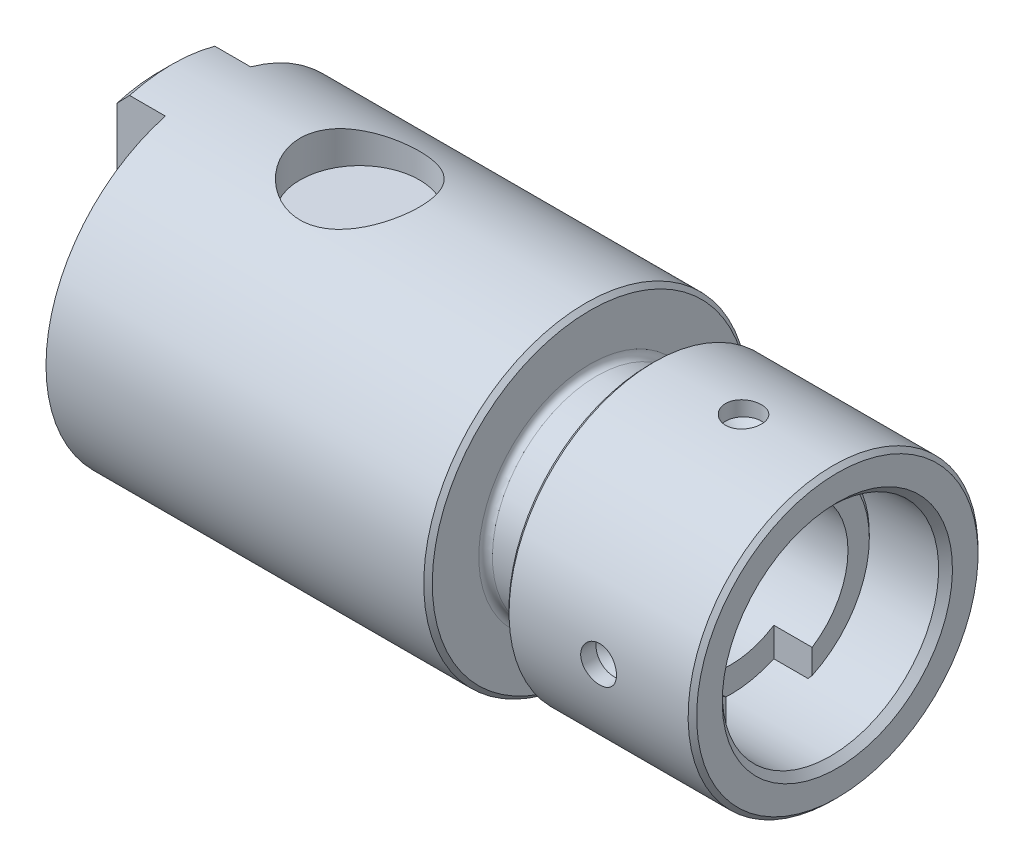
ISO-10303-21;
HEADER;
FILE_DESCRIPTION(('STEP AP214'),'2;1');
FILE_NAME('part.step','',(''),(''),'','','');
FILE_SCHEMA(('AUTOMOTIVE_DESIGN { 1 0 10303 214 1 1 1 1 }'));
ENDSEC;
DATA;
#1=APPLICATION_CONTEXT('core data for automotive mechanical design processes');
#2=APPLICATION_PROTOCOL_DEFINITION('international standard','automotive_design',2000,#1);
#3=PRODUCT_CONTEXT('',#1,'mechanical');
#4=PRODUCT('Part','Part','',(#3));
#5=PRODUCT_RELATED_PRODUCT_CATEGORY('part','',(#4));
#6=PRODUCT_DEFINITION_FORMATION('','',#4);
#7=PRODUCT_DEFINITION_CONTEXT('part definition',#1,'design');
#8=PRODUCT_DEFINITION('design','',#6,#7);
#9=PRODUCT_DEFINITION_SHAPE('','',#8);
#10=(LENGTH_UNIT() NAMED_UNIT(*) SI_UNIT(.MILLI.,.METRE.));
#11=(NAMED_UNIT(*) PLANE_ANGLE_UNIT() SI_UNIT($,.RADIAN.));
#12=(NAMED_UNIT(*) SI_UNIT($,.STERADIAN.) SOLID_ANGLE_UNIT());
#13=UNCERTAINTY_MEASURE_WITH_UNIT(LENGTH_MEASURE(1.E-05),#10,'distance_accuracy_value','');
#14=(GEOMETRIC_REPRESENTATION_CONTEXT(3) GLOBAL_UNCERTAINTY_ASSIGNED_CONTEXT((#13)) GLOBAL_UNIT_ASSIGNED_CONTEXT((#10,
#11,#12)) REPRESENTATION_CONTEXT('',''));
#15=CARTESIAN_POINT('',(0.,0.,0.));
#16=DIRECTION('',(0.,0.,1.));
#17=DIRECTION('',(1.,0.,0.));
#18=AXIS2_PLACEMENT_3D('',#15,#16,#17);
#19=CARTESIAN_POINT('',(56.,0.,0.));
#20=DIRECTION('',(1.,0.,0.));
#21=DIRECTION('',(0.,1.,0.));
#22=AXIS2_PLACEMENT_3D('',#19,#20,#21);
#23=CYLINDRICAL_SURFACE('',#22,17.);
#24=CARTESIAN_POINT('',(34.5,0.,0.));
#25=DIRECTION('',(1.,0.,0.));
#26=DIRECTION('',(0.,1.,0.));
#27=AXIS2_PLACEMENT_3D('',#24,#25,#26);
#28=CIRCLE('',#27,17.);
#29=CARTESIAN_POINT('',(34.5,17.,0.));
#30=VERTEX_POINT('',#29);
#31=EDGE_CURVE('E188',#30,#30,#28,.T.);
#32=ORIENTED_EDGE('',*,*,#31,.T.);
#33=EDGE_LOOP('',(#32));
#34=FACE_BOUND('',#33,.T.);
#35=CARTESIAN_POINT('',(45.,-2.1,16.8697954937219));
#36=CARTESIAN_POINT('',(44.8825259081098,-2.09999499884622,16.8697971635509));
#37=CARTESIAN_POINT('',(44.7649781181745,-2.0901094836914,16.8710358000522));
#38=CARTESIAN_POINT('',(44.5331531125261,-2.05083005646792,16.8758547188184));
#39=CARTESIAN_POINT('',(44.4188794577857,-2.02141568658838,16.8794374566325));
#40=CARTESIAN_POINT('',(44.196992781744,-1.94395823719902,16.8885327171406));
#41=CARTESIAN_POINT('',(44.0893753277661,-1.89592771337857,16.894043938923));
#42=CARTESIAN_POINT('',(43.8837484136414,-1.78262806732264,16.9063736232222));
#43=CARTESIAN_POINT('',(43.7857372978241,-1.71736192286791,16.9131918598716));
#44=CARTESIAN_POINT('',(43.6015489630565,-1.57106129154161,16.927409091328));
#45=CARTESIAN_POINT('',(43.5154318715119,-1.48995135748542,16.9348107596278));
#46=CARTESIAN_POINT('',(43.3579954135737,-1.31442790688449,16.9493368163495));
#47=CARTESIAN_POINT('',(43.2866767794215,-1.22001373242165,16.9564611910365));
#48=CARTESIAN_POINT('',(43.1606464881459,-1.02018451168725,16.9696572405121));
#49=CARTESIAN_POINT('',(43.1059891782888,-0.914734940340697,16.9757254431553));
#50=CARTESIAN_POINT('',(43.0151811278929,-0.69606616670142,16.9860960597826));
#51=CARTESIAN_POINT('',(42.9790297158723,-0.582847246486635,16.9903985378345));
#52=CARTESIAN_POINT('',(42.9264391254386,-0.352468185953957,16.9967341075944));
#53=CARTESIAN_POINT('',(42.9099000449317,-0.235331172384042,16.9987786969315));
#54=CARTESIAN_POINT('',(42.8966940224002,7.24128411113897E-05,17.0004073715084));
#55=CARTESIAN_POINT('',(42.9000263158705,0.118338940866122,16.9999915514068));
#56=CARTESIAN_POINT('',(42.9263883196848,0.351964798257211,16.9967555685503));
#57=CARTESIAN_POINT('',(42.9493105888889,0.467336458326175,16.9939485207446));
#58=CARTESIAN_POINT('',(43.0140339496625,0.692582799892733,16.9862602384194));
#59=CARTESIAN_POINT('',(43.0558353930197,0.802457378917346,16.9813789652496));
#60=CARTESIAN_POINT('',(43.1572449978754,1.01392363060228,16.9700681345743));
#61=CARTESIAN_POINT('',(43.2168997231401,1.11549274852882,16.9636345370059));
#62=CARTESIAN_POINT('',(43.3522886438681,1.30721886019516,16.9499389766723));
#63=CARTESIAN_POINT('',(43.428023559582,1.39737534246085,16.9426769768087));
#64=CARTESIAN_POINT('',(43.5940249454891,1.56434805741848,16.928080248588));
#65=CARTESIAN_POINT('',(43.6843850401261,1.64107122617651,16.9207453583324));
#66=CARTESIAN_POINT('',(43.8767499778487,1.77827631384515,16.9068774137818));
#67=CARTESIAN_POINT('',(43.9787548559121,1.83875818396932,16.9003443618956));
#68=CARTESIAN_POINT('',(44.1915960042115,1.94176876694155,16.8888198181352));
#69=CARTESIAN_POINT('',(44.3024358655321,1.98429013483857,16.8838289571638));
#70=CARTESIAN_POINT('',(44.5297580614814,2.05009073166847,16.8759662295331));
#71=CARTESIAN_POINT('',(44.6462401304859,2.07337086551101,16.8730942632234));
#72=CARTESIAN_POINT('',(44.8807186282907,2.09990513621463,16.8698126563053));
#73=CARTESIAN_POINT('',(44.9987000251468,2.10329019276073,16.8693869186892));
#74=CARTESIAN_POINT('',(45.2335482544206,2.09028355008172,16.8710034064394));
#75=CARTESIAN_POINT('',(45.3504151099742,2.07389226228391,16.8730455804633));
#76=CARTESIAN_POINT('',(45.5793251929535,2.02190840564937,16.8793531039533));
#77=CARTESIAN_POINT('',(45.6913830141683,1.98637913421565,16.8836111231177));
#78=CARTESIAN_POINT('',(45.9079504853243,1.89719297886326,16.8938646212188));
#79=CARTESIAN_POINT('',(46.0124598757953,1.84353547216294,16.8998601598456));
#80=CARTESIAN_POINT('',(46.21155645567,1.71929370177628,16.9129517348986));
#81=CARTESIAN_POINT('',(46.3060896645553,1.64862352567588,16.9200532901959));
#82=CARTESIAN_POINT('',(46.481999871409,1.49248404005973,16.9345393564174));
#83=CARTESIAN_POINT('',(46.5633763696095,1.40701416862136,16.9419238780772));
#84=CARTESIAN_POINT('',(46.7111225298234,1.2231298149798,16.9561932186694));
#85=CARTESIAN_POINT('',(46.7774062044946,1.12464597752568,16.9630750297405));
#86=CARTESIAN_POINT('',(46.8924904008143,0.917866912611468,16.9755186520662));
#87=CARTESIAN_POINT('',(46.9412912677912,0.809571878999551,16.9810804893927));
#88=CARTESIAN_POINT('',(47.0198823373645,0.586531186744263,16.9902441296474));
#89=CARTESIAN_POINT('',(47.0497223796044,0.47180330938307,16.993851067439));
#90=CARTESIAN_POINT('',(47.089706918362,0.238918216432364,16.9987198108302));
#91=CARTESIAN_POINT('',(47.0998522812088,0.120761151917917,16.9999817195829));
#92=CARTESIAN_POINT('',(47.1001435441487,-0.11478834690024,17.0000177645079));
#93=CARTESIAN_POINT('',(47.0904220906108,-0.232180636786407,16.9988084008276));
#94=CARTESIAN_POINT('',(47.0515364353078,-0.4636494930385,16.9940705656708));
#95=CARTESIAN_POINT('',(47.0223722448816,-0.577726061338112,16.9905420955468));
#96=CARTESIAN_POINT('',(46.9454703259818,-0.799308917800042,16.9815607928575));
#97=CARTESIAN_POINT('',(46.8977387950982,-0.906817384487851,16.9761086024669));
#98=CARTESIAN_POINT('',(46.7850708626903,-1.11231931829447,16.9638838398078));
#99=CARTESIAN_POINT('',(46.7201342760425,-1.21031268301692,16.9571112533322));
#100=CARTESIAN_POINT('',(46.5744082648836,-1.39468060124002,16.9429478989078));
#101=CARTESIAN_POINT('',(46.4935201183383,-1.48097684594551,16.9355534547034));
#102=CARTESIAN_POINT('',(46.318391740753,-1.63882309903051,16.921009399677));
#103=CARTESIAN_POINT('',(46.224148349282,-1.71036960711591,16.9138598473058));
#104=CARTESIAN_POINT('',(46.0245778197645,-1.83691538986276,16.9005863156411));
#105=CARTESIAN_POINT('',(45.9192102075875,-1.89185121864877,16.8944663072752));
#106=CARTESIAN_POINT('',(45.7007290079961,-1.9831709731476,16.883991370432));
#107=CARTESIAN_POINT('',(45.5876240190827,-2.01957512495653,16.8796345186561));
#108=CARTESIAN_POINT('',(45.3949416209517,-2.0640590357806,16.8742397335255));
#109=CARTESIAN_POINT('',(45.3165807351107,-2.07751757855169,16.8725814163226));
#110=CARTESIAN_POINT('',(45.1588244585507,-2.09548971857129,16.8703587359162));
#111=CARTESIAN_POINT('',(45.0794290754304,-2.1000033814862,16.8697943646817));
#112=CARTESIAN_POINT('',(45.,-2.1,16.8697954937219));
#113=B_SPLINE_CURVE_WITH_KNOTS('',3,(#35,#36,#37,#38,#39,#40,#41,#42,#43,#44,#45,#46,#47,#48,
#49,#50,#51,#52,#53,#54,#55,#56,#57,#58,#59,#60,#61,#62,#63,#64,#65,#66,#67,#68,#69,#70,#71,#72,
#73,#74,#75,#76,#77,#78,#79,#80,#81,#82,#83,#84,#85,#86,#87,#88,#89,#90,#91,#92,#93,#94,#95,#96,
#97,#98,#99,#100,#101,#102,#103,#104,#105,#106,#107,#108,#109,#110,#111,#112),.UNSPECIFIED.,.T.,
.F.,(4,2,2,2,2,2,2,2,2,2,2,2,2,2,2,2,2,2,2,2,2,2,2,2,2,2,2,2,2,2,2,2,2,2,2,2,2,2,4),(0.,
0.352132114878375,0.704633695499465,1.05689794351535,1.40910137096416,1.76302476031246,
2.11696565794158,2.47204901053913,2.82711947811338,3.18037339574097,3.53361372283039,
3.88492904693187,4.23625091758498,4.58849718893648,4.94075924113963,5.29537266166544,
5.64998714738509,6.00474651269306,6.35948919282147,6.71189484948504,7.06429317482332,
7.41553306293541,7.76678501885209,8.11984941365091,8.47292721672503,8.82796888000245,
9.183003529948,9.53710104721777,9.89118298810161,10.2429085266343,10.5946338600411,
10.9462418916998,11.2978537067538,11.6517140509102,12.0056582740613,12.3609378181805,
12.7158287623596,12.95392154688,13.1920125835),.UNSPECIFIED.);
#114=CARTESIAN_POINT('',(45.,-2.1,16.8697954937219));
#115=VERTEX_POINT('',#114);
#116=EDGE_CURVE('E372',#115,#115,#113,.T.);
#117=ORIENTED_EDGE('',*,*,#116,.T.);
#118=EDGE_LOOP('',(#117));
#119=FACE_BOUND('',#118,.T.);
#120=CARTESIAN_POINT('',(42.9,17.,0.));
#121=CARTESIAN_POINT('',(42.9000049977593,16.9999983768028,-0.117477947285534));
#122=CARTESIAN_POINT('',(42.9098911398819,16.9987693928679,-0.235029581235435));
#123=CARTESIAN_POINT('',(42.9491732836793,16.9939849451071,-0.466862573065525));
#124=CARTESIAN_POINT('',(42.9785897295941,16.9904270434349,-0.581140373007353));
#125=CARTESIAN_POINT('',(43.0560532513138,16.9813856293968,-0.803035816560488));
#126=CARTESIAN_POINT('',(43.1040878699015,16.9759034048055,-0.91065785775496));
#127=CARTESIAN_POINT('',(43.2173971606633,16.9636232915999,-1.11629246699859));
#128=CARTESIAN_POINT('',(43.2826688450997,16.9568256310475,-1.21430669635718));
#129=CARTESIAN_POINT('',(43.4289750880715,16.9426328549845,-1.39849155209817));
#130=CARTESIAN_POINT('',(43.5100838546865,16.9352350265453,-1.48460302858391));
#131=CARTESIAN_POINT('',(43.685602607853,16.9206976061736,-1.64202863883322));
#132=CARTESIAN_POINT('',(43.7800132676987,16.9135580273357,-1.71334202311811));
#133=CARTESIAN_POINT('',(43.9798393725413,16.9003187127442,-1.83936679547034));
#134=CARTESIAN_POINT('',(44.0852899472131,16.8942224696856,-1.89402288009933));
#135=CARTESIAN_POINT('',(44.3039609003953,16.8837957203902,-1.98482838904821));
#136=CARTESIAN_POINT('',(44.4171809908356,16.8794651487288,-2.02097849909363));
#137=CARTESIAN_POINT('',(44.6475637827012,16.8730858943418,-2.07356641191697));
#138=CARTESIAN_POINT('',(44.7647033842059,16.8710256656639,-2.09010398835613));
#139=CARTESIAN_POINT('',(45.000112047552,16.8693849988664,-2.10330610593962));
#140=CARTESIAN_POINT('',(45.1183810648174,16.8698044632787,-2.09997142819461));
#141=CARTESIAN_POINT('',(45.3519964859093,16.8730652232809,-2.07360562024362));
#142=CARTESIAN_POINT('',(45.4673555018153,16.875893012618,-2.05068433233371));
#143=CARTESIAN_POINT('',(45.6925770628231,16.8836307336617,-1.98596730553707));
#144=CARTESIAN_POINT('',(45.8024394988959,16.8885407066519,-1.94417119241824));
#145=CARTESIAN_POINT('',(46.0138909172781,16.8999048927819,-1.84277268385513));
#146=CARTESIAN_POINT('',(46.1154567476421,16.9063632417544,-1.78312249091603));
#147=CARTESIAN_POINT('',(46.3071782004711,16.9200932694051,-1.64774327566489));
#148=CARTESIAN_POINT('',(46.3973333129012,16.9273649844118,-1.57201353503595));
#149=CARTESIAN_POINT('',(46.5643117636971,16.9419624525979,-1.4060158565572));
#150=CARTESIAN_POINT('',(46.6410409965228,16.9492882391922,-1.31565322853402));
#151=CARTESIAN_POINT('',(46.7782571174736,16.9631224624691,-1.12328104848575));
#152=CARTESIAN_POINT('',(46.8387439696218,16.9696308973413,-1.02127147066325));
#153=CARTESIAN_POINT('',(46.9417581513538,16.98110099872,-0.808428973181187));
#154=CARTESIAN_POINT('',(46.9842796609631,16.9860621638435,-0.697593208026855));
#155=CARTESIAN_POINT('',(47.050081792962,16.9938741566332,-0.470279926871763));
#156=CARTESIAN_POINT('',(47.0733632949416,16.9967250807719,-0.353802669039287));
#157=CARTESIAN_POINT('',(47.099902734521,16.9999828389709,-0.119326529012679));
#158=CARTESIAN_POINT('',(47.1032903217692,17.0004054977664,-0.00134253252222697));
#159=CARTESIAN_POINT('',(47.090287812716,16.9988018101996,0.233511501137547));
#160=CARTESIAN_POINT('',(47.0738981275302,16.9967755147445,0.350381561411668));
#161=CARTESIAN_POINT('',(47.0219140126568,16.9905114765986,0.579308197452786));
#162=CARTESIAN_POINT('',(46.9863813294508,16.9862808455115,0.691379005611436));
#163=CARTESIAN_POINT('',(46.8971840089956,16.9760818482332,0.90797094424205));
#164=CARTESIAN_POINT('',(46.8435187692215,16.9701134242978,1.01249182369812));
#165=CARTESIAN_POINT('',(46.7192655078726,16.957064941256,1.21159642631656));
#166=CARTESIAN_POINT('',(46.6485935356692,16.9499794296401,1.30612739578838));
#167=CARTESIAN_POINT('',(46.4924517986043,16.9355066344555,1.48203224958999));
#168=CARTESIAN_POINT('',(46.406981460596,16.9281193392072,1.56340562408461));
#169=CARTESIAN_POINT('',(46.2230984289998,16.9138268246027,1.71114475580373));
#170=CARTESIAN_POINT('',(46.1246164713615,16.9069245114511,1.77742462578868));
#171=CARTESIAN_POINT('',(45.9178422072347,16.894431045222,1.89250215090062));
#172=CARTESIAN_POINT('',(45.8095500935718,16.8888398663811,1.94130014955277));
#173=CARTESIAN_POINT('',(45.5865077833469,16.8796214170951,2.01988938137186));
#174=CARTESIAN_POINT('',(45.4717749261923,16.875989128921,2.0497292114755));
#175=CARTESIAN_POINT('',(45.2388793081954,16.8710852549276,2.08971163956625));
#176=CARTESIAN_POINT('',(45.12071670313,16.8698135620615,2.09985513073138));
#177=CARTESIAN_POINT('',(44.8851702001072,16.869777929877,2.10014081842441));
#178=CARTESIAN_POINT('',(44.7677864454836,16.8709970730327,2.09041794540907));
#179=CARTESIAN_POINT('',(44.5363350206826,16.8757693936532,2.05153244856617));
#180=CARTESIAN_POINT('',(44.4222673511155,16.8793225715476,2.02236982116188));
#181=CARTESIAN_POINT('',(44.2007027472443,16.8883574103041,1.94547451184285));
#182=CARTESIAN_POINT('',(44.0932035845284,16.8938384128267,1.89774816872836));
#183=CARTESIAN_POINT('',(43.8877181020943,16.9061124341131,1.78509350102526));
#184=CARTESIAN_POINT('',(43.7897318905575,16.9129054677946,1.72016498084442));
#185=CARTESIAN_POINT('',(43.6053638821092,16.9270934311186,1.57444797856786));
#186=CARTESIAN_POINT('',(43.5190618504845,16.9344919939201,1.49355892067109));
#187=CARTESIAN_POINT('',(43.3612043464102,16.9490252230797,1.31842632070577));
#188=CARTESIAN_POINT('',(43.2896523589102,16.9561598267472,1.2241796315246));
#189=CARTESIAN_POINT('',(43.1631005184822,16.9693904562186,1.02460628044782));
#190=CARTESIAN_POINT('',(43.1081631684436,16.9754825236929,0.919239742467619));
#191=CARTESIAN_POINT('',(43.0168402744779,16.9859014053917,0.700760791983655));
#192=CARTESIAN_POINT('',(42.9804345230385,16.9902301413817,0.587656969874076));
#193=CARTESIAN_POINT('',(42.9359462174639,16.9955882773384,0.394970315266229));
#194=CARTESIAN_POINT('',(42.9224856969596,16.9972346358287,0.316603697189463));
#195=CARTESIAN_POINT('',(42.9045109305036,16.9994410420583,0.158835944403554));
#196=CARTESIAN_POINT('',(42.8999966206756,17.0000010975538,0.0794348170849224));
#197=CARTESIAN_POINT('',(42.9,17.,0.));
#198=B_SPLINE_CURVE_WITH_KNOTS('',3,(#120,#121,#122,#123,#124,#125,#126,#127,#128,#129,#130,
#131,#132,#133,#134,#135,#136,#137,#138,#139,#140,#141,#142,#143,#144,#145,#146,#147,#148,#149,
#150,#151,#152,#153,#154,#155,#156,#157,#158,#159,#160,#161,#162,#163,#164,#165,#166,#167,#168,
#169,#170,#171,#172,#173,#174,#175,#176,#177,#178,#179,#180,#181,#182,#183,#184,#185,#186,#187,
#188,#189,#190,#191,#192,#193,#194,#195,#196,#197),.UNSPECIFIED.,.T.,.F.,(4,2,2,2,2,2,2,2,2,2,2,
2,2,2,2,2,2,2,2,2,2,2,2,2,2,2,2,2,2,2,2,2,2,2,2,2,2,2,4),(0.,0.352143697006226,
0.704656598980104,1.05693404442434,1.40915046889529,1.76305869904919,2.11698484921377,
2.47207357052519,2.827149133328,3.18041048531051,3.53365795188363,3.88493730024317,
4.23622361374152,4.58845890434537,4.94070993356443,5.29533885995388,5.64996857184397,
6.00471308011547,6.3594413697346,6.71185528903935,7.06426188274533,7.41553852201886,
7.76682683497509,8.11988613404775,8.47295911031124,8.82799360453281,9.18302112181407,
9.53713485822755,9.89123253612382,10.2429332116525,10.5946339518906,10.9462147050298,
11.2977994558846,11.6516748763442,12.0056338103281,12.3609082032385,12.7157943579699,
12.953904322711,13.1920125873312),.UNSPECIFIED.);
#199=CARTESIAN_POINT('',(42.9,17.,0.));
#200=VERTEX_POINT('',#199);
#201=EDGE_CURVE('E365',#200,#200,#198,.T.);
#202=ORIENTED_EDGE('',*,*,#201,.T.);
#203=EDGE_LOOP('',(#202));
#204=FACE_BOUND('',#203,.T.);
#205=CARTESIAN_POINT('',(55.5,0.,0.));
#206=DIRECTION('',(1.,0.,0.));
#207=DIRECTION('',(0.,1.,0.));
#208=AXIS2_PLACEMENT_3D('',#205,#206,#207);
#209=CIRCLE('',#208,17.);
#210=CARTESIAN_POINT('',(55.5,17.,0.));
#211=VERTEX_POINT('',#210);
#212=EDGE_CURVE('E191',#211,#211,#209,.T.);
#213=ORIENTED_EDGE('',*,*,#212,.F.);
#214=EDGE_LOOP('',(#213));
#215=FACE_BOUND('',#214,.T.);
#216=CARTESIAN_POINT('',(45.,-2.1,-16.8697954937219));
#217=CARTESIAN_POINT('',(45.1174740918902,-2.09999499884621,-16.8697971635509));
#218=CARTESIAN_POINT('',(45.2350218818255,-2.0901094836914,-16.8710358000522));
#219=CARTESIAN_POINT('',(45.4668468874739,-2.05083005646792,-16.8758547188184));
#220=CARTESIAN_POINT('',(45.5811205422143,-2.02141568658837,-16.8794374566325));
#221=CARTESIAN_POINT('',(45.803007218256,-1.94395823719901,-16.8885327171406));
#222=CARTESIAN_POINT('',(45.9106246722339,-1.89592771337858,-16.894043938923));
#223=CARTESIAN_POINT('',(46.1162515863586,-1.78262806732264,-16.9063736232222));
#224=CARTESIAN_POINT('',(46.2142627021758,-1.7173619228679,-16.9131918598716));
#225=CARTESIAN_POINT('',(46.3984510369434,-1.5710612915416,-16.927409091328));
#226=CARTESIAN_POINT('',(46.4845681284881,-1.48995135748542,-16.9348107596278));
#227=CARTESIAN_POINT('',(46.6420045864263,-1.3144279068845,-16.9493368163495));
#228=CARTESIAN_POINT('',(46.7133232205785,-1.22001373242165,-16.9564611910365));
#229=CARTESIAN_POINT('',(46.8393535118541,-1.02018451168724,-16.9696572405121));
#230=CARTESIAN_POINT('',(46.8940108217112,-0.914734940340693,-16.9757254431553));
#231=CARTESIAN_POINT('',(46.984818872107,-0.696066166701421,-16.9860960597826));
#232=CARTESIAN_POINT('',(47.0209702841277,-0.582847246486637,-16.9903985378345));
#233=CARTESIAN_POINT('',(47.0735608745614,-0.352468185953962,-16.9967341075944));
#234=CARTESIAN_POINT('',(47.0900999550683,-0.235331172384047,-16.9987786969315));
#235=CARTESIAN_POINT('',(47.1033059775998,7.24128411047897E-05,-17.0004073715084));
#236=CARTESIAN_POINT('',(47.0999736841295,0.118338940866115,-16.9999915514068));
#237=CARTESIAN_POINT('',(47.0736116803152,0.351964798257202,-16.9967555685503));
#238=CARTESIAN_POINT('',(47.0506894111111,0.467336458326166,-16.9939485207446));
#239=CARTESIAN_POINT('',(46.9859660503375,0.692582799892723,-16.9862602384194));
#240=CARTESIAN_POINT('',(46.9441646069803,0.802457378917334,-16.9813789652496));
#241=CARTESIAN_POINT('',(46.8427550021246,1.01392363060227,-16.9700681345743));
#242=CARTESIAN_POINT('',(46.7831002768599,1.11549274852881,-16.9636345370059));
#243=CARTESIAN_POINT('',(46.6477113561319,1.30721886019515,-16.9499389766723));
#244=CARTESIAN_POINT('',(46.571976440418,1.39737534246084,-16.9426769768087));
#245=CARTESIAN_POINT('',(46.4059750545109,1.56434805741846,-16.928080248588));
#246=CARTESIAN_POINT('',(46.3156149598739,1.64107122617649,-16.9207453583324));
#247=CARTESIAN_POINT('',(46.1232500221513,1.77827631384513,-16.9068774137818));
#248=CARTESIAN_POINT('',(46.0212451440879,1.83875818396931,-16.9003443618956));
#249=CARTESIAN_POINT('',(45.8084039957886,1.94176876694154,-16.8888198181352));
#250=CARTESIAN_POINT('',(45.697564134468,1.98429013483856,-16.8838289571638));
#251=CARTESIAN_POINT('',(45.4702419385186,2.05009073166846,-16.8759662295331));
#252=CARTESIAN_POINT('',(45.3537598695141,2.07337086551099,-16.8730942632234));
#253=CARTESIAN_POINT('',(45.1192813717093,2.09990513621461,-16.8698126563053));
#254=CARTESIAN_POINT('',(45.0012999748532,2.10329019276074,-16.8693869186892));
#255=CARTESIAN_POINT('',(44.7664517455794,2.09028355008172,-16.8710034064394));
#256=CARTESIAN_POINT('',(44.6495848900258,2.07389226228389,-16.8730455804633));
#257=CARTESIAN_POINT('',(44.4206748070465,2.02190840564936,-16.8793531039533));
#258=CARTESIAN_POINT('',(44.3086169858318,1.98637913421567,-16.8836111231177));
#259=CARTESIAN_POINT('',(44.0920495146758,1.89719297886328,-16.8938646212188));
#260=CARTESIAN_POINT('',(43.9875401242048,1.84353547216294,-16.8998601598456));
#261=CARTESIAN_POINT('',(43.7884435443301,1.71929370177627,-16.9129517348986));
#262=CARTESIAN_POINT('',(43.6939103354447,1.64862352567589,-16.9200532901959));
#263=CARTESIAN_POINT('',(43.518000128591,1.49248404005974,-16.9345393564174));
#264=CARTESIAN_POINT('',(43.4366236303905,1.40701416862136,-16.9419238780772));
#265=CARTESIAN_POINT('',(43.2888774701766,1.2231298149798,-16.9561932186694));
#266=CARTESIAN_POINT('',(43.2225937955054,1.12464597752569,-16.9630750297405));
#267=CARTESIAN_POINT('',(43.1075095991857,0.917866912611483,-16.9755186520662));
#268=CARTESIAN_POINT('',(43.0587087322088,0.809571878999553,-16.9810804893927));
#269=CARTESIAN_POINT('',(42.9801176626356,0.58653118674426,-16.9902441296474));
#270=CARTESIAN_POINT('',(42.9502776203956,0.471803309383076,-16.993851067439));
#271=CARTESIAN_POINT('',(42.910293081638,0.238918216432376,-16.9987198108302));
#272=CARTESIAN_POINT('',(42.9001477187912,0.120761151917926,-16.9999817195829));
#273=CARTESIAN_POINT('',(42.8998564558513,-0.114788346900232,-17.0000177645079));
#274=CARTESIAN_POINT('',(42.9095779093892,-0.232180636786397,-16.9988084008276));
#275=CARTESIAN_POINT('',(42.9484635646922,-0.463649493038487,-16.9940705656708));
#276=CARTESIAN_POINT('',(42.9776277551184,-0.577726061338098,-16.9905420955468));
#277=CARTESIAN_POINT('',(43.0545296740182,-0.799308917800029,-16.9815607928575));
#278=CARTESIAN_POINT('',(43.1022612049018,-0.90681738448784,-16.9761086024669));
#279=CARTESIAN_POINT('',(43.2149291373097,-1.11231931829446,-16.9638838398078));
#280=CARTESIAN_POINT('',(43.2798657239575,-1.2103126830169,-16.9571112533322));
#281=CARTESIAN_POINT('',(43.4255917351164,-1.39468060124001,-16.9429478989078));
#282=CARTESIAN_POINT('',(43.5064798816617,-1.48097684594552,-16.9355534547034));
#283=CARTESIAN_POINT('',(43.681608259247,-1.63882309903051,-16.921009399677));
#284=CARTESIAN_POINT('',(43.775851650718,-1.71036960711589,-16.9138598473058));
#285=CARTESIAN_POINT('',(43.9754221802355,-1.83691538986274,-16.9005863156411));
#286=CARTESIAN_POINT('',(44.0807897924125,-1.89185121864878,-16.8944663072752));
#287=CARTESIAN_POINT('',(44.2992709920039,-1.98317097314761,-16.883991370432));
#288=CARTESIAN_POINT('',(44.4123759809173,-2.01957512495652,-16.8796345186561));
#289=CARTESIAN_POINT('',(44.6050583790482,-2.06405903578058,-16.8742397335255));
#290=CARTESIAN_POINT('',(44.6834192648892,-2.07751757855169,-16.8725814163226));
#291=CARTESIAN_POINT('',(44.8411755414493,-2.09548971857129,-16.8703587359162));
#292=CARTESIAN_POINT('',(44.9205709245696,-2.10000338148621,-16.8697943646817));
#293=CARTESIAN_POINT('',(45.,-2.1,-16.8697954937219));
#294=B_SPLINE_CURVE_WITH_KNOTS('',3,(#216,#217,#218,#219,#220,#221,#222,#223,#224,#225,#226,
#227,#228,#229,#230,#231,#232,#233,#234,#235,#236,#237,#238,#239,#240,#241,#242,#243,#244,#245,
#246,#247,#248,#249,#250,#251,#252,#253,#254,#255,#256,#257,#258,#259,#260,#261,#262,#263,#264,
#265,#266,#267,#268,#269,#270,#271,#272,#273,#274,#275,#276,#277,#278,#279,#280,#281,#282,#283,
#284,#285,#286,#287,#288,#289,#290,#291,#292,#293),.UNSPECIFIED.,.T.,.F.,(4,2,2,2,2,2,2,2,2,2,2,
2,2,2,2,2,2,2,2,2,2,2,2,2,2,2,2,2,2,2,2,2,2,2,2,2,2,2,4),(0.,0.352132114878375,
0.704633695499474,1.05689794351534,1.40910137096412,1.76302476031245,2.11696565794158,
2.47204901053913,2.82711947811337,3.18037339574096,3.53361372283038,3.88492904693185,
4.23625091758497,4.58849718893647,4.94075924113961,5.29537266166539,5.64998714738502,
6.00474651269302,6.35948919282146,6.711894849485,7.06429317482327,7.41553306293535,
7.76678501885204,8.11984941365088,8.47292721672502,8.82796888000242,9.18300352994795,
9.53710104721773,9.89118298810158,10.2429085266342,10.5946338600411,10.9462418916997,
11.2978537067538,11.6517140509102,12.0056582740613,12.3609378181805,12.7158287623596,
12.9539215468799,13.1920125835),.UNSPECIFIED.);
#295=CARTESIAN_POINT('',(45.,-2.1,-16.8697954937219));
#296=VERTEX_POINT('',#295);
#297=EDGE_CURVE('E27',#296,#296,#294,.T.);
#298=ORIENTED_EDGE('',*,*,#297,.T.);
#299=EDGE_LOOP('',(#298));
#300=FACE_BOUND('',#299,.T.);
#301=CARTESIAN_POINT('',(42.9,-17.,0.));
#302=CARTESIAN_POINT('',(42.9000049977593,-16.9999983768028,0.117477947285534));
#303=CARTESIAN_POINT('',(42.9098911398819,-16.9987693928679,0.235029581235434));
#304=CARTESIAN_POINT('',(42.9491732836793,-16.9939849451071,0.466862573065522));
#305=CARTESIAN_POINT('',(42.9785897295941,-16.9904270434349,0.58114037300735));
#306=CARTESIAN_POINT('',(43.0560532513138,-16.9813856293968,0.803035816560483));
#307=CARTESIAN_POINT('',(43.1040878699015,-16.9759034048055,0.910657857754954));
#308=CARTESIAN_POINT('',(43.2173971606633,-16.9636232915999,1.11629246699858));
#309=CARTESIAN_POINT('',(43.2826688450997,-16.9568256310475,1.21430669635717));
#310=CARTESIAN_POINT('',(43.4289750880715,-16.9426328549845,1.39849155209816));
#311=CARTESIAN_POINT('',(43.5100838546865,-16.9352350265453,1.48460302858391));
#312=CARTESIAN_POINT('',(43.685602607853,-16.9206976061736,1.64202863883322));
#313=CARTESIAN_POINT('',(43.7800132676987,-16.9135580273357,1.7133420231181));
#314=CARTESIAN_POINT('',(43.9798393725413,-16.9003187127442,1.83936679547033));
#315=CARTESIAN_POINT('',(44.0852899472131,-16.8942224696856,1.89402288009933));
#316=CARTESIAN_POINT('',(44.3039609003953,-16.8837957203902,1.98482838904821));
#317=CARTESIAN_POINT('',(44.4171809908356,-16.8794651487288,2.02097849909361));
#318=CARTESIAN_POINT('',(44.6475637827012,-16.8730858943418,2.07356641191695));
#319=CARTESIAN_POINT('',(44.7647033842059,-16.8710256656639,2.09010398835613));
#320=CARTESIAN_POINT('',(45.000112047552,-16.8693849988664,2.10330610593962));
#321=CARTESIAN_POINT('',(45.1183810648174,-16.8698044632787,2.09997142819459));
#322=CARTESIAN_POINT('',(45.3519964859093,-16.8730652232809,2.0736056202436));
#323=CARTESIAN_POINT('',(45.4673555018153,-16.875893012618,2.05068433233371));
#324=CARTESIAN_POINT('',(45.6925770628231,-16.8836307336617,1.98596730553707));
#325=CARTESIAN_POINT('',(45.8024394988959,-16.8885407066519,1.94417119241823));
#326=CARTESIAN_POINT('',(46.0138909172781,-16.8999048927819,1.84277268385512));
#327=CARTESIAN_POINT('',(46.1154567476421,-16.9063632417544,1.78312249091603));
#328=CARTESIAN_POINT('',(46.3071782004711,-16.9200932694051,1.64774327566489));
#329=CARTESIAN_POINT('',(46.3973333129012,-16.9273649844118,1.57201353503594));
#330=CARTESIAN_POINT('',(46.5643117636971,-16.9419624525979,1.40601585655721));
#331=CARTESIAN_POINT('',(46.6410409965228,-16.9492882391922,1.31565322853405));
#332=CARTESIAN_POINT('',(46.7782571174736,-16.9631224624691,1.12328104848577));
#333=CARTESIAN_POINT('',(46.8387439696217,-16.9696308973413,1.02127147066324));
#334=CARTESIAN_POINT('',(46.9417581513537,-16.98110099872,0.808428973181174));
#335=CARTESIAN_POINT('',(46.9842796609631,-16.9860621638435,0.697593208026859));
#336=CARTESIAN_POINT('',(47.050081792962,-16.9938741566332,0.470279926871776));
#337=CARTESIAN_POINT('',(47.0733632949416,-16.9967250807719,0.353802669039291));
#338=CARTESIAN_POINT('',(47.099902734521,-16.9999828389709,0.119326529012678));
#339=CARTESIAN_POINT('',(47.1032903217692,-17.0004054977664,0.00134253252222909));
#340=CARTESIAN_POINT('',(47.090287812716,-16.9988018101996,-0.233511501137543));
#341=CARTESIAN_POINT('',(47.0738981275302,-16.9967755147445,-0.350381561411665));
#342=CARTESIAN_POINT('',(47.0219140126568,-16.9905114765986,-0.579308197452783));
#343=CARTESIAN_POINT('',(46.9863813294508,-16.9862808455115,-0.691379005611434));
#344=CARTESIAN_POINT('',(46.8971840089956,-16.9760818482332,-0.907970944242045));
#345=CARTESIAN_POINT('',(46.8435187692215,-16.9701134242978,-1.01249182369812));
#346=CARTESIAN_POINT('',(46.7192655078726,-16.957064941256,-1.21159642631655));
#347=CARTESIAN_POINT('',(46.6485935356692,-16.9499794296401,-1.30612739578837));
#348=CARTESIAN_POINT('',(46.4924517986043,-16.9355066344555,-1.48203224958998));
#349=CARTESIAN_POINT('',(46.406981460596,-16.9281193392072,-1.56340562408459));
#350=CARTESIAN_POINT('',(46.2230984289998,-16.9138268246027,-1.71114475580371));
#351=CARTESIAN_POINT('',(46.1246164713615,-16.9069245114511,-1.77742462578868));
#352=CARTESIAN_POINT('',(45.9178422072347,-16.894431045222,-1.89250215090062));
#353=CARTESIAN_POINT('',(45.8095500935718,-16.8888398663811,-1.94130014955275));
#354=CARTESIAN_POINT('',(45.5865077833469,-16.8796214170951,-2.01988938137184));
#355=CARTESIAN_POINT('',(45.4717749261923,-16.875989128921,-2.0497292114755));
#356=CARTESIAN_POINT('',(45.2388793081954,-16.8710852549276,-2.08971163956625));
#357=CARTESIAN_POINT('',(45.12071670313,-16.8698135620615,-2.09985513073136));
#358=CARTESIAN_POINT('',(44.8851702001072,-16.869777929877,-2.1001408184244));
#359=CARTESIAN_POINT('',(44.7677864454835,-16.8709970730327,-2.09041794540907));
#360=CARTESIAN_POINT('',(44.5363350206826,-16.8757693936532,-2.05153244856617));
#361=CARTESIAN_POINT('',(44.4222673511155,-16.8793225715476,-2.02236982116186));
#362=CARTESIAN_POINT('',(44.2007027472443,-16.8883574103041,-1.94547451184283));
#363=CARTESIAN_POINT('',(44.0932035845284,-16.8938384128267,-1.89774816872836));
#364=CARTESIAN_POINT('',(43.8877181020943,-16.9061124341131,-1.78509350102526));
#365=CARTESIAN_POINT('',(43.7897318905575,-16.9129054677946,-1.72016498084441));
#366=CARTESIAN_POINT('',(43.6053638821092,-16.9270934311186,-1.57444797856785));
#367=CARTESIAN_POINT('',(43.5190618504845,-16.9344919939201,-1.49355892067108));
#368=CARTESIAN_POINT('',(43.3612043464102,-16.9490252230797,-1.31842632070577));
#369=CARTESIAN_POINT('',(43.2896523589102,-16.9561598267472,-1.22417963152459));
#370=CARTESIAN_POINT('',(43.1631005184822,-16.9693904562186,-1.02460628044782));
#371=CARTESIAN_POINT('',(43.1081631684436,-16.9754825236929,-0.919239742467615));
#372=CARTESIAN_POINT('',(43.0168402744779,-16.9859014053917,-0.700760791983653));
#373=CARTESIAN_POINT('',(42.9804345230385,-16.9902301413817,-0.587656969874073));
#374=CARTESIAN_POINT('',(42.9359462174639,-16.9955882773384,-0.394970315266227));
#375=CARTESIAN_POINT('',(42.9224856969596,-16.9972346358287,-0.316603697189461));
#376=CARTESIAN_POINT('',(42.9045109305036,-16.9994410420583,-0.158835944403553));
#377=CARTESIAN_POINT('',(42.8999966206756,-17.0000010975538,-0.079434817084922));
#378=CARTESIAN_POINT('',(42.9,-17.,0.));
#379=B_SPLINE_CURVE_WITH_KNOTS('',3,(#301,#302,#303,#304,#305,#306,#307,#308,#309,#310,#311,
#312,#313,#314,#315,#316,#317,#318,#319,#320,#321,#322,#323,#324,#325,#326,#327,#328,#329,#330,
#331,#332,#333,#334,#335,#336,#337,#338,#339,#340,#341,#342,#343,#344,#345,#346,#347,#348,#349,
#350,#351,#352,#353,#354,#355,#356,#357,#358,#359,#360,#361,#362,#363,#364,#365,#366,#367,#368,
#369,#370,#371,#372,#373,#374,#375,#376,#377,#378),.UNSPECIFIED.,.T.,.F.,(4,2,2,2,2,2,2,2,2,2,2,
2,2,2,2,2,2,2,2,2,2,2,2,2,2,2,2,2,2,2,2,2,2,2,2,2,2,2,4),(0.,0.352143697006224,0.7046565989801,
1.05693404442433,1.40915046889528,1.76305869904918,2.11698484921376,2.47207357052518,
2.82714913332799,3.1804104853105,3.53365795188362,3.88493730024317,4.23622361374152,
4.58845890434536,4.94070993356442,5.29533885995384,5.64996857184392,6.00471308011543,
6.35944136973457,6.71185528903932,7.0642618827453,7.41553852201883,7.76682683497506,
8.11988613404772,8.47295911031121,8.82799360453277,9.18302112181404,9.53713485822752,
9.89123253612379,10.2429332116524,10.5946339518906,10.9462147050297,11.2977994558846,
11.6516748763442,12.0056338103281,12.3609082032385,12.7157943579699,12.953904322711,
13.1920125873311),.UNSPECIFIED.);
#380=CARTESIAN_POINT('',(42.9,-17.,0.));
#381=VERTEX_POINT('',#380);
#382=EDGE_CURVE('E9',#381,#381,#379,.T.);
#383=ORIENTED_EDGE('',*,*,#382,.T.);
#384=EDGE_LOOP('',(#383));
#385=FACE_BOUND('',#384,.T.);
#386=ADVANCED_FACE('F14',(#34,#119,#204,#215,#300,#385),#23,.T.);
#387=CARTESIAN_POINT('',(48.,0.,0.));
#388=DIRECTION('',(1.,0.,0.));
#389=DIRECTION('',(0.,1.,0.));
#390=AXIS2_PLACEMENT_3D('',#387,#388,#389);
#391=CYLINDRICAL_SURFACE('',#390,12.25);
#392=CARTESIAN_POINT('',(47.5,0.,0.));
#393=DIRECTION('',(1.,0.,0.));
#394=DIRECTION('',(0.,1.,0.));
#395=AXIS2_PLACEMENT_3D('',#392,#393,#394);
#396=CIRCLE('',#395,12.25);
#397=CARTESIAN_POINT('',(47.5,11.160645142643,5.05));
#398=VERTEX_POINT('',#397);
#399=CARTESIAN_POINT('',(47.5,-11.160645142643,5.05));
#400=VERTEX_POINT('',#399);
#401=EDGE_CURVE('E590',#398,#400,#396,.T.);
#402=ORIENTED_EDGE('',*,*,#401,.F.);
#403=DIRECTION('',(1.,0.,0.));
#404=VECTOR('',#403,1.);
#405=CARTESIAN_POINT('',(48.,11.160645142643,5.05));
#406=LINE('',#405,#404);
#407=CARTESIAN_POINT('',(43.5,11.160645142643,5.05));
#408=VERTEX_POINT('',#407);
#409=EDGE_CURVE('E270',#408,#398,#406,.T.);
#410=ORIENTED_EDGE('',*,*,#409,.F.);
#411=CARTESIAN_POINT('',(43.5,0.,0.));
#412=DIRECTION('',(1.,0.,0.));
#413=DIRECTION('',(0.,1.,0.));
#414=AXIS2_PLACEMENT_3D('',#411,#412,#413);
#415=CIRCLE('',#414,12.25);
#416=CARTESIAN_POINT('',(43.5,11.160645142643,-5.05));
#417=VERTEX_POINT('',#416);
#418=EDGE_CURVE('E275',#417,#408,#415,.T.);
#419=ORIENTED_EDGE('',*,*,#418,.F.);
#420=DIRECTION('',(1.,0.,0.));
#421=VECTOR('',#420,1.);
#422=CARTESIAN_POINT('',(48.,11.160645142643,-5.05));
#423=LINE('',#422,#421);
#424=CARTESIAN_POINT('',(47.5,11.160645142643,-5.05));
#425=VERTEX_POINT('',#424);
#426=EDGE_CURVE('E269',#425,#417,#423,.F.);
#427=ORIENTED_EDGE('',*,*,#426,.F.);
#428=CARTESIAN_POINT('',(47.5,-11.160645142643,-5.05));
#429=VERTEX_POINT('',#428);
#430=EDGE_CURVE('E593',#429,#425,#396,.T.);
#431=ORIENTED_EDGE('',*,*,#430,.F.);
#432=DIRECTION('',(1.,0.,0.));
#433=VECTOR('',#432,1.);
#434=CARTESIAN_POINT('',(48.,-11.160645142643,-5.05));
#435=LINE('',#434,#433);
#436=CARTESIAN_POINT('',(43.5,-11.160645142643,-5.05));
#437=VERTEX_POINT('',#436);
#438=EDGE_CURVE('E273',#437,#429,#435,.T.);
#439=ORIENTED_EDGE('',*,*,#438,.F.);
#440=CARTESIAN_POINT('',(43.5,-11.160645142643,5.05));
#441=VERTEX_POINT('',#440);
#442=EDGE_CURVE('E277',#441,#437,#415,.T.);
#443=ORIENTED_EDGE('',*,*,#442,.F.);
#444=DIRECTION('',(1.,0.,0.));
#445=VECTOR('',#444,1.);
#446=CARTESIAN_POINT('',(48.,-11.160645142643,5.05));
#447=LINE('',#446,#445);
#448=EDGE_CURVE('E236',#400,#441,#447,.F.);
#449=ORIENTED_EDGE('',*,*,#448,.F.);
#450=EDGE_LOOP('',(#402,#410,#419,#427,#431,#439,#443,#449));
#451=FACE_BOUND('',#450,.T.);
#452=CARTESIAN_POINT('',(43.,0.,0.));
#453=DIRECTION('',(1.,0.,0.));
#454=DIRECTION('',(0.,1.,0.));
#455=AXIS2_PLACEMENT_3D('',#452,#453,#454);
#456=CIRCLE('',#455,12.25);
#457=CARTESIAN_POINT('',(43.,12.25,0.));
#458=VERTEX_POINT('',#457);
#459=EDGE_CURVE('E587',#458,#458,#456,.T.);
#460=ORIENTED_EDGE('',*,*,#459,.T.);
#461=EDGE_LOOP('',(#460));
#462=FACE_BOUND('',#461,.T.);
#463=ADVANCED_FACE('F347',(#451,#462),#391,.T.);
#464=CARTESIAN_POINT('',(47.5,0.,0.));
#465=DIRECTION('',(-1.,0.,0.));
#466=DIRECTION('',(0.,-1.,0.));
#467=AXIS2_PLACEMENT_3D('',#464,#465,#466);
#468=CONICAL_SURFACE('',#467,12.25,0.785398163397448);
#469=CARTESIAN_POINT('',(32.7967390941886,-26.4759470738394,-5.05));
#470=CARTESIAN_POINT('',(33.474116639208,-25.78632205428,-5.05));
#471=CARTESIAN_POINT('',(34.1510557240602,-25.0962651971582,-5.05));
#472=CARTESIAN_POINT('',(35.5045977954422,-23.7140705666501,-5.05));
#473=CARTESIAN_POINT('',(36.1811992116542,-23.0219312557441,-5.05));
#474=CARTESIAN_POINT('',(37.5480728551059,-21.6205322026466,-5.05));
#475=CARTESIAN_POINT('',(38.2383097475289,-20.9112379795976,-5.05));
#476=CARTESIAN_POINT('',(39.6157098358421,-19.4914560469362,-5.05));
#477=CARTESIAN_POINT('',(40.3028758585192,-18.7809710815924,-5.05));
#478=CARTESIAN_POINT('',(41.569764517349,-17.4655328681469,-5.05));
#479=CARTESIAN_POINT('',(42.1499108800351,-16.860988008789,-5.05));
#480=CARTESIAN_POINT('',(43.3073412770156,-15.6489901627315,-5.05));
#481=CARTESIAN_POINT('',(43.8846248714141,-15.041536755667,-5.05));
#482=CARTESIAN_POINT('',(45.0379389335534,-13.8196761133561,-5.05));
#483=CARTESIAN_POINT('',(45.6139487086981,-13.2052492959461,-5.05));
#484=CARTESIAN_POINT('',(46.4731498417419,-12.2794659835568,-5.05));
#485=CARTESIAN_POINT('',(46.7586677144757,-11.9702692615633,-5.05));
#486=CARTESIAN_POINT('',(47.3277635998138,-11.3500968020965,-5.05));
#487=CARTESIAN_POINT('',(47.6113416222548,-11.0391210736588,-5.05));
#488=CARTESIAN_POINT('',(48.1703846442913,-10.4212264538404,-5.05));
#489=CARTESIAN_POINT('',(48.4458981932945,-10.1143515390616,-5.05));
#490=CARTESIAN_POINT('',(48.9939336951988,-9.49791546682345,-5.05));
#491=CARTESIAN_POINT('',(49.2664555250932,-9.18835419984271,-5.05));
#492=CARTESIAN_POINT('',(49.8081850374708,-8.56510485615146,-5.05));
#493=CARTESIAN_POINT('',(50.077383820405,-8.25140902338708,-5.05));
#494=CARTESIAN_POINT('',(50.6104392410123,-7.61957081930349,-5.05));
#495=CARTESIAN_POINT('',(50.8742965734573,-7.30142903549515,-5.05));
#496=CARTESIAN_POINT('',(51.3921487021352,-6.66228853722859,-5.05));
#497=CARTESIAN_POINT('',(51.6462145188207,-6.34134781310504,-5.05));
#498=CARTESIAN_POINT('',(52.0195895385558,-5.85385066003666,-5.05));
#499=CARTESIAN_POINT('',(52.1427995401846,-5.69028289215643,-5.05));
#500=CARTESIAN_POINT('',(52.3860208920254,-5.36079025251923,-5.05));
#501=CARTESIAN_POINT('',(52.50603238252,-5.19486548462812,-5.05));
#502=CARTESIAN_POINT('',(52.7416644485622,-4.86088639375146,-5.05));
#503=CARTESIAN_POINT('',(52.8573003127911,-4.69284288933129,-5.05));
#504=CARTESIAN_POINT('',(53.0837214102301,-4.3534763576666,-5.05));
#505=CARTESIAN_POINT('',(53.1945061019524,-4.18215296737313,-5.05));
#506=CARTESIAN_POINT('',(53.4098059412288,-3.83587471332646,-5.05));
#507=CARTESIAN_POINT('',(53.514328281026,-3.66092433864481,-5.05));
#508=CARTESIAN_POINT('',(53.7155333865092,-3.3065927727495,-5.05));
#509=CARTESIAN_POINT('',(53.8122188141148,-3.12721311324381,-5.05));
#510=CARTESIAN_POINT('',(53.9236204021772,-2.90608699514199,-5.05));
#511=CARTESIAN_POINT('',(53.943146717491,-2.86674543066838,-5.05));
#512=CARTESIAN_POINT('',(53.9817052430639,-2.78781486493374,-5.05));
#513=CARTESIAN_POINT('',(54.0007373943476,-2.74822583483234,-5.05));
#514=CARTESIAN_POINT('',(54.0570574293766,-2.6290676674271,-5.05));
#515=CARTESIAN_POINT('',(54.093559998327,-2.54912505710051,-5.05));
#516=CARTESIAN_POINT('',(54.1642288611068,-2.38821342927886,-5.05));
#517=CARTESIAN_POINT('',(54.198395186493,-2.30724442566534,-5.05));
#518=CARTESIAN_POINT('',(54.2641284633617,-2.1442591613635,-5.05));
#519=CARTESIAN_POINT('',(54.2956955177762,-2.062242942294,-5.05));
#520=CARTESIAN_POINT('',(54.3555834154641,-1.89815472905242,-5.05));
#521=CARTESIAN_POINT('',(54.3839389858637,-1.81609547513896,-5.05));
#522=CARTESIAN_POINT('',(54.4375507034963,-1.65097568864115,-5.05));
#523=CARTESIAN_POINT('',(54.4628068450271,-1.56791515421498,-5.05));
#524=CARTESIAN_POINT('',(54.5334859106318,-1.31726248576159,-5.05));
#525=CARTESIAN_POINT('',(54.5738257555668,-1.14818240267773,-5.05));
#526=CARTESIAN_POINT('',(54.6339394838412,-0.831891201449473,-5.05));
#527=CARTESIAN_POINT('',(54.6558546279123,-0.685086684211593,-5.05));
#528=CARTESIAN_POINT('',(54.6870707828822,-0.390164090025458,-5.05));
#529=CARTESIAN_POINT('',(54.6963760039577,-0.242046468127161,-5.05));
#530=CARTESIAN_POINT('',(54.70187856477,0.0542677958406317,-5.05));
#531=CARTESIAN_POINT('',(54.6980907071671,0.202464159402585,-5.05));
#532=CARTESIAN_POINT('',(54.6776501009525,0.497981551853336,-5.05));
#533=CARTESIAN_POINT('',(54.6609943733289,0.645302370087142,-5.05));
#534=CARTESIAN_POINT('',(54.6093473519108,0.978738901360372,-5.05));
#535=CARTESIAN_POINT('',(54.5705482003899,1.16426453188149,-5.05));
#536=CARTESIAN_POINT('',(54.4760123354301,1.53098995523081,-5.05));
#537=CARTESIAN_POINT('',(54.420264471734,1.71218681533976,-5.05));
#538=CARTESIAN_POINT('',(54.3260528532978,1.98085953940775,-5.05));
#539=CARTESIAN_POINT('',(54.292751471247,2.07019745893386,-5.05));
#540=CARTESIAN_POINT('',(54.2230161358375,2.24759842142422,-5.05));
#541=CARTESIAN_POINT('',(54.1865836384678,2.33566203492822,-5.05));
#542=CARTESIAN_POINT('',(54.1109201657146,2.51056547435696,-5.05));
#543=CARTESIAN_POINT('',(54.0716893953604,2.59740538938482,-5.05));
#544=CARTESIAN_POINT('',(53.9907313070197,2.76992357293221,-5.05));
#545=CARTESIAN_POINT('',(53.9490036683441,2.85560169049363,-5.05));
#546=CARTESIAN_POINT('',(53.8351440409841,3.08186828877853,-5.05));
#547=CARTESIAN_POINT('',(53.7610760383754,3.22148402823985,-5.05));
#548=CARTESIAN_POINT('',(53.6079360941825,3.49795543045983,-5.05));
#549=CARTESIAN_POINT('',(53.5288632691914,3.63481060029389,-5.05));
#550=CARTESIAN_POINT('',(53.3665476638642,3.90612207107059,-5.05));
#551=CARTESIAN_POINT('',(53.2833025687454,4.04057698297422,-5.05));
#552=CARTESIAN_POINT('',(53.1133744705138,4.30730134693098,-5.05));
#553=CARTESIAN_POINT('',(53.0266912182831,4.43957063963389,-5.05));
#554=CARTESIAN_POINT('',(52.7619137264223,4.83415964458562,-5.05));
#555=CARTESIAN_POINT('',(52.5795040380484,5.09358417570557,-5.05));
#556=CARTESIAN_POINT('',(52.2065920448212,5.60636762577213,-5.05));
#557=CARTESIAN_POINT('',(52.0160922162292,5.85972836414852,-5.05));
#558=CARTESIAN_POINT('',(51.6273305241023,6.36406172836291,-5.05));
#559=CARTESIAN_POINT('',(51.4290141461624,6.61499219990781,-5.05));
#560=CARTESIAN_POINT('',(51.027757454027,7.11314074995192,-5.05));
#561=CARTESIAN_POINT('',(50.8248168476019,7.3603585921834,-5.05));
#562=CARTESIAN_POINT('',(50.4157221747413,7.85141038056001,-5.05));
#563=CARTESIAN_POINT('',(50.209574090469,8.09524932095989,-5.05));
#564=CARTESIAN_POINT('',(49.7944903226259,8.58052665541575,-5.05));
#565=CARTESIAN_POINT('',(49.5855547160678,8.82196511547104,-5.05));
#566=CARTESIAN_POINT('',(49.0365212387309,9.45049985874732,-5.05));
#567=CARTESIAN_POINT('',(48.6946363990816,9.83603424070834,-5.05));
#568=CARTESIAN_POINT('',(48.00669670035,10.6033691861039,-5.05));
#569=CARTESIAN_POINT('',(47.660641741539,10.9851696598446,-5.05));
#570=CARTESIAN_POINT('',(46.9653949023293,11.7459555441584,-5.05));
#571=CARTESIAN_POINT('',(46.6162027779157,12.1249407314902,-5.05));
#572=CARTESIAN_POINT('',(45.9154385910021,12.8807059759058,-5.05));
#573=CARTESIAN_POINT('',(45.5638665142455,13.2574860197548,-5.05));
#574=CARTESIAN_POINT('',(44.8585103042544,14.0096768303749,-5.05));
#575=CARTESIAN_POINT('',(44.5047243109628,14.3850858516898,-5.05));
#576=CARTESIAN_POINT('',(43.7956643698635,15.1344965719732,-5.05));
#577=CARTESIAN_POINT('',(43.4403904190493,15.5084982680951,-5.05));
#578=CARTESIAN_POINT('',(42.3728131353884,16.6287599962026,-5.05));
#579=CARTESIAN_POINT('',(41.6587195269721,17.3733137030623,-5.05));
#580=CARTESIAN_POINT('',(40.2677197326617,18.8173291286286,-5.05));
#581=CARTESIAN_POINT('',(39.5909913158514,19.5169623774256,-5.05));
#582=CARTESIAN_POINT('',(38.2354160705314,20.9141929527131,-5.05));
#583=CARTESIAN_POINT('',(37.5565692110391,21.6117902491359,-5.05));
#584=CARTESIAN_POINT('',(36.1982378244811,23.0044924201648,-5.05));
#585=CARTESIAN_POINT('',(35.5187554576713,23.6995994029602,-5.05));
#586=CARTESIAN_POINT('',(34.1585761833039,25.0885987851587,-5.05));
#587=CARTESIAN_POINT('',(33.4778792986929,25.7824912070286,-5.05));
#588=CARTESIAN_POINT('',(32.7967390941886,26.4759470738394,-5.05));
#589=B_SPLINE_CURVE_WITH_KNOTS('',3,(#469,#470,#471,#472,#473,#474,#475,#476,#477,#478,#479,
#480,#481,#482,#483,#484,#485,#486,#487,#488,#489,#490,#491,#492,#493,#494,#495,#496,#497,#498,
#499,#500,#501,#502,#503,#504,#505,#506,#507,#508,#509,#510,#511,#512,#513,#514,#515,#516,#517,
#518,#519,#520,#521,#522,#523,#524,#525,#526,#527,#528,#529,#530,#531,#532,#533,#534,#535,#536,
#537,#538,#539,#540,#541,#542,#543,#544,#545,#546,#547,#548,#549,#550,#551,#552,#553,#554,#555,
#556,#557,#558,#559,#560,#561,#562,#563,#564,#565,#566,#567,#568,#569,#570,#571,#572,#573,#574,
#575,#576,#577,#578,#579,#580,#581,#582,#583,#584,#585,#586,#587,#588),.UNSPECIFIED.,.F.,.F.,(4,
2,2,2,2,2,2,2,2,2,2,2,2,2,2,2,2,2,2,2,2,2,2,2,2,2,2,2,2,2,2,2,2,2,2,2,2,2,2,2,2,2,2,2,2,2,2,2,2,
2,2,2,2,2,2,2,2,2,2,4),(0.,2.89996778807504,5.80369079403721,8.77281649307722,11.7380881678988,
14.2517231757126,16.7657331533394,19.2923113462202,20.5548848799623,21.8174520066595,
23.0546592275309,24.2919171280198,25.531976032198,26.7718725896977,27.9996949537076,
28.6140072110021,29.2282924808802,29.8401839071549,30.4521434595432,31.063386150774,
31.6744203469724,31.8061803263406,31.9379559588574,32.2015663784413,32.4651732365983,
32.7287696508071,32.989169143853,33.2495691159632,33.770315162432,34.2151202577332,
34.6597768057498,35.1039308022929,35.5481876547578,36.1158398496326,36.6838663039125,
36.9698467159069,37.2556948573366,37.5415220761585,37.8273860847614,38.3013892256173,
38.7754762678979,39.2498293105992,39.7242167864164,40.6753656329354,41.6262254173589,
42.5856619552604,43.5451592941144,44.5030420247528,45.460898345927,47.0067162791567,
48.5525712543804,50.0985475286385,51.6445330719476,53.1920641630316,54.7395983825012,
57.8345142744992,60.7546177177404,63.6747640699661,66.5908951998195,69.5069718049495),.UNSPECIFIED.);
#590=CARTESIAN_POINT('',(48.,-10.6094297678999,-5.05));
#591=VERTEX_POINT('',#590);
#592=EDGE_CURVE('E271',#429,#591,#589,.T.);
#593=ORIENTED_EDGE('',*,*,#592,.F.);
#594=ORIENTED_EDGE('',*,*,#430,.T.);
#595=CARTESIAN_POINT('',(48.,10.6094297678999,-5.05));
#596=VERTEX_POINT('',#595);
#597=EDGE_CURVE('E263',#596,#425,#589,.T.);
#598=ORIENTED_EDGE('',*,*,#597,.F.);
#599=CARTESIAN_POINT('',(48.,0.,0.));
#600=DIRECTION('',(1.,0.,0.));
#601=DIRECTION('',(0.,1.,0.));
#602=AXIS2_PLACEMENT_3D('',#599,#600,#601);
#603=CIRCLE('',#602,11.75);
#604=EDGE_CURVE('E596',#591,#596,#603,.T.);
#605=ORIENTED_EDGE('',*,*,#604,.F.);
#606=EDGE_LOOP('',(#593,#594,#598,#605));
#607=FACE_BOUND('',#606,.T.);
#608=ADVANCED_FACE('F239',(#607),#468,.T.);
#609=CARTESIAN_POINT('',(32.7967390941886,26.4759470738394,5.05));
#610=CARTESIAN_POINT('',(33.474116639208,25.78632205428,5.05));
#611=CARTESIAN_POINT('',(34.1510557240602,25.0962651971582,5.05));
#612=CARTESIAN_POINT('',(35.5045977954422,23.7140705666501,5.05));
#613=CARTESIAN_POINT('',(36.1811992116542,23.0219312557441,5.05));
#614=CARTESIAN_POINT('',(37.5480728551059,21.6205322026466,5.05));
#615=CARTESIAN_POINT('',(38.2383097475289,20.9112379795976,5.05));
#616=CARTESIAN_POINT('',(39.6157098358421,19.4914560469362,5.05));
#617=CARTESIAN_POINT('',(40.3028758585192,18.7809710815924,5.05));
#618=CARTESIAN_POINT('',(41.569764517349,17.4655328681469,5.05));
#619=CARTESIAN_POINT('',(42.1499108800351,16.860988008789,5.05));
#620=CARTESIAN_POINT('',(43.3073412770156,15.6489901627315,5.05));
#621=CARTESIAN_POINT('',(43.8846248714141,15.041536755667,5.05));
#622=CARTESIAN_POINT('',(45.0379389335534,13.8196761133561,5.05));
#623=CARTESIAN_POINT('',(45.6139487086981,13.2052492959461,5.05));
#624=CARTESIAN_POINT('',(46.4731498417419,12.2794659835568,5.05));
#625=CARTESIAN_POINT('',(46.7586677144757,11.9702692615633,5.05));
#626=CARTESIAN_POINT('',(47.3277635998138,11.3500968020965,5.05));
#627=CARTESIAN_POINT('',(47.6113416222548,11.0391210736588,5.05));
#628=CARTESIAN_POINT('',(48.1703846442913,10.4212264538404,5.05));
#629=CARTESIAN_POINT('',(48.4458981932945,10.1143515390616,5.05));
#630=CARTESIAN_POINT('',(48.9939336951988,9.49791546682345,5.05));
#631=CARTESIAN_POINT('',(49.2664555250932,9.18835419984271,5.05));
#632=CARTESIAN_POINT('',(49.8081850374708,8.56510485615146,5.05));
#633=CARTESIAN_POINT('',(50.077383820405,8.25140902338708,5.05));
#634=CARTESIAN_POINT('',(50.6104392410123,7.61957081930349,5.05));
#635=CARTESIAN_POINT('',(50.8742965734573,7.30142903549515,5.05));
#636=CARTESIAN_POINT('',(51.3921487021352,6.66228853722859,5.05));
#637=CARTESIAN_POINT('',(51.6462145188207,6.34134781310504,5.05));
#638=CARTESIAN_POINT('',(52.0195895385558,5.85385066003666,5.05));
#639=CARTESIAN_POINT('',(52.1427995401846,5.69028289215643,5.05));
#640=CARTESIAN_POINT('',(52.3860208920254,5.36079025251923,5.05));
#641=CARTESIAN_POINT('',(52.50603238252,5.19486548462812,5.05));
#642=CARTESIAN_POINT('',(52.7416644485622,4.86088639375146,5.05));
#643=CARTESIAN_POINT('',(52.8573003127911,4.69284288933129,5.05));
#644=CARTESIAN_POINT('',(53.0837214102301,4.3534763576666,5.05));
#645=CARTESIAN_POINT('',(53.1945061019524,4.18215296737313,5.05));
#646=CARTESIAN_POINT('',(53.4098059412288,3.83587471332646,5.05));
#647=CARTESIAN_POINT('',(53.514328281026,3.66092433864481,5.05));
#648=CARTESIAN_POINT('',(53.7155333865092,3.3065927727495,5.05));
#649=CARTESIAN_POINT('',(53.8122188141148,3.12721311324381,5.05));
#650=CARTESIAN_POINT('',(53.9236204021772,2.90608699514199,5.05));
#651=CARTESIAN_POINT('',(53.943146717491,2.86674543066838,5.05));
#652=CARTESIAN_POINT('',(53.9817052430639,2.78781486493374,5.05));
#653=CARTESIAN_POINT('',(54.0007373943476,2.74822583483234,5.05));
#654=CARTESIAN_POINT('',(54.0570574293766,2.6290676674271,5.05));
#655=CARTESIAN_POINT('',(54.093559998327,2.54912505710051,5.05));
#656=CARTESIAN_POINT('',(54.1642288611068,2.38821342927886,5.05));
#657=CARTESIAN_POINT('',(54.198395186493,2.30724442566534,5.05));
#658=CARTESIAN_POINT('',(54.2641284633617,2.1442591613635,5.05));
#659=CARTESIAN_POINT('',(54.2956955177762,2.062242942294,5.05));
#660=CARTESIAN_POINT('',(54.3555834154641,1.89815472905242,5.05));
#661=CARTESIAN_POINT('',(54.3839389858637,1.81609547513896,5.05));
#662=CARTESIAN_POINT('',(54.4375507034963,1.65097568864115,5.05));
#663=CARTESIAN_POINT('',(54.4628068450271,1.56791515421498,5.05));
#664=CARTESIAN_POINT('',(54.5334859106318,1.31726248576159,5.05));
#665=CARTESIAN_POINT('',(54.5738257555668,1.14818240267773,5.05));
#666=CARTESIAN_POINT('',(54.6339394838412,0.831891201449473,5.05));
#667=CARTESIAN_POINT('',(54.6558546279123,0.685086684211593,5.05));
#668=CARTESIAN_POINT('',(54.6870707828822,0.390164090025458,5.05));
#669=CARTESIAN_POINT('',(54.6963760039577,0.242046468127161,5.05));
#670=CARTESIAN_POINT('',(54.70187856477,-0.0542677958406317,5.05));
#671=CARTESIAN_POINT('',(54.6980907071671,-0.202464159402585,5.05));
#672=CARTESIAN_POINT('',(54.6776501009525,-0.497981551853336,5.05));
#673=CARTESIAN_POINT('',(54.6609943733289,-0.645302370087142,5.05));
#674=CARTESIAN_POINT('',(54.6093473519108,-0.978738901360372,5.05));
#675=CARTESIAN_POINT('',(54.5705482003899,-1.16426453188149,5.05));
#676=CARTESIAN_POINT('',(54.4760123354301,-1.53098995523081,5.05));
#677=CARTESIAN_POINT('',(54.420264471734,-1.71218681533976,5.05));
#678=CARTESIAN_POINT('',(54.3260528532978,-1.98085953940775,5.05));
#679=CARTESIAN_POINT('',(54.292751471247,-2.07019745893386,5.05));
#680=CARTESIAN_POINT('',(54.2230161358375,-2.24759842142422,5.05));
#681=CARTESIAN_POINT('',(54.1865836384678,-2.33566203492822,5.05));
#682=CARTESIAN_POINT('',(54.1109201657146,-2.51056547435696,5.05));
#683=CARTESIAN_POINT('',(54.0716893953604,-2.59740538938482,5.05));
#684=CARTESIAN_POINT('',(53.9907313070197,-2.76992357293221,5.05));
#685=CARTESIAN_POINT('',(53.9490036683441,-2.85560169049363,5.05));
#686=CARTESIAN_POINT('',(53.8351440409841,-3.08186828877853,5.05));
#687=CARTESIAN_POINT('',(53.7610760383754,-3.22148402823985,5.05));
#688=CARTESIAN_POINT('',(53.6079360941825,-3.49795543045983,5.05));
#689=CARTESIAN_POINT('',(53.5288632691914,-3.63481060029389,5.05));
#690=CARTESIAN_POINT('',(53.3665476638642,-3.90612207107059,5.05));
#691=CARTESIAN_POINT('',(53.2833025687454,-4.04057698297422,5.05));
#692=CARTESIAN_POINT('',(53.1133744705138,-4.30730134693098,5.05));
#693=CARTESIAN_POINT('',(53.0266912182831,-4.43957063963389,5.05));
#694=CARTESIAN_POINT('',(52.7619137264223,-4.83415964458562,5.05));
#695=CARTESIAN_POINT('',(52.5795040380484,-5.09358417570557,5.05));
#696=CARTESIAN_POINT('',(52.2065920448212,-5.60636762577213,5.05));
#697=CARTESIAN_POINT('',(52.0160922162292,-5.85972836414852,5.05));
#698=CARTESIAN_POINT('',(51.6273305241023,-6.36406172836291,5.05));
#699=CARTESIAN_POINT('',(51.4290141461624,-6.61499219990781,5.05));
#700=CARTESIAN_POINT('',(51.027757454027,-7.11314074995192,5.05));
#701=CARTESIAN_POINT('',(50.8248168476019,-7.3603585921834,5.05));
#702=CARTESIAN_POINT('',(50.4157221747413,-7.85141038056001,5.05));
#703=CARTESIAN_POINT('',(50.209574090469,-8.09524932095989,5.05));
#704=CARTESIAN_POINT('',(49.7944903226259,-8.58052665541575,5.05));
#705=CARTESIAN_POINT('',(49.5855547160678,-8.82196511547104,5.05));
#706=CARTESIAN_POINT('',(49.0365212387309,-9.45049985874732,5.05));
#707=CARTESIAN_POINT('',(48.6946363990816,-9.83603424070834,5.05));
#708=CARTESIAN_POINT('',(48.00669670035,-10.6033691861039,5.05));
#709=CARTESIAN_POINT('',(47.660641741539,-10.9851696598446,5.05));
#710=CARTESIAN_POINT('',(46.9653949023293,-11.7459555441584,5.05));
#711=CARTESIAN_POINT('',(46.6162027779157,-12.1249407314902,5.05));
#712=CARTESIAN_POINT('',(45.9154385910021,-12.8807059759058,5.05));
#713=CARTESIAN_POINT('',(45.5638665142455,-13.2574860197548,5.05));
#714=CARTESIAN_POINT('',(44.8585103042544,-14.0096768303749,5.05));
#715=CARTESIAN_POINT('',(44.5047243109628,-14.3850858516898,5.05));
#716=CARTESIAN_POINT('',(43.7956643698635,-15.1344965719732,5.05));
#717=CARTESIAN_POINT('',(43.4403904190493,-15.5084982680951,5.05));
#718=CARTESIAN_POINT('',(42.3728131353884,-16.6287599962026,5.05));
#719=CARTESIAN_POINT('',(41.6587195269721,-17.3733137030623,5.05));
#720=CARTESIAN_POINT('',(40.2677197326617,-18.8173291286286,5.05));
#721=CARTESIAN_POINT('',(39.5909913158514,-19.5169623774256,5.05));
#722=CARTESIAN_POINT('',(38.2354160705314,-20.9141929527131,5.05));
#723=CARTESIAN_POINT('',(37.5565692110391,-21.6117902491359,5.05));
#724=CARTESIAN_POINT('',(36.1982378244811,-23.0044924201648,5.05));
#725=CARTESIAN_POINT('',(35.5187554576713,-23.6995994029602,5.05));
#726=CARTESIAN_POINT('',(34.1585761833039,-25.0885987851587,5.05));
#727=CARTESIAN_POINT('',(33.4778792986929,-25.7824912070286,5.05));
#728=CARTESIAN_POINT('',(32.7967390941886,-26.4759470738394,5.05));
#729=B_SPLINE_CURVE_WITH_KNOTS('',3,(#609,#610,#611,#612,#613,#614,#615,#616,#617,#618,#619,
#620,#621,#622,#623,#624,#625,#626,#627,#628,#629,#630,#631,#632,#633,#634,#635,#636,#637,#638,
#639,#640,#641,#642,#643,#644,#645,#646,#647,#648,#649,#650,#651,#652,#653,#654,#655,#656,#657,
#658,#659,#660,#661,#662,#663,#664,#665,#666,#667,#668,#669,#670,#671,#672,#673,#674,#675,#676,
#677,#678,#679,#680,#681,#682,#683,#684,#685,#686,#687,#688,#689,#690,#691,#692,#693,#694,#695,
#696,#697,#698,#699,#700,#701,#702,#703,#704,#705,#706,#707,#708,#709,#710,#711,#712,#713,#714,
#715,#716,#717,#718,#719,#720,#721,#722,#723,#724,#725,#726,#727,#728),.UNSPECIFIED.,.F.,.F.,(4,
2,2,2,2,2,2,2,2,2,2,2,2,2,2,2,2,2,2,2,2,2,2,2,2,2,2,2,2,2,2,2,2,2,2,2,2,2,2,2,2,2,2,2,2,2,2,2,2,
2,2,2,2,2,2,2,2,2,2,4),(0.,2.89996778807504,5.80369079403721,8.77281649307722,11.7380881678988,
14.2517231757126,16.7657331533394,19.2923113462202,20.5548848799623,21.8174520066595,
23.0546592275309,24.2919171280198,25.531976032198,26.7718725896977,27.9996949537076,
28.6140072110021,29.2282924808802,29.8401839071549,30.4521434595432,31.063386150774,
31.6744203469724,31.8061803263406,31.9379559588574,32.2015663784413,32.4651732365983,
32.7287696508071,32.989169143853,33.2495691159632,33.770315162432,34.2151202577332,
34.6597768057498,35.1039308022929,35.5481876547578,36.1158398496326,36.6838663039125,
36.9698467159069,37.2556948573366,37.5415220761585,37.8273860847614,38.3013892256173,
38.7754762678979,39.2498293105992,39.7242167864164,40.6753656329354,41.6262254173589,
42.5856619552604,43.5451592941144,44.5030420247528,45.460898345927,47.0067162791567,
48.5525712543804,50.0985475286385,51.6445330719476,53.1920641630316,54.7395983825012,
57.8345142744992,60.7546177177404,63.6747640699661,66.5908951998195,69.5069718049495),.UNSPECIFIED.);
#730=CARTESIAN_POINT('',(48.,-10.6094297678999,5.05));
#731=VERTEX_POINT('',#730);
#732=EDGE_CURVE('E228',#731,#400,#729,.T.);
#733=ORIENTED_EDGE('',*,*,#732,.F.);
#734=CARTESIAN_POINT('',(48.,10.6094297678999,5.05));
#735=VERTEX_POINT('',#734);
#736=EDGE_CURVE('E594',#735,#731,#603,.T.);
#737=ORIENTED_EDGE('',*,*,#736,.F.);
#738=EDGE_CURVE('E237',#398,#735,#729,.T.);
#739=ORIENTED_EDGE('',*,*,#738,.F.);
#740=ORIENTED_EDGE('',*,*,#401,.T.);
#741=EDGE_LOOP('',(#733,#737,#739,#740));
#742=FACE_BOUND('',#741,.T.);
#743=ADVANCED_FACE('F336',(#742),#468,.T.);
#744=CARTESIAN_POINT('',(48.,0.,11.75));
#745=DIRECTION('',(-1.,0.,0.));
#746=DIRECTION('',(0.,-1.,0.));
#747=AXIS2_PLACEMENT_3D('',#744,#745,#746);
#748=PLANE('',#747);
#749=DIRECTION('',(0.,1.,0.));
#750=VECTOR('',#749,1.);
#751=CARTESIAN_POINT('',(48.,-12.5,-5.05));
#752=LINE('',#751,#750);
#753=CARTESIAN_POINT('',(48.,-7.74983870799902,-5.05));
#754=VERTEX_POINT('',#753);
#755=EDGE_CURVE('E223',#591,#754,#752,.T.);
#756=ORIENTED_EDGE('',*,*,#755,.F.);
#757=ORIENTED_EDGE('',*,*,#604,.T.);
#758=CARTESIAN_POINT('',(48.,7.74983870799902,-5.05));
#759=VERTEX_POINT('',#758);
#760=EDGE_CURVE('E221',#759,#596,#752,.T.);
#761=ORIENTED_EDGE('',*,*,#760,.F.);
#762=CARTESIAN_POINT('',(48.,0.,0.));
#763=DIRECTION('',(-1.,0.,0.));
#764=DIRECTION('',(0.,-1.,0.));
#765=AXIS2_PLACEMENT_3D('',#762,#763,#764);
#766=CIRCLE('',#765,9.25);
#767=EDGE_CURVE('E505',#754,#759,#766,.F.);
#768=ORIENTED_EDGE('',*,*,#767,.F.);
#769=EDGE_LOOP('',(#756,#757,#761,#768));
#770=FACE_BOUND('',#769,.T.);
#771=ADVANCED_FACE('F334',(#770),#748,.F.);
#772=DIRECTION('',(0.,1.,0.));
#773=VECTOR('',#772,1.);
#774=CARTESIAN_POINT('',(48.,-12.5,5.05));
#775=LINE('',#774,#773);
#776=CARTESIAN_POINT('',(48.,-7.74983870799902,5.05));
#777=VERTEX_POINT('',#776);
#778=EDGE_CURVE('E220',#731,#777,#775,.T.);
#779=ORIENTED_EDGE('',*,*,#778,.T.);
#780=CARTESIAN_POINT('',(48.,7.74983870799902,5.05));
#781=VERTEX_POINT('',#780);
#782=EDGE_CURVE('E42',#781,#777,#766,.F.);
#783=ORIENTED_EDGE('',*,*,#782,.F.);
#784=EDGE_CURVE('E218',#781,#735,#775,.T.);
#785=ORIENTED_EDGE('',*,*,#784,.T.);
#786=ORIENTED_EDGE('',*,*,#736,.T.);
#787=EDGE_LOOP('',(#779,#783,#785,#786));
#788=FACE_BOUND('',#787,.T.);
#789=ADVANCED_FACE('F332',(#788),#748,.F.);
#790=CARTESIAN_POINT('',(61.7,0.,0.));
#791=DIRECTION('',(1.,0.,0.));
#792=DIRECTION('',(0.,1.,0.));
#793=AXIS2_PLACEMENT_3D('',#790,#791,#792);
#794=CYLINDRICAL_SURFACE('',#793,9.25);
#795=DIRECTION('',(1.,0.,0.));
#796=VECTOR('',#795,1.);
#797=CARTESIAN_POINT('',(61.7,7.74983870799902,5.05));
#798=LINE('',#797,#796);
#799=CARTESIAN_POINT('',(43.5,7.74983870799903,5.05));
#800=VERTEX_POINT('',#799);
#801=EDGE_CURVE('E421',#800,#781,#798,.T.);
#802=ORIENTED_EDGE('',*,*,#801,.T.);
#803=ORIENTED_EDGE('',*,*,#782,.T.);
#804=DIRECTION('',(1.,0.,0.));
#805=VECTOR('',#804,1.);
#806=CARTESIAN_POINT('',(61.7,-7.74983870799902,5.05));
#807=LINE('',#806,#805);
#808=CARTESIAN_POINT('',(43.5,-7.74983870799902,5.05));
#809=VERTEX_POINT('',#808);
#810=EDGE_CURVE('E430',#777,#809,#807,.F.);
#811=ORIENTED_EDGE('',*,*,#810,.T.);
#812=CARTESIAN_POINT('',(43.5,0.,0.));
#813=DIRECTION('',(1.,0.,0.));
#814=DIRECTION('',(0.,1.,0.));
#815=AXIS2_PLACEMENT_3D('',#812,#813,#814);
#816=CIRCLE('',#815,9.25);
#817=CARTESIAN_POINT('',(43.5,-7.74983870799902,-5.05));
#818=VERTEX_POINT('',#817);
#819=EDGE_CURVE('E427',#809,#818,#816,.T.);
#820=ORIENTED_EDGE('',*,*,#819,.T.);
#821=DIRECTION('',(1.,0.,0.));
#822=VECTOR('',#821,1.);
#823=CARTESIAN_POINT('',(61.7,-7.74983870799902,-5.05));
#824=LINE('',#823,#822);
#825=EDGE_CURVE('E424',#818,#754,#824,.T.);
#826=ORIENTED_EDGE('',*,*,#825,.T.);
#827=ORIENTED_EDGE('',*,*,#767,.T.);
#828=DIRECTION('',(1.,0.,0.));
#829=VECTOR('',#828,1.);
#830=CARTESIAN_POINT('',(61.7,7.74983870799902,-5.05));
#831=LINE('',#830,#829);
#832=CARTESIAN_POINT('',(43.5,7.74983870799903,-5.05));
#833=VERTEX_POINT('',#832);
#834=EDGE_CURVE('E414',#759,#833,#831,.F.);
#835=ORIENTED_EDGE('',*,*,#834,.T.);
#836=EDGE_CURVE('E418',#833,#800,#816,.T.);
#837=ORIENTED_EDGE('',*,*,#836,.T.);
#838=EDGE_LOOP('',(#802,#803,#811,#820,#826,#827,#835,#837));
#839=FACE_BOUND('',#838,.T.);
#840=CARTESIAN_POINT('',(-17.8,0.,0.));
#841=DIRECTION('',(1.,0.,0.));
#842=DIRECTION('',(0.,1.,0.));
#843=AXIS2_PLACEMENT_3D('',#840,#841,#842);
#844=CIRCLE('',#843,9.25);
#845=CARTESIAN_POINT('',(-17.8,7.78219120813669,5.));
#846=VERTEX_POINT('',#845);
#847=CARTESIAN_POINT('',(-17.8,-7.78219120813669,5.));
#848=VERTEX_POINT('',#847);
#849=EDGE_CURVE('E498',#846,#848,#844,.T.);
#850=ORIENTED_EDGE('',*,*,#849,.F.);
#851=DIRECTION('',(1.,0.,0.));
#852=VECTOR('',#851,1.);
#853=CARTESIAN_POINT('',(61.7,7.78219120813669,5.));
#854=LINE('',#853,#852);
#855=CARTESIAN_POINT('',(-23.5,7.78219120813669,5.));
#856=VERTEX_POINT('',#855);
#857=EDGE_CURVE('E509',#856,#846,#854,.T.);
#858=ORIENTED_EDGE('',*,*,#857,.F.);
#859=CARTESIAN_POINT('',(-23.5,0.,0.));
#860=DIRECTION('',(1.,0.,0.));
#861=DIRECTION('',(0.,1.,0.));
#862=AXIS2_PLACEMENT_3D('',#859,#860,#861);
#863=CIRCLE('',#862,9.25);
#864=CARTESIAN_POINT('',(-23.5,7.78219120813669,-5.));
#865=VERTEX_POINT('',#864);
#866=EDGE_CURVE('E547',#865,#856,#863,.T.);
#867=ORIENTED_EDGE('',*,*,#866,.F.);
#868=DIRECTION('',(1.,0.,0.));
#869=VECTOR('',#868,1.);
#870=CARTESIAN_POINT('',(61.7,7.78219120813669,-5.));
#871=LINE('',#870,#869);
#872=CARTESIAN_POINT('',(-17.8,7.78219120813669,-5.));
#873=VERTEX_POINT('',#872);
#874=EDGE_CURVE('E499',#873,#865,#871,.F.);
#875=ORIENTED_EDGE('',*,*,#874,.F.);
#876=CARTESIAN_POINT('',(-17.8,-7.78219120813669,-5.));
#877=VERTEX_POINT('',#876);
#878=EDGE_CURVE('E488',#877,#873,#844,.T.);
#879=ORIENTED_EDGE('',*,*,#878,.F.);
#880=DIRECTION('',(1.,0.,0.));
#881=VECTOR('',#880,1.);
#882=CARTESIAN_POINT('',(61.7,-7.78219120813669,-5.));
#883=LINE('',#882,#881);
#884=CARTESIAN_POINT('',(-23.5,-7.78219120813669,-5.));
#885=VERTEX_POINT('',#884);
#886=EDGE_CURVE('E493',#885,#877,#883,.T.);
#887=ORIENTED_EDGE('',*,*,#886,.F.);
#888=CARTESIAN_POINT('',(-23.5,-7.78219120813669,5.));
#889=VERTEX_POINT('',#888);
#890=EDGE_CURVE('E550',#889,#885,#863,.T.);
#891=ORIENTED_EDGE('',*,*,#890,.F.);
#892=DIRECTION('',(1.,0.,0.));
#893=VECTOR('',#892,1.);
#894=CARTESIAN_POINT('',(61.7,-7.78219120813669,5.));
#895=LINE('',#894,#893);
#896=EDGE_CURVE('E507',#848,#889,#895,.F.);
#897=ORIENTED_EDGE('',*,*,#896,.F.);
#898=EDGE_LOOP('',(#850,#858,#867,#875,#879,#887,#891,#897));
#899=FACE_BOUND('',#898,.T.);
#900=ADVANCED_FACE('F329',(#839,#899),#794,.F.);
#901=CARTESIAN_POINT('',(48.,0.,0.));
#902=DIRECTION('',(1.,0.,0.));
#903=DIRECTION('',(0.,1.,0.));
#904=AXIS2_PLACEMENT_3D('',#901,#902,#903);
#905=CYLINDRICAL_SURFACE('',#904,19.);
#906=CARTESIAN_POINT('',(26.5,0.,0.));
#907=DIRECTION('',(1.,0.,0.));
#908=DIRECTION('',(0.,1.,0.));
#909=AXIS2_PLACEMENT_3D('',#906,#907,#908);
#910=CIRCLE('',#909,19.);
#911=CARTESIAN_POINT('',(26.5,19.,0.));
#912=VERTEX_POINT('',#911);
#913=EDGE_CURVE('E537',#912,#912,#910,.T.);
#914=ORIENTED_EDGE('',*,*,#913,.F.);
#915=EDGE_LOOP('',(#914));
#916=FACE_BOUND('',#915,.T.);
#917=CARTESIAN_POINT('',(-7.,-19.,0.));
#918=CARTESIAN_POINT('',(-7.00000073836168,-19.0000005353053,-0.189735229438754));
#919=CARTESIAN_POINT('',(-6.99227992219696,-18.9971517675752,-0.379460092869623));
#920=CARTESIAN_POINT('',(-6.96147185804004,-18.9858337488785,-0.757558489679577));
#921=CARTESIAN_POINT('',(-6.93837931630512,-18.9773625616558,-0.945931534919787));
#922=CARTESIAN_POINT('',(-6.87706807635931,-18.9550323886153,-1.3197721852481));
#923=CARTESIAN_POINT('',(-6.83885699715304,-18.9411761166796,-1.50524120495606));
#924=CARTESIAN_POINT('',(-6.74765745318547,-18.9084391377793,-1.87212834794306));
#925=CARTESIAN_POINT('',(-6.69466326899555,-18.8895564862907,-2.05354487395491));
#926=CARTESIAN_POINT('',(-6.57452217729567,-18.8473125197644,-2.41061437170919));
#927=CARTESIAN_POINT('',(-6.50740816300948,-18.8239616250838,-2.58627966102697));
#928=CARTESIAN_POINT('',(-6.35949041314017,-18.7733398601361,-2.93123074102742));
#929=CARTESIAN_POINT('',(-6.27868185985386,-18.7460676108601,-3.10051426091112));
#930=CARTESIAN_POINT('',(-6.1040127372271,-18.6882899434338,-3.43162738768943));
#931=CARTESIAN_POINT('',(-6.01015203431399,-18.6577844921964,-3.59345691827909));
#932=CARTESIAN_POINT('',(-5.81003692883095,-18.5942874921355,-3.9087516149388));
#933=CARTESIAN_POINT('',(-5.70378193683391,-18.5612958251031,-4.06221638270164));
#934=CARTESIAN_POINT('',(-5.47537891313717,-18.492362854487,-4.36550044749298));
#935=CARTESIAN_POINT('',(-5.3527858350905,-18.4563574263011,-4.51497012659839));
#936=CARTESIAN_POINT('',(-5.09582605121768,-18.3834782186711,-4.80310422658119));
#937=CARTESIAN_POINT('',(-4.96146286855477,-18.3466047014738,-4.94177185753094));
#938=CARTESIAN_POINT('',(-4.68164626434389,-18.2729195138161,-5.20763434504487));
#939=CARTESIAN_POINT('',(-4.53618600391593,-18.2361078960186,-5.33482201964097));
#940=CARTESIAN_POINT('',(-4.23514216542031,-18.163565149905,-5.57681406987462));
#941=CARTESIAN_POINT('',(-4.07956223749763,-18.1278336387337,-5.69162287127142));
#942=CARTESIAN_POINT('',(-3.75318453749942,-18.0571340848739,-5.91217516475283));
#943=CARTESIAN_POINT('',(-3.58203673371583,-18.0222431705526,-6.0174262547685));
#944=CARTESIAN_POINT('',(-3.23089743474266,-17.9557511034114,-6.21302459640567));
#945=CARTESIAN_POINT('',(-3.05090928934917,-17.9241487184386,-6.30337743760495));
#946=CARTESIAN_POINT('',(-2.6832365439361,-17.8652411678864,-6.46844982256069));
#947=CARTESIAN_POINT('',(-2.49555269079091,-17.8379355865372,-6.54317087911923));
#948=CARTESIAN_POINT('',(-2.11381108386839,-17.7885466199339,-6.67627561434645));
#949=CARTESIAN_POINT('',(-1.9197536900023,-17.7664629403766,-6.73466021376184));
#950=CARTESIAN_POINT('',(-1.53457742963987,-17.7290627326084,-6.83249356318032));
#951=CARTESIAN_POINT('',(-1.34364934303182,-17.7135117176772,-6.87260386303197));
#952=CARTESIAN_POINT('',(-0.958726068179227,-17.6884787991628,-6.93677944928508));
#953=CARTESIAN_POINT('',(-0.764731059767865,-17.6789965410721,-6.9608456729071));
#954=CARTESIAN_POINT('',(-0.375263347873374,-17.6664357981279,-6.99266330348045));
#955=CARTESIAN_POINT('',(-0.179791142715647,-17.6633552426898,-7.00041998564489));
#956=CARTESIAN_POINT('',(0.211107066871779,-17.6637021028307,-6.99954498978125));
#957=CARTESIAN_POINT('',(0.406533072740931,-17.6671292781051,-6.99091391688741));
#958=CARTESIAN_POINT('',(0.784517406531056,-17.6799848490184,-6.95833427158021));
#959=CARTESIAN_POINT('',(0.967167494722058,-17.6890555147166,-6.93529838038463));
#960=CARTESIAN_POINT('',(1.32980866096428,-17.7125842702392,-6.87498404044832));
#961=CARTESIAN_POINT('',(1.50979885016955,-17.7270441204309,-6.83770093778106));
#962=CARTESIAN_POINT('',(1.8658033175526,-17.7609072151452,-6.74925273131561));
#963=CARTESIAN_POINT('',(2.04181861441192,-17.7803091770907,-6.69809122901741));
#964=CARTESIAN_POINT('',(2.38887871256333,-17.8234979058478,-6.58230489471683));
#965=CARTESIAN_POINT('',(2.55992158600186,-17.8472863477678,-6.51767491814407));
#966=CARTESIAN_POINT('',(2.8990027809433,-17.8990399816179,-6.37418901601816));
#967=CARTESIAN_POINT('',(3.06693065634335,-17.9270729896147,-6.29509673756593));
#968=CARTESIAN_POINT('',(3.39561110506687,-17.9862176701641,-6.12406402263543));
#969=CARTESIAN_POINT('',(3.55636121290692,-18.0173303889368,-6.03211921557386));
#970=CARTESIAN_POINT('',(3.86977291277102,-18.0818035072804,-5.83601172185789));
#971=CARTESIAN_POINT('',(4.02243364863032,-18.1151641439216,-5.73184774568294));
#972=CARTESIAN_POINT('',(4.31885263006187,-18.1832801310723,-5.51194801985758));
#973=CARTESIAN_POINT('',(4.4626104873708,-18.2180355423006,-5.39621176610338));
#974=CARTESIAN_POINT('',(4.74949823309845,-18.2903589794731,-5.14595100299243));
#975=CARTESIAN_POINT('',(4.89198134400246,-18.3279631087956,-5.01069451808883));
#976=CARTESIAN_POINT('',(5.1650901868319,-18.402741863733,-4.72867467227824));
#977=CARTESIAN_POINT('',(5.29571952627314,-18.4399166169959,-4.5819148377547));
#978=CARTESIAN_POINT('',(5.54440453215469,-18.5128679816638,-4.27763991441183));
#979=CARTESIAN_POINT('',(5.66245359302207,-18.548643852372,-4.12011924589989));
#980=CARTESIAN_POINT('',(5.88503906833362,-18.6178005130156,-3.79539799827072));
#981=CARTESIAN_POINT('',(5.98958086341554,-18.6511822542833,-3.62820131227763));
#982=CARTESIAN_POINT('',(6.18587575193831,-18.7151360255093,-3.28253416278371));
#983=CARTESIAN_POINT('',(6.27741431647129,-18.745658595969,-3.10393253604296));
#984=CARTESIAN_POINT('',(6.44499812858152,-18.8024409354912,-2.73903088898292));
#985=CARTESIAN_POINT('',(6.52104950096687,-18.8287023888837,-2.5527339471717));
#986=CARTESIAN_POINT('',(6.65698163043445,-18.8762111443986,-2.17373360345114));
#987=CARTESIAN_POINT('',(6.71686465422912,-18.8974591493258,-1.98103110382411));
#988=CARTESIAN_POINT('',(6.81986149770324,-18.9343126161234,-1.59066948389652));
#989=CARTESIAN_POINT('',(6.86297628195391,-18.9499184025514,-1.39301064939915));
#990=CARTESIAN_POINT('',(6.93019147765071,-18.9743676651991,-1.00461979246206));
#991=CARTESIAN_POINT('',(6.95515831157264,-18.9835185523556,-0.814056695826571));
#992=CARTESIAN_POINT('',(6.98933861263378,-18.9960679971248,-0.431337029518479));
#993=CARTESIAN_POINT('',(6.9985527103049,-18.9994667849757,-0.239180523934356));
#994=CARTESIAN_POINT('',(7.0011319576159,-19.0004170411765,0.145216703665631));
#995=CARTESIAN_POINT('',(6.99450002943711,-18.9979695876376,0.337457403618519));
#996=CARTESIAN_POINT('',(6.96546263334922,-18.9872980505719,0.720579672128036));
#997=CARTESIAN_POINT('',(6.94305739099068,-18.9790740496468,0.911461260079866));
#998=CARTESIAN_POINT('',(6.88382466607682,-18.9574870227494,1.283392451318));
#999=CARTESIAN_POINT('',(6.84756252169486,-18.944325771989,1.46454424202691));
#1000=CARTESIAN_POINT('',(6.76094557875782,-18.913189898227,1.82308519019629));
#1001=CARTESIAN_POINT('',(6.71058612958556,-18.8952136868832,2.00047308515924));
#1002=CARTESIAN_POINT('',(6.59623141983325,-18.8549041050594,2.35022877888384));
#1003=CARTESIAN_POINT('',(6.53223985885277,-18.8325719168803,2.52259792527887));
#1004=CARTESIAN_POINT('',(6.39110336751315,-18.784083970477,2.86137828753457));
#1005=CARTESIAN_POINT('',(6.31395344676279,-18.7579267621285,3.02778721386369));
#1006=CARTESIAN_POINT('',(6.14470228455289,-18.7016260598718,3.35828550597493));
#1007=CARTESIAN_POINT('',(6.05223649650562,-18.6713899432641,3.52217236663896));
#1008=CARTESIAN_POINT('',(5.85464691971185,-18.6082810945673,3.84166680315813));
#1009=CARTESIAN_POINT('',(5.74951877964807,-18.5754074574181,3.99727150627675));
#1010=CARTESIAN_POINT('',(5.52730698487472,-18.5078340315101,4.29930614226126));
#1011=CARTESIAN_POINT('',(5.41022166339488,-18.4731339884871,4.44573479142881));
#1012=CARTESIAN_POINT('',(5.16481791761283,-18.4027587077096,4.72860648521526));
#1013=CARTESIAN_POINT('',(5.03649910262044,-18.3670834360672,4.86504918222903));
#1014=CARTESIAN_POINT('',(4.76184466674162,-18.293624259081,5.13457929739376));
#1015=CARTESIAN_POINT('',(4.61490176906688,-18.2558345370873,5.26704710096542));
#1016=CARTESIAN_POINT('',(4.31024131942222,-18.1812095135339,5.51913947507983));
#1017=CARTESIAN_POINT('',(4.15252725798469,-18.1443739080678,5.63876817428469));
#1018=CARTESIAN_POINT('',(3.82714267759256,-18.0726819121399,5.86448648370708));
#1019=CARTESIAN_POINT('',(3.6594673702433,-18.0378264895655,5.97056950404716));
#1020=CARTESIAN_POINT('',(3.31532478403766,-17.9711685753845,6.16830500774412));
#1021=CARTESIAN_POINT('',(3.13886124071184,-17.9393648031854,6.25996355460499));
#1022=CARTESIAN_POINT('',(2.77758515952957,-17.8796851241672,6.4284430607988));
#1023=CARTESIAN_POINT('',(2.59274608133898,-17.8518230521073,6.50521209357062));
#1024=CARTESIAN_POINT('',(2.21663493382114,-17.8010891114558,6.64278601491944));
#1025=CARTESIAN_POINT('',(2.02536558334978,-17.7782151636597,6.70359755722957));
#1026=CARTESIAN_POINT('',(1.63779361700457,-17.738242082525,6.80866593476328));
#1027=CARTESIAN_POINT('',(1.44149243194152,-17.7211413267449,6.85292742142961));
#1028=CARTESIAN_POINT('',(1.04537073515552,-17.6933258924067,6.92442760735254));
#1029=CARTESIAN_POINT('',(0.845550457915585,-17.6826107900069,6.95166743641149));
#1030=CARTESIAN_POINT('',(0.456559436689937,-17.6684194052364,6.98765343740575));
#1031=CARTESIAN_POINT('',(0.267499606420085,-17.6645342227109,6.99744478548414));
#1032=CARTESIAN_POINT('',(-0.110816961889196,-17.6628567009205,7.00167842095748));
#1033=CARTESIAN_POINT('',(-0.300073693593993,-17.6650641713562,6.99612118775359));
#1034=CARTESIAN_POINT('',(-0.67732946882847,-17.675497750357,6.96971867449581));
#1035=CARTESIAN_POINT('',(-0.865328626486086,-17.683723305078,6.94887480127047));
#1036=CARTESIAN_POINT('',(-1.23869109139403,-17.7059206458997,6.89211869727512));
#1037=CARTESIAN_POINT('',(-1.42405439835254,-17.7198924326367,6.85620646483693));
#1038=CARTESIAN_POINT('',(-1.78555886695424,-17.7526545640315,6.77091398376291));
#1039=CARTESIAN_POINT('',(-1.96181204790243,-17.7712952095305,6.72194956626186));
#1040=CARTESIAN_POINT('',(-2.30952525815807,-17.8130317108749,6.6105549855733));
#1041=CARTESIAN_POINT('',(-2.48098368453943,-17.8361290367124,6.54812037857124));
#1042=CARTESIAN_POINT('',(-2.81801106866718,-17.8861237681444,6.4102998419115));
#1043=CARTESIAN_POINT('',(-2.98358099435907,-17.9130205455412,6.33491605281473));
#1044=CARTESIAN_POINT('',(-3.30796697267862,-17.9698942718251,6.17173914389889));
#1045=CARTESIAN_POINT('',(-3.46678037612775,-17.9998724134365,6.08394121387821));
#1046=CARTESIAN_POINT('',(-3.94748583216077,-18.0964377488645,5.79327378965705));
#1047=CARTESIAN_POINT('',(-4.256577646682,-18.1670177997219,5.57007051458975));
#1048=CARTESIAN_POINT('',(-4.83421126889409,-18.3109542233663,5.07688007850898));
#1049=CARTESIAN_POINT('',(-5.10274037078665,-18.3843114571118,4.80687831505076));
#1050=CARTESIAN_POINT('',(-5.47669475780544,-18.4926738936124,4.36415111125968));
#1051=CARTESIAN_POINT('',(-5.59912868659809,-18.5293864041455,4.2059284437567));
#1052=CARTESIAN_POINT('',(-5.83020637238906,-18.6005166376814,3.87926172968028));
#1053=CARTESIAN_POINT('',(-5.938855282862,-18.6349352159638,3.71082153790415));
#1054=CARTESIAN_POINT('',(-6.14159043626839,-18.7005327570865,3.36468771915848));
#1055=CARTESIAN_POINT('',(-6.23566971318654,-18.7317101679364,3.18698971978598));
#1056=CARTESIAN_POINT('',(-6.40837876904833,-18.7899097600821,2.82367064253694));
#1057=CARTESIAN_POINT('',(-6.48701516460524,-18.8169337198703,2.63805299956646));
#1058=CARTESIAN_POINT('',(-6.63020186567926,-18.866768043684,2.25466110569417));
#1059=CARTESIAN_POINT('',(-6.69427794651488,-18.889433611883,2.05669044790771));
#1060=CARTESIAN_POINT('',(-6.80466217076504,-18.9288342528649,1.65526533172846));
#1061=CARTESIAN_POINT('',(-6.85096968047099,-18.9455691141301,1.45181067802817));
#1062=CARTESIAN_POINT('',(-6.92526754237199,-18.9725625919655,1.04123725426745));
#1063=CARTESIAN_POINT('',(-6.95326492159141,-18.9828236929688,0.834119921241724));
#1064=CARTESIAN_POINT('',(-6.9906298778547,-18.996541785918,0.417997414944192));
#1065=CARTESIAN_POINT('',(-6.99999918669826,-18.9999994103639,0.208992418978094));
#1066=CARTESIAN_POINT('',(-7.,-19.,0.));
#1067=B_SPLINE_CURVE_WITH_KNOTS('',3,(#917,#918,#919,#920,#921,#922,#923,#924,#925,#926,#927,
#928,#929,#930,#931,#932,#933,#934,#935,#936,#937,#938,#939,#940,#941,#942,#943,#944,#945,#946,
#947,#948,#949,#950,#951,#952,#953,#954,#955,#956,#957,#958,#959,#960,#961,#962,#963,#964,#965,
#966,#967,#968,#969,#970,#971,#972,#973,#974,#975,#976,#977,#978,#979,#980,#981,#982,#983,#984,
#985,#986,#987,#988,#989,#990,#991,#992,#993,#994,#995,#996,#997,#998,#999,#1000,#1001,#1002,
#1003,#1004,#1005,#1006,#1007,#1008,#1009,#1010,#1011,#1012,#1013,#1014,#1015,#1016,#1017,#1018,
#1019,#1020,#1021,#1022,#1023,#1024,#1025,#1026,#1027,#1028,#1029,#1030,#1031,#1032,#1033,#1034,
#1035,#1036,#1037,#1038,#1039,#1040,#1041,#1042,#1043,#1044,#1045,#1046,#1047,#1048,#1049,#1050,
#1051,#1052,#1053,#1054,#1055,#1056,#1057,#1058,#1059,#1060,#1061,#1062,#1063,#1064,#1065,
#1066),.UNSPECIFIED.,.T.,.F.,(4,2,2,2,2,2,2,2,2,2,2,2,2,2,2,2,2,2,2,2,2,2,2,2,2,2,2,2,2,2,2,2,2,
2,2,2,2,2,2,2,2,2,2,2,2,2,2,2,2,2,2,2,2,2,2,2,2,2,2,2,2,2,2,2,2,2,2,2,2,2,2,2,2,2,4),(0.,
0.569010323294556,1.13821670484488,1.70713659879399,2.27627690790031,2.84410575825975,
3.41213478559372,3.98016962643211,4.54823149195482,5.13748687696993,5.72656647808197,
6.3160120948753,6.90524626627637,7.51627580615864,8.12707557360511,8.7378162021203,
9.34852240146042,9.93490596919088,10.5212552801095,11.1074149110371,11.6935528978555,
12.2458661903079,12.7983600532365,13.3507106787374,13.903272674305,14.4658377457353,
15.0285945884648,15.5914108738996,16.1542516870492,16.7536358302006,17.3528369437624,
17.952351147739,18.5516257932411,19.1598585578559,19.7678503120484,20.3757567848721,
20.9836282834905,21.5601304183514,22.1366094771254,22.7129822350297,23.2893467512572,
23.8443484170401,24.3995333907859,24.954567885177,25.5098133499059,26.0809411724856,
26.6522658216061,27.2236702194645,27.7950944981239,28.398635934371,29.001982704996,
29.6056218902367,30.2090066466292,30.8144592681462,31.4196590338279,32.0246885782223,
32.6296779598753,33.1970266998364,33.7643577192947,34.3316365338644,34.8989154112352,
35.4499236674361,36.0011139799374,36.5522132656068,37.1035266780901,38.2613515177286,
39.4195382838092,40.0291181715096,40.6384694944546,41.2481112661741,41.857491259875,
42.4845300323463,43.111591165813,43.7384115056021,44.365173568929),.UNSPECIFIED.);
#1068=CARTESIAN_POINT('',(-7.,-19.,0.));
#1069=VERTEX_POINT('',#1068);
#1070=EDGE_CURVE('E439',#1069,#1069,#1067,.T.);
#1071=ORIENTED_EDGE('',*,*,#1070,.F.);
#1072=EDGE_LOOP('',(#1071));
#1073=FACE_BOUND('',#1072,.T.);
#1074=CARTESIAN_POINT('',(-22.,0.,0.));
#1075=DIRECTION('',(1.,0.,0.));
#1076=DIRECTION('',(0.,1.,0.));
#1077=AXIS2_PLACEMENT_3D('',#1074,#1075,#1076);
#1078=CIRCLE('',#1077,19.);
#1079=CARTESIAN_POINT('',(-22.,18.3303027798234,-5.));
#1080=VERTEX_POINT('',#1079);
#1081=CARTESIAN_POINT('',(-22.,18.3303027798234,5.));
#1082=VERTEX_POINT('',#1081);
#1083=EDGE_CURVE('E528',#1080,#1082,#1078,.T.);
#1084=ORIENTED_EDGE('',*,*,#1083,.T.);
#1085=DIRECTION('',(1.,0.,0.));
#1086=VECTOR('',#1085,1.);
#1087=CARTESIAN_POINT('',(48.,18.3303027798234,5.));
#1088=LINE('',#1087,#1086);
#1089=CARTESIAN_POINT('',(-17.8,18.3303027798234,5.));
#1090=VERTEX_POINT('',#1089);
#1091=EDGE_CURVE('E533',#1082,#1090,#1088,.T.);
#1092=ORIENTED_EDGE('',*,*,#1091,.T.);
#1093=CARTESIAN_POINT('',(-17.8,0.,0.));
#1094=DIRECTION('',(1.,0.,0.));
#1095=DIRECTION('',(0.,1.,0.));
#1096=AXIS2_PLACEMENT_3D('',#1093,#1094,#1095);
#1097=CIRCLE('',#1096,19.);
#1098=CARTESIAN_POINT('',(-17.8,-18.3303027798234,5.));
#1099=VERTEX_POINT('',#1098);
#1100=EDGE_CURVE('E301',#1090,#1099,#1097,.T.);
#1101=ORIENTED_EDGE('',*,*,#1100,.T.);
#1102=DIRECTION('',(1.,0.,0.));
#1103=VECTOR('',#1102,1.);
#1104=CARTESIAN_POINT('',(48.,-18.3303027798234,5.));
#1105=LINE('',#1104,#1103);
#1106=CARTESIAN_POINT('',(-22.,-18.3303027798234,5.));
#1107=VERTEX_POINT('',#1106);
#1108=EDGE_CURVE('E557',#1099,#1107,#1105,.F.);
#1109=ORIENTED_EDGE('',*,*,#1108,.T.);
#1110=CARTESIAN_POINT('',(-22.,-18.3303027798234,-5.));
#1111=VERTEX_POINT('',#1110);
#1112=EDGE_CURVE('E536',#1107,#1111,#1078,.T.);
#1113=ORIENTED_EDGE('',*,*,#1112,.T.);
#1114=DIRECTION('',(1.,0.,0.));
#1115=VECTOR('',#1114,1.);
#1116=CARTESIAN_POINT('',(48.,-18.3303027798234,-5.));
#1117=LINE('',#1116,#1115);
#1118=CARTESIAN_POINT('',(-17.8,-18.3303027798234,-5.));
#1119=VERTEX_POINT('',#1118);
#1120=EDGE_CURVE('E313',#1111,#1119,#1117,.T.);
#1121=ORIENTED_EDGE('',*,*,#1120,.T.);
#1122=CARTESIAN_POINT('',(-17.8,18.3303027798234,-5.));
#1123=VERTEX_POINT('',#1122);
#1124=EDGE_CURVE('E298',#1119,#1123,#1097,.T.);
#1125=ORIENTED_EDGE('',*,*,#1124,.T.);
#1126=DIRECTION('',(1.,0.,0.));
#1127=VECTOR('',#1126,1.);
#1128=CARTESIAN_POINT('',(48.,18.3303027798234,-5.));
#1129=LINE('',#1128,#1127);
#1130=EDGE_CURVE('E302',#1123,#1080,#1129,.F.);
#1131=ORIENTED_EDGE('',*,*,#1130,.T.);
#1132=EDGE_LOOP('',(#1084,#1092,#1101,#1109,#1113,#1121,#1125,#1131));
#1133=FACE_BOUND('',#1132,.T.);
#1134=CARTESIAN_POINT('',(-7.,19.,0.));
#1135=CARTESIAN_POINT('',(-7.00000073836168,19.0000005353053,0.189735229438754));
#1136=CARTESIAN_POINT('',(-6.99227992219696,18.9971517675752,0.379460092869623));
#1137=CARTESIAN_POINT('',(-6.96147185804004,18.9858337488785,0.757558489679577));
#1138=CARTESIAN_POINT('',(-6.93837931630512,18.9773625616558,0.945931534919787));
#1139=CARTESIAN_POINT('',(-6.87706807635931,18.9550323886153,1.3197721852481));
#1140=CARTESIAN_POINT('',(-6.83885699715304,18.9411761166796,1.50524120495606));
#1141=CARTESIAN_POINT('',(-6.74765745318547,18.9084391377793,1.87212834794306));
#1142=CARTESIAN_POINT('',(-6.69466326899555,18.8895564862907,2.05354487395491));
#1143=CARTESIAN_POINT('',(-6.57452217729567,18.8473125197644,2.41061437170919));
#1144=CARTESIAN_POINT('',(-6.50740816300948,18.8239616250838,2.58627966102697));
#1145=CARTESIAN_POINT('',(-6.35949041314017,18.7733398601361,2.93123074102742));
#1146=CARTESIAN_POINT('',(-6.27868185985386,18.7460676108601,3.10051426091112));
#1147=CARTESIAN_POINT('',(-6.1040127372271,18.6882899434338,3.43162738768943));
#1148=CARTESIAN_POINT('',(-6.01015203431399,18.6577844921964,3.59345691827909));
#1149=CARTESIAN_POINT('',(-5.81003692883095,18.5942874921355,3.9087516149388));
#1150=CARTESIAN_POINT('',(-5.70378193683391,18.5612958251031,4.06221638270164));
#1151=CARTESIAN_POINT('',(-5.47537891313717,18.492362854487,4.36550044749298));
#1152=CARTESIAN_POINT('',(-5.3527858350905,18.4563574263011,4.51497012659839));
#1153=CARTESIAN_POINT('',(-5.09582605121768,18.3834782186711,4.80310422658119));
#1154=CARTESIAN_POINT('',(-4.96146286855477,18.3466047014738,4.94177185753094));
#1155=CARTESIAN_POINT('',(-4.68164626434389,18.2729195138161,5.20763434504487));
#1156=CARTESIAN_POINT('',(-4.53618600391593,18.2361078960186,5.33482201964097));
#1157=CARTESIAN_POINT('',(-4.23514216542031,18.163565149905,5.57681406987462));
#1158=CARTESIAN_POINT('',(-4.07956223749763,18.1278336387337,5.69162287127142));
#1159=CARTESIAN_POINT('',(-3.75318453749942,18.0571340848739,5.91217516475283));
#1160=CARTESIAN_POINT('',(-3.58203673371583,18.0222431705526,6.0174262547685));
#1161=CARTESIAN_POINT('',(-3.23089743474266,17.9557511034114,6.21302459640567));
#1162=CARTESIAN_POINT('',(-3.05090928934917,17.9241487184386,6.30337743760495));
#1163=CARTESIAN_POINT('',(-2.6832365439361,17.8652411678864,6.46844982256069));
#1164=CARTESIAN_POINT('',(-2.49555269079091,17.8379355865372,6.54317087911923));
#1165=CARTESIAN_POINT('',(-2.11381108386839,17.7885466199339,6.67627561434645));
#1166=CARTESIAN_POINT('',(-1.9197536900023,17.7664629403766,6.73466021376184));
#1167=CARTESIAN_POINT('',(-1.53457742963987,17.7290627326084,6.83249356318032));
#1168=CARTESIAN_POINT('',(-1.34364934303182,17.7135117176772,6.87260386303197));
#1169=CARTESIAN_POINT('',(-0.958726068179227,17.6884787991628,6.93677944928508));
#1170=CARTESIAN_POINT('',(-0.764731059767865,17.6789965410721,6.9608456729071));
#1171=CARTESIAN_POINT('',(-0.375263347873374,17.6664357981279,6.99266330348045));
#1172=CARTESIAN_POINT('',(-0.179791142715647,17.6633552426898,7.00041998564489));
#1173=CARTESIAN_POINT('',(0.211107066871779,17.6637021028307,6.99954498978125));
#1174=CARTESIAN_POINT('',(0.406533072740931,17.6671292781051,6.99091391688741));
#1175=CARTESIAN_POINT('',(0.784517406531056,17.6799848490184,6.95833427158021));
#1176=CARTESIAN_POINT('',(0.967167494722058,17.6890555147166,6.93529838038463));
#1177=CARTESIAN_POINT('',(1.32980866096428,17.7125842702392,6.87498404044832));
#1178=CARTESIAN_POINT('',(1.50979885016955,17.7270441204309,6.83770093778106));
#1179=CARTESIAN_POINT('',(1.8658033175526,17.7609072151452,6.74925273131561));
#1180=CARTESIAN_POINT('',(2.04181861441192,17.7803091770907,6.69809122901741));
#1181=CARTESIAN_POINT('',(2.38887871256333,17.8234979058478,6.58230489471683));
#1182=CARTESIAN_POINT('',(2.55992158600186,17.8472863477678,6.51767491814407));
#1183=CARTESIAN_POINT('',(2.8990027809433,17.8990399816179,6.37418901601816));
#1184=CARTESIAN_POINT('',(3.06693065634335,17.9270729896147,6.29509673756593));
#1185=CARTESIAN_POINT('',(3.39561110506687,17.9862176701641,6.12406402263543));
#1186=CARTESIAN_POINT('',(3.55636121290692,18.0173303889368,6.03211921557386));
#1187=CARTESIAN_POINT('',(3.86977291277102,18.0818035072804,5.83601172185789));
#1188=CARTESIAN_POINT('',(4.02243364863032,18.1151641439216,5.73184774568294));
#1189=CARTESIAN_POINT('',(4.31885263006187,18.1832801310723,5.51194801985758));
#1190=CARTESIAN_POINT('',(4.4626104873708,18.2180355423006,5.39621176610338));
#1191=CARTESIAN_POINT('',(4.74949823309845,18.2903589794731,5.14595100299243));
#1192=CARTESIAN_POINT('',(4.89198134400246,18.3279631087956,5.01069451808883));
#1193=CARTESIAN_POINT('',(5.1650901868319,18.402741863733,4.72867467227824));
#1194=CARTESIAN_POINT('',(5.29571952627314,18.4399166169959,4.5819148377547));
#1195=CARTESIAN_POINT('',(5.54440453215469,18.5128679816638,4.27763991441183));
#1196=CARTESIAN_POINT('',(5.66245359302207,18.548643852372,4.12011924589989));
#1197=CARTESIAN_POINT('',(5.88503906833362,18.6178005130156,3.79539799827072));
#1198=CARTESIAN_POINT('',(5.98958086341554,18.6511822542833,3.62820131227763));
#1199=CARTESIAN_POINT('',(6.18587575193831,18.7151360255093,3.28253416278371));
#1200=CARTESIAN_POINT('',(6.27741431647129,18.745658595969,3.10393253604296));
#1201=CARTESIAN_POINT('',(6.44499812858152,18.8024409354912,2.73903088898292));
#1202=CARTESIAN_POINT('',(6.52104950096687,18.8287023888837,2.5527339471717));
#1203=CARTESIAN_POINT('',(6.65698163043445,18.8762111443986,2.17373360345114));
#1204=CARTESIAN_POINT('',(6.71686465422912,18.8974591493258,1.98103110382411));
#1205=CARTESIAN_POINT('',(6.81986149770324,18.9343126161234,1.59066948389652));
#1206=CARTESIAN_POINT('',(6.86297628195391,18.9499184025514,1.39301064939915));
#1207=CARTESIAN_POINT('',(6.93019147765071,18.9743676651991,1.00461979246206));
#1208=CARTESIAN_POINT('',(6.95515831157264,18.9835185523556,0.814056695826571));
#1209=CARTESIAN_POINT('',(6.98933861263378,18.9960679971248,0.431337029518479));
#1210=CARTESIAN_POINT('',(6.9985527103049,18.9994667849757,0.239180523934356));
#1211=CARTESIAN_POINT('',(7.0011319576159,19.0004170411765,-0.145216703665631));
#1212=CARTESIAN_POINT('',(6.99450002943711,18.9979695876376,-0.337457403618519));
#1213=CARTESIAN_POINT('',(6.96546263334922,18.9872980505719,-0.720579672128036));
#1214=CARTESIAN_POINT('',(6.94305739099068,18.9790740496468,-0.911461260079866));
#1215=CARTESIAN_POINT('',(6.88382466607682,18.9574870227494,-1.283392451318));
#1216=CARTESIAN_POINT('',(6.84756252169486,18.944325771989,-1.46454424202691));
#1217=CARTESIAN_POINT('',(6.76094557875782,18.913189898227,-1.82308519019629));
#1218=CARTESIAN_POINT('',(6.71058612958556,18.8952136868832,-2.00047308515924));
#1219=CARTESIAN_POINT('',(6.59623141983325,18.8549041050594,-2.35022877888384));
#1220=CARTESIAN_POINT('',(6.53223985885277,18.8325719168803,-2.52259792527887));
#1221=CARTESIAN_POINT('',(6.39110336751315,18.784083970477,-2.86137828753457));
#1222=CARTESIAN_POINT('',(6.31395344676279,18.7579267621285,-3.02778721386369));
#1223=CARTESIAN_POINT('',(6.14470228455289,18.7016260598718,-3.35828550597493));
#1224=CARTESIAN_POINT('',(6.05223649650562,18.6713899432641,-3.52217236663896));
#1225=CARTESIAN_POINT('',(5.85464691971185,18.6082810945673,-3.84166680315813));
#1226=CARTESIAN_POINT('',(5.74951877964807,18.5754074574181,-3.99727150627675));
#1227=CARTESIAN_POINT('',(5.52730698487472,18.5078340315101,-4.29930614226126));
#1228=CARTESIAN_POINT('',(5.41022166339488,18.4731339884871,-4.44573479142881));
#1229=CARTESIAN_POINT('',(5.16481791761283,18.4027587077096,-4.72860648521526));
#1230=CARTESIAN_POINT('',(5.03649910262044,18.3670834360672,-4.86504918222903));
#1231=CARTESIAN_POINT('',(4.76184466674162,18.293624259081,-5.13457929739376));
#1232=CARTESIAN_POINT('',(4.61490176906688,18.2558345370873,-5.26704710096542));
#1233=CARTESIAN_POINT('',(4.31024131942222,18.1812095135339,-5.51913947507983));
#1234=CARTESIAN_POINT('',(4.15252725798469,18.1443739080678,-5.63876817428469));
#1235=CARTESIAN_POINT('',(3.82714267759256,18.0726819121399,-5.86448648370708));
#1236=CARTESIAN_POINT('',(3.6594673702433,18.0378264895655,-5.97056950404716));
#1237=CARTESIAN_POINT('',(3.31532478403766,17.9711685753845,-6.16830500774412));
#1238=CARTESIAN_POINT('',(3.13886124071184,17.9393648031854,-6.25996355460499));
#1239=CARTESIAN_POINT('',(2.77758515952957,17.8796851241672,-6.4284430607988));
#1240=CARTESIAN_POINT('',(2.59274608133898,17.8518230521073,-6.50521209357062));
#1241=CARTESIAN_POINT('',(2.21663493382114,17.8010891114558,-6.64278601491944));
#1242=CARTESIAN_POINT('',(2.02536558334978,17.7782151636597,-6.70359755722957));
#1243=CARTESIAN_POINT('',(1.63779361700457,17.738242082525,-6.80866593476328));
#1244=CARTESIAN_POINT('',(1.44149243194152,17.7211413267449,-6.85292742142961));
#1245=CARTESIAN_POINT('',(1.04537073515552,17.6933258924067,-6.92442760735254));
#1246=CARTESIAN_POINT('',(0.845550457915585,17.6826107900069,-6.95166743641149));
#1247=CARTESIAN_POINT('',(0.456559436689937,17.6684194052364,-6.98765343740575));
#1248=CARTESIAN_POINT('',(0.267499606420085,17.6645342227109,-6.99744478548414));
#1249=CARTESIAN_POINT('',(-0.110816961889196,17.6628567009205,-7.00167842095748));
#1250=CARTESIAN_POINT('',(-0.300073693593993,17.6650641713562,-6.99612118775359));
#1251=CARTESIAN_POINT('',(-0.67732946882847,17.675497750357,-6.96971867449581));
#1252=CARTESIAN_POINT('',(-0.865328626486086,17.683723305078,-6.94887480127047));
#1253=CARTESIAN_POINT('',(-1.23869109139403,17.7059206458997,-6.89211869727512));
#1254=CARTESIAN_POINT('',(-1.42405439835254,17.7198924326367,-6.85620646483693));
#1255=CARTESIAN_POINT('',(-1.78555886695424,17.7526545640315,-6.77091398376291));
#1256=CARTESIAN_POINT('',(-1.96181204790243,17.7712952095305,-6.72194956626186));
#1257=CARTESIAN_POINT('',(-2.30952525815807,17.8130317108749,-6.6105549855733));
#1258=CARTESIAN_POINT('',(-2.48098368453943,17.8361290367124,-6.54812037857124));
#1259=CARTESIAN_POINT('',(-2.81801106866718,17.8861237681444,-6.4102998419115));
#1260=CARTESIAN_POINT('',(-2.98358099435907,17.9130205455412,-6.33491605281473));
#1261=CARTESIAN_POINT('',(-3.30796697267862,17.9698942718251,-6.17173914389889));
#1262=CARTESIAN_POINT('',(-3.46678037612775,17.9998724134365,-6.08394121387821));
#1263=CARTESIAN_POINT('',(-3.94748583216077,18.0964377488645,-5.79327378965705));
#1264=CARTESIAN_POINT('',(-4.256577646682,18.1670177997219,-5.57007051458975));
#1265=CARTESIAN_POINT('',(-4.83421126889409,18.3109542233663,-5.07688007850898));
#1266=CARTESIAN_POINT('',(-5.10274037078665,18.3843114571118,-4.80687831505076));
#1267=CARTESIAN_POINT('',(-5.47669475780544,18.4926738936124,-4.36415111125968));
#1268=CARTESIAN_POINT('',(-5.59912868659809,18.5293864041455,-4.2059284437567));
#1269=CARTESIAN_POINT('',(-5.83020637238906,18.6005166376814,-3.87926172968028));
#1270=CARTESIAN_POINT('',(-5.938855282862,18.6349352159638,-3.71082153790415));
#1271=CARTESIAN_POINT('',(-6.14159043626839,18.7005327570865,-3.36468771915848));
#1272=CARTESIAN_POINT('',(-6.23566971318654,18.7317101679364,-3.18698971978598));
#1273=CARTESIAN_POINT('',(-6.40837876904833,18.7899097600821,-2.82367064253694));
#1274=CARTESIAN_POINT('',(-6.48701516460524,18.8169337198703,-2.63805299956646));
#1275=CARTESIAN_POINT('',(-6.63020186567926,18.866768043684,-2.25466110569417));
#1276=CARTESIAN_POINT('',(-6.69427794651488,18.889433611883,-2.05669044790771));
#1277=CARTESIAN_POINT('',(-6.80466217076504,18.9288342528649,-1.65526533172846));
#1278=CARTESIAN_POINT('',(-6.85096968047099,18.9455691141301,-1.45181067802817));
#1279=CARTESIAN_POINT('',(-6.92526754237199,18.9725625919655,-1.04123725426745));
#1280=CARTESIAN_POINT('',(-6.95326492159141,18.9828236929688,-0.834119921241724));
#1281=CARTESIAN_POINT('',(-6.9906298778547,18.996541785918,-0.417997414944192));
#1282=CARTESIAN_POINT('',(-6.99999918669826,18.9999994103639,-0.208992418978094));
#1283=CARTESIAN_POINT('',(-7.,19.,0.));
#1284=B_SPLINE_CURVE_WITH_KNOTS('',3,(#1134,#1135,#1136,#1137,#1138,#1139,#1140,#1141,#1142,
#1143,#1144,#1145,#1146,#1147,#1148,#1149,#1150,#1151,#1152,#1153,#1154,#1155,#1156,#1157,#1158,
#1159,#1160,#1161,#1162,#1163,#1164,#1165,#1166,#1167,#1168,#1169,#1170,#1171,#1172,#1173,#1174,
#1175,#1176,#1177,#1178,#1179,#1180,#1181,#1182,#1183,#1184,#1185,#1186,#1187,#1188,#1189,#1190,
#1191,#1192,#1193,#1194,#1195,#1196,#1197,#1198,#1199,#1200,#1201,#1202,#1203,#1204,#1205,#1206,
#1207,#1208,#1209,#1210,#1211,#1212,#1213,#1214,#1215,#1216,#1217,#1218,#1219,#1220,#1221,#1222,
#1223,#1224,#1225,#1226,#1227,#1228,#1229,#1230,#1231,#1232,#1233,#1234,#1235,#1236,#1237,#1238,
#1239,#1240,#1241,#1242,#1243,#1244,#1245,#1246,#1247,#1248,#1249,#1250,#1251,#1252,#1253,#1254,
#1255,#1256,#1257,#1258,#1259,#1260,#1261,#1262,#1263,#1264,#1265,#1266,#1267,#1268,#1269,#1270,
#1271,#1272,#1273,#1274,#1275,#1276,#1277,#1278,#1279,#1280,#1281,#1282,#1283),.UNSPECIFIED.,
.T.,.F.,(4,2,2,2,2,2,2,2,2,2,2,2,2,2,2,2,2,2,2,2,2,2,2,2,2,2,2,2,2,2,2,2,2,2,2,2,2,2,2,2,2,2,2,
2,2,2,2,2,2,2,2,2,2,2,2,2,2,2,2,2,2,2,2,2,2,2,2,2,2,2,2,2,2,2,4),(0.,0.569010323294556,
1.13821670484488,1.70713659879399,2.27627690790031,2.84410575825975,3.41213478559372,
3.98016962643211,4.54823149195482,5.13748687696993,5.72656647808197,6.3160120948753,
6.90524626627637,7.51627580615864,8.12707557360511,8.7378162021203,9.34852240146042,
9.93490596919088,10.5212552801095,11.1074149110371,11.6935528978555,12.2458661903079,
12.7983600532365,13.3507106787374,13.903272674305,14.4658377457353,15.0285945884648,
15.5914108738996,16.1542516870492,16.7536358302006,17.3528369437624,17.952351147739,
18.5516257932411,19.1598585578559,19.7678503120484,20.3757567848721,20.9836282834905,
21.5601304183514,22.1366094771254,22.7129822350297,23.2893467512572,23.8443484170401,
24.3995333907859,24.954567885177,25.5098133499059,26.0809411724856,26.6522658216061,
27.2236702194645,27.7950944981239,28.398635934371,29.001982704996,29.6056218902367,
30.2090066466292,30.8144592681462,31.4196590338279,32.0246885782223,32.6296779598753,
33.1970266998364,33.7643577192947,34.3316365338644,34.8989154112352,35.4499236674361,
36.0011139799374,36.5522132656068,37.1035266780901,38.2613515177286,39.4195382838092,
40.0291181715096,40.6384694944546,41.2481112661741,41.857491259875,42.4845300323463,
43.111591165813,43.7384115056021,44.365173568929),.UNSPECIFIED.);
#1285=CARTESIAN_POINT('',(-7.,19.,0.));
#1286=VERTEX_POINT('',#1285);
#1287=EDGE_CURVE('E433',#1286,#1286,#1284,.T.);
#1288=ORIENTED_EDGE('',*,*,#1287,.F.);
#1289=EDGE_LOOP('',(#1288));
#1290=FACE_BOUND('',#1289,.T.);
#1291=ADVANCED_FACE('F331',(#916,#1073,#1133,#1290),#905,.T.);
#1292=CARTESIAN_POINT('',(-23.5,0.,0.));
#1293=DIRECTION('',(1.,0.,0.));
#1294=DIRECTION('',(0.,1.,0.));
#1295=AXIS2_PLACEMENT_3D('',#1292,#1293,#1294);
#1296=PLANE('',#1295);
#1297=ORIENTED_EDGE('',*,*,#866,.T.);
#1298=DIRECTION('',(0.,-1.,0.));
#1299=VECTOR('',#1298,1.);
#1300=CARTESIAN_POINT('',(-23.5,19.,5.));
#1301=LINE('',#1300,#1299);
#1302=CARTESIAN_POINT('',(-23.5,16.7705098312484,5.));
#1303=VERTEX_POINT('',#1302);
#1304=EDGE_CURVE('E289',#1303,#856,#1301,.T.);
#1305=ORIENTED_EDGE('',*,*,#1304,.F.);
#1306=CARTESIAN_POINT('',(-23.5,0.,0.));
#1307=DIRECTION('',(1.,0.,0.));
#1308=DIRECTION('',(0.,1.,0.));
#1309=AXIS2_PLACEMENT_3D('',#1306,#1307,#1308);
#1310=CIRCLE('',#1309,17.5);
#1311=CARTESIAN_POINT('',(-23.5,16.7705098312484,-5.));
#1312=VERTEX_POINT('',#1311);
#1313=EDGE_CURVE('E546',#1312,#1303,#1310,.T.);
#1314=ORIENTED_EDGE('',*,*,#1313,.F.);
#1315=DIRECTION('',(0.,1.,0.));
#1316=VECTOR('',#1315,1.);
#1317=CARTESIAN_POINT('',(-23.5,-19.,-5.));
#1318=LINE('',#1317,#1316);
#1319=EDGE_CURVE('E284',#865,#1312,#1318,.T.);
#1320=ORIENTED_EDGE('',*,*,#1319,.F.);
#1321=EDGE_LOOP('',(#1297,#1305,#1314,#1320));
#1322=FACE_BOUND('',#1321,.T.);
#1323=ADVANCED_FACE('F523',(#1322),#1296,.F.);
#1324=CARTESIAN_POINT('',(-23.5,0.,0.));
#1325=DIRECTION('',(1.,0.,0.));
#1326=DIRECTION('',(0.,1.,0.));
#1327=AXIS2_PLACEMENT_3D('',#1324,#1325,#1326);
#1328=CONICAL_SURFACE('',#1327,17.5,0.785398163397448);
#1329=ORIENTED_EDGE('',*,*,#1313,.T.);
#1330=CARTESIAN_POINT('',(0.817956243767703,-41.5179655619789,5.));
#1331=CARTESIAN_POINT('',(-0.419910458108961,-40.2711124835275,5.));
#1332=CARTESIAN_POINT('',(-1.65741610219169,-39.0239004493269,5.));
#1333=CARTESIAN_POINT('',(-4.13163928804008,-36.5281218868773,5.));
#1334=CARTESIAN_POINT('',(-5.36835658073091,-35.279555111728,5.));
#1335=CARTESIAN_POINT('',(-7.8461701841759,-32.7751385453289,5.));
#1336=CARTESIAN_POINT('',(-9.08725976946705,-31.5192820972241,5.));
#1337=CARTESIAN_POINT('',(-10.9472081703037,-29.6341138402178,5.));
#1338=CARTESIAN_POINT('',(-11.5668401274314,-29.0055648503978,5.));
#1339=CARTESIAN_POINT('',(-12.8054728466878,-27.7478518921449,5.));
#1340=CARTESIAN_POINT('',(-13.4244736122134,-27.1186879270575,5.));
#1341=CARTESIAN_POINT('',(-14.8586082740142,-25.6592308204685,5.));
#1342=CARTESIAN_POINT('',(-15.6734594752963,-24.8286598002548,5.));
#1343=CARTESIAN_POINT('',(-17.3014031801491,-23.1657574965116,5.));
#1344=CARTESIAN_POINT('',(-18.1144956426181,-22.3334261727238,5.));
#1345=CARTESIAN_POINT('',(-19.7388544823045,-20.665721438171,5.));
#1346=CARTESIAN_POINT('',(-20.5501189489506,-19.8303461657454,5.));
#1347=CARTESIAN_POINT('',(-22.1690649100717,-18.1562635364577,5.));
#1348=CARTESIAN_POINT('',(-22.9767467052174,-17.3175564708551,5.));
#1349=CARTESIAN_POINT('',(-24.1827696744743,-16.0572055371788,5.));
#1350=CARTESIAN_POINT('',(-24.5831230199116,-15.6374876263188,5.));
#1351=CARTESIAN_POINT('',(-25.3821403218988,-14.7964466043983,5.));
#1352=CARTESIAN_POINT('',(-25.7808042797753,-14.3751234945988,5.));
#1353=CARTESIAN_POINT('',(-26.5761085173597,-13.530299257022,5.));
#1354=CARTESIAN_POINT('',(-26.9727480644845,-13.106797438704,5.));
#1355=CARTESIAN_POINT('',(-27.5655672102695,-12.4695639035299,5.));
#1356=CARTESIAN_POINT('',(-27.7628143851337,-12.2568253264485,5.));
#1357=CARTESIAN_POINT('',(-28.1564824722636,-11.8305796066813,5.));
#1358=CARTESIAN_POINT('',(-28.3529033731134,-11.6170724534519,5.));
#1359=CARTESIAN_POINT('',(-28.940164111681,-10.9758462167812,5.));
#1360=CARTESIAN_POINT('',(-29.3295709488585,-10.5468121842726,5.));
#1361=CARTESIAN_POINT('',(-30.1030788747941,-9.68398844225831,5.));
#1362=CARTESIAN_POINT('',(-30.4871801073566,-9.25019886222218,5.));
#1363=CARTESIAN_POINT('',(-31.0574159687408,-8.59456085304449,5.));
#1364=CARTESIAN_POINT('',(-31.2464616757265,-8.3752451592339,5.));
#1365=CARTESIAN_POINT('',(-31.622150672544,-7.93456763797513,5.));
#1366=CARTESIAN_POINT('',(-31.808793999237,-7.71320584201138,5.));
#1367=CARTESIAN_POINT('',(-32.179061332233,-7.26802760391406,5.));
#1368=CARTESIAN_POINT('',(-32.3626858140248,-7.04421155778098,5.));
#1369=CARTESIAN_POINT('',(-32.7261396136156,-6.5935237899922,5.));
#1370=CARTESIAN_POINT('',(-32.9059691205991,-6.36665222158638,5.));
#1371=CARTESIAN_POINT('',(-33.1428309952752,-6.06114165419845,5.));
#1372=CARTESIAN_POINT('',(-33.2020465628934,-5.98419268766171,5.));
#1373=CARTESIAN_POINT('',(-33.3198694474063,-5.82982796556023,5.));
#1374=CARTESIAN_POINT('',(-33.3784767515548,-5.75241220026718,5.));
#1375=CARTESIAN_POINT('',(-33.5533042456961,-5.5194054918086,5.));
#1376=CARTESIAN_POINT('',(-33.6685250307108,-5.36306154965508,5.));
#1377=CARTESIAN_POINT('',(-33.8958279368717,-5.0478896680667,5.));
#1378=CARTESIAN_POINT('',(-34.0079071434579,-4.88905962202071,5.));
#1379=CARTESIAN_POINT('',(-34.2280718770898,-4.56865011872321,5.));
#1380=CARTESIAN_POINT('',(-34.3361574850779,-4.40707071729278,5.));
#1381=CARTESIAN_POINT('',(-34.5461420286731,-4.08257403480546,5.));
#1382=CARTESIAN_POINT('',(-34.6480980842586,-3.91969387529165,5.));
#1383=CARTESIAN_POINT('',(-34.8459154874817,-3.59027926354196,5.));
#1384=CARTESIAN_POINT('',(-34.9417775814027,-3.42374526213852,5.));
#1385=CARTESIAN_POINT('',(-35.1256866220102,-3.08666260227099,5.));
#1386=CARTESIAN_POINT('',(-35.2137434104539,-2.91611935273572,5.));
#1387=CARTESIAN_POINT('',(-35.3800571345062,-2.57035365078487,5.));
#1388=CARTESIAN_POINT('',(-35.4583181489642,-2.39513318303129,5.));
#1389=CARTESIAN_POINT('',(-35.5953395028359,-2.05713266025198,5.));
#1390=CARTESIAN_POINT('',(-35.655261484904,-1.89482798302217,5.));
#1391=CARTESIAN_POINT('',(-35.7627580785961,-1.56614153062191,5.));
#1392=CARTESIAN_POINT('',(-35.8103340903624,-1.39976022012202,5.));
#1393=CARTESIAN_POINT('',(-35.8905059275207,-1.06452424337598,5.));
#1394=CARTESIAN_POINT('',(-35.9231981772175,-0.895693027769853,5.));
#1395=CARTESIAN_POINT('',(-35.9720338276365,-0.555629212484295,5.));
#1396=CARTESIAN_POINT('',(-35.9881793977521,-0.384396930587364,5.));
#1397=CARTESIAN_POINT('',(-36.002835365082,-0.0396167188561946,5.));
#1398=CARTESIAN_POINT('',(-36.001185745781,0.13393818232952,5.));
#1399=CARTESIAN_POINT('',(-35.9799897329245,0.479938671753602,5.));
#1400=CARTESIAN_POINT('',(-35.960442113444,0.652384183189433,5.));
#1401=CARTESIAN_POINT('',(-35.9046961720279,0.99546993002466,5.));
#1402=CARTESIAN_POINT('',(-35.8684080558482,1.16609528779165,5.));
#1403=CARTESIAN_POINT('',(-35.7813652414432,1.50358499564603,5.));
#1404=CARTESIAN_POINT('',(-35.7306078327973,1.67044863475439,5.));
#1405=CARTESIAN_POINT('',(-35.6184650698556,1.99592035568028,5.));
#1406=CARTESIAN_POINT('',(-35.5573718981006,2.15463054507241,5.));
#1407=CARTESIAN_POINT('',(-35.4258251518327,2.46813348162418,5.));
#1408=CARTESIAN_POINT('',(-35.3553690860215,2.62292517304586,5.));
#1409=CARTESIAN_POINT('',(-35.206785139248,2.92903988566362,5.));
#1410=CARTESIAN_POINT('',(-35.1286458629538,3.08035733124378,5.));
#1411=CARTESIAN_POINT('',(-34.9662521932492,3.37963123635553,5.));
#1412=CARTESIAN_POINT('',(-34.8819985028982,3.5275880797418,5.));
#1413=CARTESIAN_POINT('',(-34.7079140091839,3.82158004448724,5.));
#1414=CARTESIAN_POINT('',(-34.6180480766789,3.96759426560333,5.));
#1415=CARTESIAN_POINT('',(-34.4342080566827,4.25700731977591,5.));
#1416=CARTESIAN_POINT('',(-34.3402338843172,4.40040609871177,5.));
#1417=CARTESIAN_POINT('',(-34.148998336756,4.68479318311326,5.));
#1418=CARTESIAN_POINT('',(-34.0517401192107,4.82578361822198,5.));
#1419=CARTESIAN_POINT('',(-33.8544303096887,5.10578383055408,5.));
#1420=CARTESIAN_POINT('',(-33.7543788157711,5.2447936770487,5.));
#1421=CARTESIAN_POINT('',(-33.5419879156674,5.53467373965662,5.));
#1422=CARTESIAN_POINT('',(-33.4294072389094,5.68536691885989,5.));
#1423=CARTESIAN_POINT('',(-33.2018971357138,5.98497177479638,5.));
#1424=CARTESIAN_POINT('',(-33.0869676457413,6.13388340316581,5.));
#1425=CARTESIAN_POINT('',(-32.7392165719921,6.57835357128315,5.));
#1426=CARTESIAN_POINT('',(-32.5034571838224,6.87161391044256,5.));
#1427=CARTESIAN_POINT('',(-32.0262073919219,7.45363023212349,5.));
#1428=CARTESIAN_POINT('',(-31.7847144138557,7.7423840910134,5.));
#1429=CARTESIAN_POINT('',(-31.2975150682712,8.31632200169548,5.));
#1430=CARTESIAN_POINT('',(-31.0518085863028,8.60150595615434,5.));
#1431=CARTESIAN_POINT('',(-30.5567693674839,9.16954052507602,5.));
#1432=CARTESIAN_POINT('',(-30.3074312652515,9.45238645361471,5.));
#1433=CARTESIAN_POINT('',(-29.8062318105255,10.0158375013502,5.));
#1434=CARTESIAN_POINT('',(-29.5543704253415,10.2964425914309,5.));
#1435=CARTESIAN_POINT('',(-29.0487155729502,10.8557578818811,5.));
#1436=CARTESIAN_POINT('',(-28.7949226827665,11.1344686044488,5.));
#1437=CARTESIAN_POINT('',(-28.2857123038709,11.6904027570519,5.));
#1438=CARTESIAN_POINT('',(-28.0302948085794,11.9676261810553,5.));
#1439=CARTESIAN_POINT('',(-27.2638162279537,12.7955626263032,5.));
#1440=CARTESIAN_POINT('',(-26.7507902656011,13.3444563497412,5.));
#1441=CARTESIAN_POINT('',(-25.7210577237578,14.4388436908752,5.));
#1442=CARTESIAN_POINT('',(-25.2043508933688,14.9843370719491,5.));
#1443=CARTESIAN_POINT('',(-24.1687778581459,16.0722681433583,5.));
#1444=CARTESIAN_POINT('',(-23.6499142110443,16.6147082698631,5.));
#1445=CARTESIAN_POINT('',(-22.6102072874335,17.6976643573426,5.));
#1446=CARTESIAN_POINT('',(-22.0893640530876,18.2381803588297,5.));
#1447=CARTESIAN_POINT('',(-20.6440078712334,19.733913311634,5.));
#1448=CARTESIAN_POINT('',(-19.7178732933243,20.6875628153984,5.));
#1449=CARTESIAN_POINT('',(-17.8624752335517,22.5918253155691,5.));
#1450=CARTESIAN_POINT('',(-16.9332117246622,23.5424382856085,5.));
#1451=CARTESIAN_POINT('',(-15.0721488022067,25.4418854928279,5.));
#1452=CARTESIAN_POINT('',(-14.1403485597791,26.3907189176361,5.));
#1453=CARTESIAN_POINT('',(-12.2751692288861,28.2868328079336,5.));
#1454=CARTESIAN_POINT('',(-11.3417901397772,29.2341132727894,5.));
#1455=CARTESIAN_POINT('',(-9.47388244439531,31.1274798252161,5.));
#1456=CARTESIAN_POINT('',(-8.53935387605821,32.0735659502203,5.));
#1457=CARTESIAN_POINT('',(-6.66939149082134,33.9648448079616,5.));
#1458=CARTESIAN_POINT('',(-5.73395767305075,34.9100375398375,5.));
#1459=CARTESIAN_POINT('',(-3.8627644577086,36.7993387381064,5.));
#1460=CARTESIAN_POINT('',(-2.92700534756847,37.7434474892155,5.));
#1461=CARTESIAN_POINT('',(-1.05491791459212,39.6310980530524,5.));
#1462=CARTESIAN_POINT('',(-0.118589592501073,40.574639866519,5.));
#1463=CARTESIAN_POINT('',(0.817956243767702,41.5179655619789,5.));
#1464=B_SPLINE_CURVE_WITH_KNOTS('',3,(#1330,#1331,#1332,#1333,#1334,#1335,#1336,#1337,#1338,
#1339,#1340,#1341,#1342,#1343,#1344,#1345,#1346,#1347,#1348,#1349,#1350,#1351,#1352,#1353,#1354,
#1355,#1356,#1357,#1358,#1359,#1360,#1361,#1362,#1363,#1364,#1365,#1366,#1367,#1368,#1369,#1370,
#1371,#1372,#1373,#1374,#1375,#1376,#1377,#1378,#1379,#1380,#1381,#1382,#1383,#1384,#1385,#1386,
#1387,#1388,#1389,#1390,#1391,#1392,#1393,#1394,#1395,#1396,#1397,#1398,#1399,#1400,#1401,#1402,
#1403,#1404,#1405,#1406,#1407,#1408,#1409,#1410,#1411,#1412,#1413,#1414,#1415,#1416,#1417,#1418,
#1419,#1420,#1421,#1422,#1423,#1424,#1425,#1426,#1427,#1428,#1429,#1430,#1431,#1432,#1433,#1434,
#1435,#1436,#1437,#1438,#1439,#1440,#1441,#1442,#1443,#1444,#1445,#1446,#1447,#1448,#1449,#1450,
#1451,#1452,#1453,#1454,#1455,#1456,#1457,#1458,#1459,#1460,#1461,#1462,#1463),.UNSPECIFIED.,
.F.,.F.,(4,2,2,2,2,2,2,2,2,2,2,2,2,2,2,2,2,2,2,2,2,2,2,2,2,2,2,2,2,2,2,2,2,2,2,2,2,2,2,2,2,2,2,
2,2,2,2,2,2,2,2,2,2,2,2,2,2,2,2,2,2,2,2,2,2,2,4),(0.,5.27092151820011,10.5430644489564,
15.839977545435,18.4878363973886,21.1356809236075,24.6263059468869,28.117011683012,
31.6104306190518,35.1035506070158,36.8436657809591,38.5837795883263,40.3244838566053,
41.194813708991,42.0651555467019,43.8033364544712,45.5414701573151,46.4100991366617,
47.2787147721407,48.1471922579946,49.0156263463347,49.3069117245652,49.5982031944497,
50.1808105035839,50.7639415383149,51.3470607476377,51.9234318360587,52.4997322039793,
53.0752952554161,53.6506178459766,54.1692522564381,54.6878278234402,55.2029942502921,
55.7180931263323,56.2378276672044,56.7575978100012,57.280188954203,57.8028780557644,
58.3127082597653,58.8226743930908,59.3334086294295,59.8440842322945,60.3583598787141,
60.8726461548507,61.3864512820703,61.9002383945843,62.4645199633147,63.0288168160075,
64.157535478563,65.2867708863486,66.4160370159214,67.5471869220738,68.6783515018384,
69.8091904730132,70.9400340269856,73.1939626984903,75.4480465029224,77.6999602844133,
79.9518263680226,83.9398651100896,87.9279383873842,91.9175258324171,95.9071149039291,
99.8965756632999,103.886040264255,107.873881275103,111.86171707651),.UNSPECIFIED.);
#1465=EDGE_CURVE('E539',#1303,#1082,#1464,.T.);
#1466=ORIENTED_EDGE('',*,*,#1465,.T.);
#1467=ORIENTED_EDGE('',*,*,#1083,.F.);
#1468=CARTESIAN_POINT('',(0.817956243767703,41.5179655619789,-5.));
#1469=CARTESIAN_POINT('',(-0.419910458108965,40.2711124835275,-5.));
#1470=CARTESIAN_POINT('',(-1.65741610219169,39.0239004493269,-5.));
#1471=CARTESIAN_POINT('',(-4.13163928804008,36.5281218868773,-5.));
#1472=CARTESIAN_POINT('',(-5.36835658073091,35.279555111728,-5.));
#1473=CARTESIAN_POINT('',(-7.84617018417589,32.775138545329,-5.));
#1474=CARTESIAN_POINT('',(-9.08725976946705,31.5192820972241,-5.));
#1475=CARTESIAN_POINT('',(-10.9472081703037,29.6341138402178,-5.));
#1476=CARTESIAN_POINT('',(-11.5668401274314,29.0055648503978,-5.));
#1477=CARTESIAN_POINT('',(-12.8054728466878,27.7478518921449,-5.));
#1478=CARTESIAN_POINT('',(-13.4244736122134,27.1186879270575,-5.));
#1479=CARTESIAN_POINT('',(-14.8586082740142,25.6592308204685,-5.));
#1480=CARTESIAN_POINT('',(-15.6734594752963,24.8286598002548,-5.));
#1481=CARTESIAN_POINT('',(-17.3014031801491,23.1657574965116,-5.));
#1482=CARTESIAN_POINT('',(-18.1144956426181,22.3334261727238,-5.));
#1483=CARTESIAN_POINT('',(-19.7388544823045,20.665721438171,-5.));
#1484=CARTESIAN_POINT('',(-20.5501189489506,19.8303461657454,-5.));
#1485=CARTESIAN_POINT('',(-22.1690649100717,18.1562635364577,-5.));
#1486=CARTESIAN_POINT('',(-22.9767467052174,17.3175564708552,-5.));
#1487=CARTESIAN_POINT('',(-24.1827696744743,16.0572055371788,-5.));
#1488=CARTESIAN_POINT('',(-24.5831230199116,15.6374876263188,-5.));
#1489=CARTESIAN_POINT('',(-25.3821403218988,14.7964466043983,-5.));
#1490=CARTESIAN_POINT('',(-25.7808042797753,14.3751234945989,-5.));
#1491=CARTESIAN_POINT('',(-26.5761085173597,13.530299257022,-5.));
#1492=CARTESIAN_POINT('',(-26.9727480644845,13.106797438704,-5.));
#1493=CARTESIAN_POINT('',(-27.5655672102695,12.4695639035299,-5.));
#1494=CARTESIAN_POINT('',(-27.7628143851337,12.2568253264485,-5.));
#1495=CARTESIAN_POINT('',(-28.1564824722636,11.8305796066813,-5.));
#1496=CARTESIAN_POINT('',(-28.3529033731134,11.6170724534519,-5.));
#1497=CARTESIAN_POINT('',(-28.940164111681,10.9758462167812,-5.));
#1498=CARTESIAN_POINT('',(-29.3295709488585,10.5468121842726,-5.));
#1499=CARTESIAN_POINT('',(-30.1030788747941,9.68398844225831,-5.));
#1500=CARTESIAN_POINT('',(-30.4871801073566,9.25019886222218,-5.));
#1501=CARTESIAN_POINT('',(-31.0574159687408,8.59456085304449,-5.));
#1502=CARTESIAN_POINT('',(-31.2464616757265,8.3752451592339,-5.));
#1503=CARTESIAN_POINT('',(-31.6221506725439,7.93456763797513,-5.));
#1504=CARTESIAN_POINT('',(-31.808793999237,7.71320584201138,-5.));
#1505=CARTESIAN_POINT('',(-32.179061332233,7.26802760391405,-5.));
#1506=CARTESIAN_POINT('',(-32.3626858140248,7.04421155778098,-5.));
#1507=CARTESIAN_POINT('',(-32.7261396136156,6.5935237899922,-5.));
#1508=CARTESIAN_POINT('',(-32.9059691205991,6.36665222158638,-5.));
#1509=CARTESIAN_POINT('',(-33.1428309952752,6.06114165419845,-5.));
#1510=CARTESIAN_POINT('',(-33.2020465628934,5.98419268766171,-5.));
#1511=CARTESIAN_POINT('',(-33.3198694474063,5.82982796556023,-5.));
#1512=CARTESIAN_POINT('',(-33.3784767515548,5.75241220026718,-5.));
#1513=CARTESIAN_POINT('',(-33.5533042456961,5.5194054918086,-5.));
#1514=CARTESIAN_POINT('',(-33.6685250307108,5.36306154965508,-5.));
#1515=CARTESIAN_POINT('',(-33.8958279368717,5.0478896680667,-5.));
#1516=CARTESIAN_POINT('',(-34.0079071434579,4.88905962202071,-5.));
#1517=CARTESIAN_POINT('',(-34.2280718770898,4.56865011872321,-5.));
#1518=CARTESIAN_POINT('',(-34.3361574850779,4.40707071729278,-5.));
#1519=CARTESIAN_POINT('',(-34.5461420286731,4.08257403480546,-5.));
#1520=CARTESIAN_POINT('',(-34.6480980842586,3.91969387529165,-5.));
#1521=CARTESIAN_POINT('',(-34.8459154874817,3.59027926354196,-5.));
#1522=CARTESIAN_POINT('',(-34.9417775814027,3.42374526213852,-5.));
#1523=CARTESIAN_POINT('',(-35.1256866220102,3.086662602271,-5.));
#1524=CARTESIAN_POINT('',(-35.2137434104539,2.91611935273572,-5.));
#1525=CARTESIAN_POINT('',(-35.3800571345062,2.57035365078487,-5.));
#1526=CARTESIAN_POINT('',(-35.4583181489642,2.39513318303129,-5.));
#1527=CARTESIAN_POINT('',(-35.5953395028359,2.05713266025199,-5.));
#1528=CARTESIAN_POINT('',(-35.655261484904,1.89482798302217,-5.));
#1529=CARTESIAN_POINT('',(-35.7627580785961,1.56614153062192,-5.));
#1530=CARTESIAN_POINT('',(-35.8103340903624,1.39976022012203,-5.));
#1531=CARTESIAN_POINT('',(-35.8905059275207,1.06452424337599,-5.));
#1532=CARTESIAN_POINT('',(-35.9231981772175,0.895693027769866,-5.));
#1533=CARTESIAN_POINT('',(-35.9720338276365,0.555629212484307,-5.));
#1534=CARTESIAN_POINT('',(-35.9881793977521,0.384396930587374,-5.));
#1535=CARTESIAN_POINT('',(-36.002835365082,0.0396167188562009,-5.));
#1536=CARTESIAN_POINT('',(-36.001185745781,-0.133938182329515,-5.));
#1537=CARTESIAN_POINT('',(-35.9799897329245,-0.479938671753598,-5.));
#1538=CARTESIAN_POINT('',(-35.960442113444,-0.652384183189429,-5.));
#1539=CARTESIAN_POINT('',(-35.9046961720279,-0.995469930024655,-5.));
#1540=CARTESIAN_POINT('',(-35.8684080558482,-1.16609528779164,-5.));
#1541=CARTESIAN_POINT('',(-35.7813652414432,-1.50358499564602,-5.));
#1542=CARTESIAN_POINT('',(-35.7306078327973,-1.67044863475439,-5.));
#1543=CARTESIAN_POINT('',(-35.6184650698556,-1.99592035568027,-5.));
#1544=CARTESIAN_POINT('',(-35.5573718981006,-2.1546305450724,-5.));
#1545=CARTESIAN_POINT('',(-35.4258251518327,-2.46813348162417,-5.));
#1546=CARTESIAN_POINT('',(-35.3553690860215,-2.62292517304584,-5.));
#1547=CARTESIAN_POINT('',(-35.206785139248,-2.92903988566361,-5.));
#1548=CARTESIAN_POINT('',(-35.1286458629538,-3.08035733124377,-5.));
#1549=CARTESIAN_POINT('',(-34.9662521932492,-3.37963123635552,-5.));
#1550=CARTESIAN_POINT('',(-34.8819985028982,-3.52758807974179,-5.));
#1551=CARTESIAN_POINT('',(-34.7079140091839,-3.82158004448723,-5.));
#1552=CARTESIAN_POINT('',(-34.6180480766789,-3.96759426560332,-5.));
#1553=CARTESIAN_POINT('',(-34.4342080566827,-4.2570073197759,-5.));
#1554=CARTESIAN_POINT('',(-34.3402338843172,-4.40040609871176,-5.));
#1555=CARTESIAN_POINT('',(-34.148998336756,-4.68479318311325,-5.));
#1556=CARTESIAN_POINT('',(-34.0517401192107,-4.82578361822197,-5.));
#1557=CARTESIAN_POINT('',(-33.8544303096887,-5.10578383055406,-5.));
#1558=CARTESIAN_POINT('',(-33.7543788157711,-5.24479367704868,-5.));
#1559=CARTESIAN_POINT('',(-33.5419879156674,-5.53467373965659,-5.));
#1560=CARTESIAN_POINT('',(-33.4294072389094,-5.68536691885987,-5.));
#1561=CARTESIAN_POINT('',(-33.2018971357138,-5.98497177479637,-5.));
#1562=CARTESIAN_POINT('',(-33.0869676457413,-6.13388340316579,-5.));
#1563=CARTESIAN_POINT('',(-32.7392165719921,-6.57835357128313,-5.));
#1564=CARTESIAN_POINT('',(-32.5034571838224,-6.87161391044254,-5.));
#1565=CARTESIAN_POINT('',(-32.0262073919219,-7.45363023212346,-5.));
#1566=CARTESIAN_POINT('',(-31.7847144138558,-7.74238409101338,-5.));
#1567=CARTESIAN_POINT('',(-31.2975150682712,-8.31632200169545,-5.));
#1568=CARTESIAN_POINT('',(-31.0518085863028,-8.60150595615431,-5.));
#1569=CARTESIAN_POINT('',(-30.5567693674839,-9.16954052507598,-5.));
#1570=CARTESIAN_POINT('',(-30.3074312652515,-9.45238645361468,-5.));
#1571=CARTESIAN_POINT('',(-29.8062318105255,-10.0158375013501,-5.));
#1572=CARTESIAN_POINT('',(-29.5543704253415,-10.2964425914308,-5.));
#1573=CARTESIAN_POINT('',(-29.0487155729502,-10.8557578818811,-5.));
#1574=CARTESIAN_POINT('',(-28.7949226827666,-11.1344686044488,-5.));
#1575=CARTESIAN_POINT('',(-28.285712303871,-11.6904027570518,-5.));
#1576=CARTESIAN_POINT('',(-28.0302948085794,-11.9676261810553,-5.));
#1577=CARTESIAN_POINT('',(-27.2638162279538,-12.7955626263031,-5.));
#1578=CARTESIAN_POINT('',(-26.7507902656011,-13.3444563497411,-5.));
#1579=CARTESIAN_POINT('',(-25.7210577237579,-14.4388436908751,-5.));
#1580=CARTESIAN_POINT('',(-25.2043508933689,-14.984337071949,-5.));
#1581=CARTESIAN_POINT('',(-24.168777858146,-16.0722681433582,-5.));
#1582=CARTESIAN_POINT('',(-23.6499142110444,-16.6147082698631,-5.));
#1583=CARTESIAN_POINT('',(-22.6102072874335,-17.6976643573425,-5.));
#1584=CARTESIAN_POINT('',(-22.0893640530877,-18.2381803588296,-5.));
#1585=CARTESIAN_POINT('',(-20.6440078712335,-19.7339133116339,-5.));
#1586=CARTESIAN_POINT('',(-19.7178732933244,-20.6875628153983,-5.));
#1587=CARTESIAN_POINT('',(-17.8624752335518,-22.591825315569,-5.));
#1588=CARTESIAN_POINT('',(-16.9332117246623,-23.5424382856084,-5.));
#1589=CARTESIAN_POINT('',(-15.0721488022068,-25.4418854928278,-5.));
#1590=CARTESIAN_POINT('',(-14.1403485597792,-26.390718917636,-5.));
#1591=CARTESIAN_POINT('',(-12.2751692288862,-28.2868328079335,-5.));
#1592=CARTESIAN_POINT('',(-11.3417901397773,-29.2341132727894,-5.));
#1593=CARTESIAN_POINT('',(-9.47388244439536,-31.1274798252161,-5.));
#1594=CARTESIAN_POINT('',(-8.53935387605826,-32.0735659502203,-5.));
#1595=CARTESIAN_POINT('',(-6.66939149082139,-33.9648448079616,-5.));
#1596=CARTESIAN_POINT('',(-5.73395767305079,-34.9100375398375,-5.));
#1597=CARTESIAN_POINT('',(-3.86276445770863,-36.7993387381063,-5.));
#1598=CARTESIAN_POINT('',(-2.92700534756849,-37.7434474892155,-5.));
#1599=CARTESIAN_POINT('',(-1.05491791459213,-39.6310980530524,-5.));
#1600=CARTESIAN_POINT('',(-0.118589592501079,-40.574639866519,-5.));
#1601=CARTESIAN_POINT('',(0.817956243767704,-41.5179655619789,-5.));
#1602=B_SPLINE_CURVE_WITH_KNOTS('',3,(#1468,#1469,#1470,#1471,#1472,#1473,#1474,#1475,#1476,
#1477,#1478,#1479,#1480,#1481,#1482,#1483,#1484,#1485,#1486,#1487,#1488,#1489,#1490,#1491,#1492,
#1493,#1494,#1495,#1496,#1497,#1498,#1499,#1500,#1501,#1502,#1503,#1504,#1505,#1506,#1507,#1508,
#1509,#1510,#1511,#1512,#1513,#1514,#1515,#1516,#1517,#1518,#1519,#1520,#1521,#1522,#1523,#1524,
#1525,#1526,#1527,#1528,#1529,#1530,#1531,#1532,#1533,#1534,#1535,#1536,#1537,#1538,#1539,#1540,
#1541,#1542,#1543,#1544,#1545,#1546,#1547,#1548,#1549,#1550,#1551,#1552,#1553,#1554,#1555,#1556,
#1557,#1558,#1559,#1560,#1561,#1562,#1563,#1564,#1565,#1566,#1567,#1568,#1569,#1570,#1571,#1572,
#1573,#1574,#1575,#1576,#1577,#1578,#1579,#1580,#1581,#1582,#1583,#1584,#1585,#1586,#1587,#1588,
#1589,#1590,#1591,#1592,#1593,#1594,#1595,#1596,#1597,#1598,#1599,#1600,#1601),.UNSPECIFIED.,
.F.,.F.,(4,2,2,2,2,2,2,2,2,2,2,2,2,2,2,2,2,2,2,2,2,2,2,2,2,2,2,2,2,2,2,2,2,2,2,2,2,2,2,2,2,2,2,
2,2,2,2,2,2,2,2,2,2,2,2,2,2,2,2,2,2,2,2,2,2,2,4),(0.,5.2709215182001,10.5430644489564,
15.839977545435,18.4878363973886,21.1356809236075,24.6263059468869,28.117011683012,
31.6104306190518,35.1035506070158,36.8436657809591,38.5837795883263,40.3244838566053,
41.194813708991,42.0651555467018,43.8033364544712,45.5414701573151,46.4100991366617,
47.2787147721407,48.1471922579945,49.0156263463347,49.3069117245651,49.5982031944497,
50.1808105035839,50.7639415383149,51.3470607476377,51.9234318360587,52.4997322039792,
53.0752952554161,53.6506178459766,54.1692522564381,54.6878278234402,55.2029942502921,
55.7180931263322,56.2378276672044,56.7575978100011,57.280188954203,57.8028780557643,
58.3127082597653,58.8226743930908,59.3334086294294,59.8440842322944,60.3583598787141,
60.8726461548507,61.3864512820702,61.9002383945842,62.4645199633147,63.0288168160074,
64.157535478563,65.2867708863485,66.4160370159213,67.5471869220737,68.6783515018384,
69.8091904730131,70.9400340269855,73.1939626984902,75.4480465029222,77.6999602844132,
79.9518263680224,83.9398651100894,87.927938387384,91.9175258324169,95.907114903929,
99.8965756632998,103.886040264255,107.873881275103,111.86171707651),.UNSPECIFIED.);
#1603=EDGE_CURVE('E305',#1080,#1312,#1602,.T.);
#1604=ORIENTED_EDGE('',*,*,#1603,.T.);
#1605=EDGE_LOOP('',(#1329,#1466,#1467,#1604));
#1606=FACE_BOUND('',#1605,.T.);
#1607=ADVANCED_FACE('F544',(#1606),#1328,.T.);
#1608=CARTESIAN_POINT('',(-23.5,-16.7705098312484,5.));
#1609=VERTEX_POINT('',#1608);
#1610=CARTESIAN_POINT('',(-23.5,-16.7705098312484,-5.));
#1611=VERTEX_POINT('',#1610);
#1612=EDGE_CURVE('E566',#1609,#1611,#1310,.T.);
#1613=ORIENTED_EDGE('',*,*,#1612,.F.);
#1614=EDGE_CURVE('E296',#889,#1609,#1301,.T.);
#1615=ORIENTED_EDGE('',*,*,#1614,.F.);
#1616=ORIENTED_EDGE('',*,*,#890,.T.);
#1617=EDGE_CURVE('E295',#1611,#885,#1318,.T.);
#1618=ORIENTED_EDGE('',*,*,#1617,.F.);
#1619=EDGE_LOOP('',(#1613,#1615,#1616,#1618));
#1620=FACE_BOUND('',#1619,.T.);
#1621=ADVANCED_FACE('F16',(#1620),#1296,.F.);
#1622=ORIENTED_EDGE('',*,*,#1112,.F.);
#1623=EDGE_CURVE('E541',#1107,#1609,#1464,.T.);
#1624=ORIENTED_EDGE('',*,*,#1623,.T.);
#1625=ORIENTED_EDGE('',*,*,#1612,.T.);
#1626=EDGE_CURVE('E314',#1611,#1111,#1602,.T.);
#1627=ORIENTED_EDGE('',*,*,#1626,.T.);
#1628=EDGE_LOOP('',(#1622,#1624,#1625,#1627));
#1629=FACE_BOUND('',#1628,.T.);
#1630=ADVANCED_FACE('F316',(#1629),#1328,.T.);
#1631=CARTESIAN_POINT('',(26.5,0.,0.));
#1632=DIRECTION('',(-1.,0.,0.));
#1633=DIRECTION('',(0.,-1.,0.));
#1634=AXIS2_PLACEMENT_3D('',#1631,#1632,#1633);
#1635=CONICAL_SURFACE('',#1634,19.,0.785398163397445);
#1636=CARTESIAN_POINT('',(27.,0.,0.));
#1637=DIRECTION('',(1.,0.,0.));
#1638=DIRECTION('',(0.,1.,0.));
#1639=AXIS2_PLACEMENT_3D('',#1636,#1637,#1638);
#1640=CIRCLE('',#1639,18.5);
#1641=CARTESIAN_POINT('',(27.,18.5,0.));
#1642=VERTEX_POINT('',#1641);
#1643=EDGE_CURVE('E572',#1642,#1642,#1640,.T.);
#1644=ORIENTED_EDGE('',*,*,#1643,.F.);
#1645=EDGE_LOOP('',(#1644));
#1646=FACE_BOUND('',#1645,.T.);
#1647=ORIENTED_EDGE('',*,*,#913,.T.);
#1648=EDGE_LOOP('',(#1647));
#1649=FACE_BOUND('',#1648,.T.);
#1650=ADVANCED_FACE('F848',(#1646,#1649),#1635,.T.);
#1651=CARTESIAN_POINT('',(27.,0.,18.5));
#1652=DIRECTION('',(-1.,0.,0.));
#1653=DIRECTION('',(0.,-1.,0.));
#1654=AXIS2_PLACEMENT_3D('',#1651,#1652,#1653);
#1655=PLANE('',#1654);
#1656=CARTESIAN_POINT('',(27.,0.,0.));
#1657=DIRECTION('',(1.,0.,0.));
#1658=DIRECTION('',(0.,1.,0.));
#1659=AXIS2_PLACEMENT_3D('',#1656,#1657,#1658);
#1660=CIRCLE('',#1659,13.05);
#1661=CARTESIAN_POINT('',(27.,13.05,0.));
#1662=VERTEX_POINT('',#1661);
#1663=EDGE_CURVE('E575',#1662,#1662,#1660,.T.);
#1664=ORIENTED_EDGE('',*,*,#1663,.F.);
#1665=EDGE_LOOP('',(#1664));
#1666=FACE_BOUND('',#1665,.T.);
#1667=ORIENTED_EDGE('',*,*,#1643,.T.);
#1668=EDGE_LOOP('',(#1667));
#1669=FACE_BOUND('',#1668,.T.);
#1670=ADVANCED_FACE('F855',(#1666,#1669),#1655,.F.);
#1671=CARTESIAN_POINT('',(27.8,0.,0.));
#1672=DIRECTION('',(1.,0.,0.));
#1673=DIRECTION('',(0.,1.,0.));
#1674=AXIS2_PLACEMENT_3D('',#1671,#1672,#1673);
#1675=TOROIDAL_SURFACE('',#1674,13.05,0.8);
#1676=CARTESIAN_POINT('',(27.8,0.,0.));
#1677=DIRECTION('',(1.,0.,0.));
#1678=DIRECTION('',(0.,1.,0.));
#1679=AXIS2_PLACEMENT_3D('',#1676,#1677,#1678);
#1680=CIRCLE('',#1679,12.25);
#1681=CARTESIAN_POINT('',(27.8,12.25,0.));
#1682=VERTEX_POINT('',#1681);
#1683=EDGE_CURVE('E578',#1682,#1682,#1680,.T.);
#1684=ORIENTED_EDGE('',*,*,#1683,.F.);
#1685=EDGE_LOOP('',(#1684));
#1686=FACE_BOUND('',#1685,.T.);
#1687=ORIENTED_EDGE('',*,*,#1663,.T.);
#1688=EDGE_LOOP('',(#1687));
#1689=FACE_BOUND('',#1688,.T.);
#1690=ADVANCED_FACE('F863',(#1686,#1689),#1675,.F.);
#1691=CARTESIAN_POINT('',(48.,0.,0.));
#1692=DIRECTION('',(1.,0.,0.));
#1693=DIRECTION('',(0.,1.,0.));
#1694=AXIS2_PLACEMENT_3D('',#1691,#1692,#1693);
#1695=CYLINDRICAL_SURFACE('',#1694,12.25);
#1696=CARTESIAN_POINT('',(35.1686291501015,0.,0.));
#1697=DIRECTION('',(1.,0.,0.));
#1698=DIRECTION('',(0.,1.,0.));
#1699=AXIS2_PLACEMENT_3D('',#1696,#1697,#1698);
#1700=CIRCLE('',#1699,12.25);
#1701=CARTESIAN_POINT('',(35.1686291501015,12.25,0.));
#1702=VERTEX_POINT('',#1701);
#1703=EDGE_CURVE('E581',#1702,#1702,#1700,.T.);
#1704=ORIENTED_EDGE('',*,*,#1703,.F.);
#1705=EDGE_LOOP('',(#1704));
#1706=FACE_BOUND('',#1705,.T.);
#1707=ORIENTED_EDGE('',*,*,#1683,.T.);
#1708=EDGE_LOOP('',(#1707));
#1709=FACE_BOUND('',#1708,.T.);
#1710=ADVANCED_FACE('F872',(#1706,#1709),#1695,.T.);
#1711=CARTESIAN_POINT('',(35.1686291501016,0.,0.));
#1712=DIRECTION('',(1.,0.,0.));
#1713=DIRECTION('',(0.,1.,0.));
#1714=AXIS2_PLACEMENT_3D('',#1711,#1712,#1713);
#1715=TOROIDAL_SURFACE('',#1714,13.05,0.799999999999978);
#1716=CARTESIAN_POINT('',(35.7343145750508,0.,0.));
#1717=DIRECTION('',(1.,0.,0.));
#1718=DIRECTION('',(0.,1.,0.));
#1719=AXIS2_PLACEMENT_3D('',#1716,#1717,#1718);
#1720=CIRCLE('',#1719,12.4843145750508);
#1721=CARTESIAN_POINT('',(35.7343145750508,12.4843145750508,0.));
#1722=VERTEX_POINT('',#1721);
#1723=EDGE_CURVE('E584',#1722,#1722,#1720,.T.);
#1724=ORIENTED_EDGE('',*,*,#1723,.F.);
#1725=EDGE_LOOP('',(#1724));
#1726=FACE_BOUND('',#1725,.T.);
#1727=ORIENTED_EDGE('',*,*,#1703,.T.);
#1728=EDGE_LOOP('',(#1727));
#1729=FACE_BOUND('',#1728,.T.);
#1730=ADVANCED_FACE('F881',(#1726,#1729),#1715,.F.);
#1731=CARTESIAN_POINT('',(35.7343145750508,0.,0.));
#1732=DIRECTION('',(1.,0.,0.));
#1733=DIRECTION('',(0.,1.,0.));
#1734=AXIS2_PLACEMENT_3D('',#1731,#1732,#1733);
#1735=CONICAL_SURFACE('',#1734,12.4843145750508,0.785398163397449);
#1736=CARTESIAN_POINT('',(35.938,0.,0.));
#1737=DIRECTION('',(1.,0.,0.));
#1738=DIRECTION('',(0.,1.,0.));
#1739=AXIS2_PLACEMENT_3D('',#1736,#1737,#1738);
#1740=CIRCLE('',#1739,12.688);
#1741=CARTESIAN_POINT('',(35.938,12.688,0.));
#1742=VERTEX_POINT('',#1741);
#1743=EDGE_CURVE('E212',#1742,#1742,#1740,.F.);
#1744=ORIENTED_EDGE('',*,*,#1743,.T.);
#1745=EDGE_LOOP('',(#1744));
#1746=FACE_BOUND('',#1745,.T.);
#1747=ORIENTED_EDGE('',*,*,#1723,.T.);
#1748=EDGE_LOOP('',(#1747));
#1749=FACE_BOUND('',#1748,.T.);
#1750=ADVANCED_FACE('F482',(#1746,#1749),#1735,.T.);
#1751=CARTESIAN_POINT('',(41.75,0.,0.));
#1752=DIRECTION('',(-1.,0.,0.));
#1753=DIRECTION('',(0.,-1.,0.));
#1754=AXIS2_PLACEMENT_3D('',#1751,#1752,#1753);
#1755=CONICAL_SURFACE('',#1754,13.5,0.785398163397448);
#1756=ORIENTED_EDGE('',*,*,#459,.F.);
#1757=EDGE_LOOP('',(#1756));
#1758=FACE_BOUND('',#1757,.T.);
#1759=CARTESIAN_POINT('',(42.562,0.,0.));
#1760=DIRECTION('',(-1.,0.,0.));
#1761=DIRECTION('',(0.,-1.,0.));
#1762=AXIS2_PLACEMENT_3D('',#1759,#1760,#1761);
#1763=CIRCLE('',#1762,12.688);
#1764=CARTESIAN_POINT('',(42.562,-12.688,0.));
#1765=VERTEX_POINT('',#1764);
#1766=EDGE_CURVE('E411',#1765,#1765,#1763,.F.);
#1767=ORIENTED_EDGE('',*,*,#1766,.T.);
#1768=EDGE_LOOP('',(#1767));
#1769=FACE_BOUND('',#1768,.T.);
#1770=ADVANCED_FACE('F474',(#1758,#1769),#1755,.T.);
#1771=CARTESIAN_POINT('',(-17.8,0.,0.));
#1772=DIRECTION('',(1.,0.,0.));
#1773=DIRECTION('',(0.,1.,0.));
#1774=AXIS2_PLACEMENT_3D('',#1771,#1772,#1773);
#1775=PLANE('',#1774);
#1776=DIRECTION('',(0.,1.,0.));
#1777=VECTOR('',#1776,1.);
#1778=CARTESIAN_POINT('',(-17.8,-19.,-5.));
#1779=LINE('',#1778,#1777);
#1780=EDGE_CURVE('E288',#1119,#877,#1779,.T.);
#1781=ORIENTED_EDGE('',*,*,#1780,.T.);
#1782=ORIENTED_EDGE('',*,*,#878,.T.);
#1783=EDGE_CURVE('E285',#873,#1123,#1779,.T.);
#1784=ORIENTED_EDGE('',*,*,#1783,.T.);
#1785=ORIENTED_EDGE('',*,*,#1124,.F.);
#1786=EDGE_LOOP('',(#1781,#1782,#1784,#1785));
#1787=FACE_BOUND('',#1786,.T.);
#1788=ADVANCED_FACE('F466',(#1787),#1775,.F.);
#1789=CARTESIAN_POINT('',(-17.8,-19.,-5.));
#1790=DIRECTION('',(0.,0.,1.));
#1791=DIRECTION('',(0.,-1.,0.));
#1792=AXIS2_PLACEMENT_3D('',#1789,#1790,#1791);
#1793=PLANE('',#1792);
#1794=ORIENTED_EDGE('',*,*,#1130,.F.);
#1795=ORIENTED_EDGE('',*,*,#1783,.F.);
#1796=ORIENTED_EDGE('',*,*,#874,.T.);
#1797=ORIENTED_EDGE('',*,*,#1319,.T.);
#1798=ORIENTED_EDGE('',*,*,#1603,.F.);
#1799=EDGE_LOOP('',(#1794,#1795,#1796,#1797,#1798));
#1800=FACE_BOUND('',#1799,.T.);
#1801=ADVANCED_FACE('F325',(#1800),#1793,.F.);
#1802=ORIENTED_EDGE('',*,*,#1617,.T.);
#1803=ORIENTED_EDGE('',*,*,#886,.T.);
#1804=ORIENTED_EDGE('',*,*,#1780,.F.);
#1805=ORIENTED_EDGE('',*,*,#1120,.F.);
#1806=ORIENTED_EDGE('',*,*,#1626,.F.);
#1807=EDGE_LOOP('',(#1802,#1803,#1804,#1805,#1806));
#1808=FACE_BOUND('',#1807,.T.);
#1809=ADVANCED_FACE('F319',(#1808),#1793,.F.);
#1810=CARTESIAN_POINT('',(-17.8,19.,5.));
#1811=DIRECTION('',(0.,0.,-1.));
#1812=DIRECTION('',(0.,1.,0.));
#1813=AXIS2_PLACEMENT_3D('',#1810,#1811,#1812);
#1814=PLANE('',#1813);
#1815=ORIENTED_EDGE('',*,*,#1304,.T.);
#1816=ORIENTED_EDGE('',*,*,#857,.T.);
#1817=DIRECTION('',(0.,-1.,0.));
#1818=VECTOR('',#1817,1.);
#1819=CARTESIAN_POINT('',(-17.8,19.,5.));
#1820=LINE('',#1819,#1818);
#1821=EDGE_CURVE('E293',#1090,#846,#1820,.T.);
#1822=ORIENTED_EDGE('',*,*,#1821,.F.);
#1823=ORIENTED_EDGE('',*,*,#1091,.F.);
#1824=ORIENTED_EDGE('',*,*,#1465,.F.);
#1825=EDGE_LOOP('',(#1815,#1816,#1822,#1823,#1824));
#1826=FACE_BOUND('',#1825,.T.);
#1827=ADVANCED_FACE('F324',(#1826),#1814,.F.);
#1828=ORIENTED_EDGE('',*,*,#1108,.F.);
#1829=EDGE_CURVE('E290',#848,#1099,#1820,.T.);
#1830=ORIENTED_EDGE('',*,*,#1829,.F.);
#1831=ORIENTED_EDGE('',*,*,#896,.T.);
#1832=ORIENTED_EDGE('',*,*,#1614,.T.);
#1833=ORIENTED_EDGE('',*,*,#1623,.F.);
#1834=EDGE_LOOP('',(#1828,#1830,#1831,#1832,#1833));
#1835=FACE_BOUND('',#1834,.T.);
#1836=ADVANCED_FACE('F464',(#1835),#1814,.F.);
#1837=ORIENTED_EDGE('',*,*,#1821,.T.);
#1838=ORIENTED_EDGE('',*,*,#849,.T.);
#1839=ORIENTED_EDGE('',*,*,#1829,.T.);
#1840=ORIENTED_EDGE('',*,*,#1100,.F.);
#1841=EDGE_LOOP('',(#1837,#1838,#1839,#1840));
#1842=FACE_BOUND('',#1841,.T.);
#1843=ADVANCED_FACE('F461',(#1842),#1775,.F.);
#1844=CARTESIAN_POINT('',(0.,-14.75,0.));
#1845=DIRECTION('',(0.,1.,0.));
#1846=DIRECTION('',(-1.,0.,0.));
#1847=AXIS2_PLACEMENT_3D('',#1844,#1845,#1846);
#1848=CYLINDRICAL_SURFACE('',#1847,7.);
#1849=CARTESIAN_POINT('',(0.,-14.75,0.));
#1850=DIRECTION('',(0.,1.,0.));
#1851=DIRECTION('',(-1.,0.,0.));
#1852=AXIS2_PLACEMENT_3D('',#1849,#1850,#1851);
#1853=CIRCLE('',#1852,7.);
#1854=CARTESIAN_POINT('',(-7.,-14.75,0.));
#1855=VERTEX_POINT('',#1854);
#1856=EDGE_CURVE('E281',#1855,#1855,#1853,.T.);
#1857=ORIENTED_EDGE('',*,*,#1856,.T.);
#1858=EDGE_LOOP('',(#1857));
#1859=FACE_BOUND('',#1858,.T.);
#1860=ORIENTED_EDGE('',*,*,#1070,.T.);
#1861=EDGE_LOOP('',(#1860));
#1862=FACE_BOUND('',#1861,.T.);
#1863=ADVANCED_FACE('F457',(#1859,#1862),#1848,.F.);
#1864=CARTESIAN_POINT('',(-7.,-14.75,0.));
#1865=DIRECTION('',(0.,-1.,0.));
#1866=DIRECTION('',(1.,0.,0.));
#1867=AXIS2_PLACEMENT_3D('',#1864,#1865,#1866);
#1868=PLANE('',#1867);
#1869=ORIENTED_EDGE('',*,*,#1856,.F.);
#1870=EDGE_LOOP('',(#1869));
#1871=FACE_BOUND('',#1870,.T.);
#1872=ADVANCED_FACE('F451',(#1871),#1868,.T.);
#1873=CARTESIAN_POINT('',(0.,24.75,0.));
#1874=DIRECTION('',(0.,1.,0.));
#1875=DIRECTION('',(-1.,0.,0.));
#1876=AXIS2_PLACEMENT_3D('',#1873,#1874,#1875);
#1877=CYLINDRICAL_SURFACE('',#1876,7.);
#1878=ORIENTED_EDGE('',*,*,#1287,.T.);
#1879=EDGE_LOOP('',(#1878));
#1880=FACE_BOUND('',#1879,.T.);
#1881=CARTESIAN_POINT('',(0.,14.75,0.));
#1882=DIRECTION('',(0.,1.,0.));
#1883=DIRECTION('',(-1.,0.,0.));
#1884=AXIS2_PLACEMENT_3D('',#1881,#1882,#1883);
#1885=CIRCLE('',#1884,7.);
#1886=CARTESIAN_POINT('',(-7.,14.75,0.));
#1887=VERTEX_POINT('',#1886);
#1888=EDGE_CURVE('E278',#1887,#1887,#1885,.T.);
#1889=ORIENTED_EDGE('',*,*,#1888,.F.);
#1890=EDGE_LOOP('',(#1889));
#1891=FACE_BOUND('',#1890,.T.);
#1892=ADVANCED_FACE('F447',(#1880,#1891),#1877,.F.);
#1893=CARTESIAN_POINT('',(0.,14.75,0.));
#1894=DIRECTION('',(0.,1.,0.));
#1895=DIRECTION('',(-1.,0.,0.));
#1896=AXIS2_PLACEMENT_3D('',#1893,#1894,#1895);
#1897=PLANE('',#1896);
#1898=ORIENTED_EDGE('',*,*,#1888,.T.);
#1899=EDGE_LOOP('',(#1898));
#1900=FACE_BOUND('',#1899,.T.);
#1901=ADVANCED_FACE('F258',(#1900),#1897,.T.);
#1902=CARTESIAN_POINT('',(43.5,-12.5,-5.05));
#1903=DIRECTION('',(0.,0.,1.));
#1904=DIRECTION('',(0.,-1.,0.));
#1905=AXIS2_PLACEMENT_3D('',#1902,#1903,#1904);
#1906=PLANE('',#1905);
#1907=ORIENTED_EDGE('',*,*,#438,.T.);
#1908=ORIENTED_EDGE('',*,*,#592,.T.);
#1909=ORIENTED_EDGE('',*,*,#755,.T.);
#1910=ORIENTED_EDGE('',*,*,#825,.F.);
#1911=DIRECTION('',(0.,1.,0.));
#1912=VECTOR('',#1911,1.);
#1913=CARTESIAN_POINT('',(43.5,-12.5,-5.05));
#1914=LINE('',#1913,#1912);
#1915=EDGE_CURVE('E227',#437,#818,#1914,.T.);
#1916=ORIENTED_EDGE('',*,*,#1915,.F.);
#1917=EDGE_LOOP('',(#1907,#1908,#1909,#1910,#1916));
#1918=FACE_BOUND('',#1917,.T.);
#1919=ADVANCED_FACE('F254',(#1918),#1906,.T.);
#1920=CARTESIAN_POINT('',(48.,-12.5,5.05));
#1921=DIRECTION('',(0.,0.,-1.));
#1922=DIRECTION('',(0.,1.,0.));
#1923=AXIS2_PLACEMENT_3D('',#1920,#1921,#1922);
#1924=PLANE('',#1923);
#1925=ORIENTED_EDGE('',*,*,#448,.T.);
#1926=DIRECTION('',(0.,1.,0.));
#1927=VECTOR('',#1926,1.);
#1928=CARTESIAN_POINT('',(43.5,-12.5,5.05));
#1929=LINE('',#1928,#1927);
#1930=EDGE_CURVE('E34',#441,#809,#1929,.T.);
#1931=ORIENTED_EDGE('',*,*,#1930,.T.);
#1932=ORIENTED_EDGE('',*,*,#810,.F.);
#1933=ORIENTED_EDGE('',*,*,#778,.F.);
#1934=ORIENTED_EDGE('',*,*,#732,.T.);
#1935=EDGE_LOOP('',(#1925,#1931,#1932,#1933,#1934));
#1936=FACE_BOUND('',#1935,.T.);
#1937=ADVANCED_FACE('F251',(#1936),#1924,.T.);
#1938=CARTESIAN_POINT('',(43.5,-12.5,5.05));
#1939=DIRECTION('',(1.,0.,0.));
#1940=DIRECTION('',(0.,1.,0.));
#1941=AXIS2_PLACEMENT_3D('',#1938,#1939,#1940);
#1942=PLANE('',#1941);
#1943=ORIENTED_EDGE('',*,*,#442,.T.);
#1944=ORIENTED_EDGE('',*,*,#1915,.T.);
#1945=ORIENTED_EDGE('',*,*,#819,.F.);
#1946=ORIENTED_EDGE('',*,*,#1930,.F.);
#1947=EDGE_LOOP('',(#1943,#1944,#1945,#1946));
#1948=FACE_BOUND('',#1947,.T.);
#1949=ADVANCED_FACE('F260',(#1948),#1942,.T.);
#1950=ORIENTED_EDGE('',*,*,#418,.T.);
#1951=EDGE_CURVE('E215',#800,#408,#1929,.T.);
#1952=ORIENTED_EDGE('',*,*,#1951,.F.);
#1953=ORIENTED_EDGE('',*,*,#836,.F.);
#1954=EDGE_CURVE('E224',#833,#417,#1914,.T.);
#1955=ORIENTED_EDGE('',*,*,#1954,.T.);
#1956=EDGE_LOOP('',(#1950,#1952,#1953,#1955));
#1957=FACE_BOUND('',#1956,.T.);
#1958=ADVANCED_FACE('F616',(#1957),#1942,.T.);
#1959=ORIENTED_EDGE('',*,*,#426,.T.);
#1960=ORIENTED_EDGE('',*,*,#1954,.F.);
#1961=ORIENTED_EDGE('',*,*,#834,.F.);
#1962=ORIENTED_EDGE('',*,*,#760,.T.);
#1963=ORIENTED_EDGE('',*,*,#597,.T.);
#1964=EDGE_LOOP('',(#1959,#1960,#1961,#1962,#1963));
#1965=FACE_BOUND('',#1964,.T.);
#1966=ADVANCED_FACE('F249',(#1965),#1906,.T.);
#1967=ORIENTED_EDGE('',*,*,#409,.T.);
#1968=ORIENTED_EDGE('',*,*,#738,.T.);
#1969=ORIENTED_EDGE('',*,*,#784,.F.);
#1970=ORIENTED_EDGE('',*,*,#801,.F.);
#1971=ORIENTED_EDGE('',*,*,#1951,.T.);
#1972=EDGE_LOOP('',(#1967,#1968,#1969,#1970,#1971));
#1973=FACE_BOUND('',#1972,.T.);
#1974=ADVANCED_FACE('F243',(#1973),#1924,.T.);
#1975=CARTESIAN_POINT('',(56.,0.,0.));
#1976=DIRECTION('',(1.,0.,0.));
#1977=DIRECTION('',(0.,1.,0.));
#1978=AXIS2_PLACEMENT_3D('',#1975,#1976,#1977);
#1979=CYLINDRICAL_SURFACE('',#1978,12.688);
#1980=ORIENTED_EDGE('',*,*,#1743,.F.);
#1981=EDGE_LOOP('',(#1980));
#1982=FACE_BOUND('',#1981,.T.);
#1983=CARTESIAN_POINT('',(34.812,0.,0.));
#1984=DIRECTION('',(1.,0.,0.));
#1985=DIRECTION('',(0.,1.,0.));
#1986=AXIS2_PLACEMENT_3D('',#1983,#1984,#1985);
#1987=CIRCLE('',#1986,12.688);
#1988=CARTESIAN_POINT('',(34.812,12.688,0.));
#1989=VERTEX_POINT('',#1988);
#1990=EDGE_CURVE('E203',#1989,#1989,#1987,.T.);
#1991=ORIENTED_EDGE('',*,*,#1990,.F.);
#1992=EDGE_LOOP('',(#1991));
#1993=FACE_BOUND('',#1992,.T.);
#1994=ADVANCED_FACE('F248',(#1982,#1993),#1979,.F.);
#1995=CARTESIAN_POINT('',(55.188,0.,0.));
#1996=DIRECTION('',(1.,0.,0.));
#1997=DIRECTION('',(0.,1.,0.));
#1998=AXIS2_PLACEMENT_3D('',#1995,#1996,#1997);
#1999=CIRCLE('',#1998,12.688);
#2000=CARTESIAN_POINT('',(55.188,12.688,0.));
#2001=VERTEX_POINT('',#2000);
#2002=EDGE_CURVE('E200',#2001,#2001,#1999,.T.);
#2003=ORIENTED_EDGE('',*,*,#2002,.T.);
#2004=EDGE_LOOP('',(#2003));
#2005=FACE_BOUND('',#2004,.T.);
#2006=ORIENTED_EDGE('',*,*,#1766,.F.);
#2007=EDGE_LOOP('',(#2006));
#2008=FACE_BOUND('',#2007,.T.);
#2009=ADVANCED_FACE('F657',(#2005,#2008),#1979,.F.);
#2010=CARTESIAN_POINT('',(34.5,0.,0.));
#2011=DIRECTION('',(1.,0.,0.));
#2012=DIRECTION('',(0.,1.,0.));
#2013=AXIS2_PLACEMENT_3D('',#2010,#2011,#2012);
#2014=CONICAL_SURFACE('',#2013,17.,0.785398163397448);
#2015=CARTESIAN_POINT('',(34.,0.,0.));
#2016=DIRECTION('',(1.,0.,0.));
#2017=DIRECTION('',(0.,1.,0.));
#2018=AXIS2_PLACEMENT_3D('',#2015,#2016,#2017);
#2019=CIRCLE('',#2018,16.5);
#2020=CARTESIAN_POINT('',(34.,16.5,0.));
#2021=VERTEX_POINT('',#2020);
#2022=EDGE_CURVE('E209',#2021,#2021,#2019,.T.);
#2023=ORIENTED_EDGE('',*,*,#2022,.T.);
#2024=EDGE_LOOP('',(#2023));
#2025=FACE_BOUND('',#2024,.T.);
#2026=ORIENTED_EDGE('',*,*,#31,.F.);
#2027=EDGE_LOOP('',(#2026));
#2028=FACE_BOUND('',#2027,.T.);
#2029=ADVANCED_FACE('F252',(#2025,#2028),#2014,.T.);
#2030=CARTESIAN_POINT('',(34.,0.,16.5));
#2031=DIRECTION('',(-1.,0.,0.));
#2032=DIRECTION('',(0.,-1.,0.));
#2033=AXIS2_PLACEMENT_3D('',#2030,#2031,#2032);
#2034=PLANE('',#2033);
#2035=CARTESIAN_POINT('',(34.,0.,0.));
#2036=DIRECTION('',(1.,0.,0.));
#2037=DIRECTION('',(0.,1.,0.));
#2038=AXIS2_PLACEMENT_3D('',#2035,#2036,#2037);
#2039=CIRCLE('',#2038,13.5);
#2040=CARTESIAN_POINT('',(34.,13.5,0.));
#2041=VERTEX_POINT('',#2040);
#2042=EDGE_CURVE('E206',#2041,#2041,#2039,.T.);
#2043=ORIENTED_EDGE('',*,*,#2042,.T.);
#2044=EDGE_LOOP('',(#2043));
#2045=FACE_BOUND('',#2044,.T.);
#2046=ORIENTED_EDGE('',*,*,#2022,.F.);
#2047=EDGE_LOOP('',(#2046));
#2048=FACE_BOUND('',#2047,.T.);
#2049=ADVANCED_FACE('F673',(#2045,#2048),#2034,.T.);
#2050=CARTESIAN_POINT('',(34.,0.,0.));
#2051=DIRECTION('',(-1.,0.,0.));
#2052=DIRECTION('',(0.,-1.,0.));
#2053=AXIS2_PLACEMENT_3D('',#2050,#2051,#2052);
#2054=CONICAL_SURFACE('',#2053,13.5,0.785398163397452);
#2055=ORIENTED_EDGE('',*,*,#1990,.T.);
#2056=EDGE_LOOP('',(#2055));
#2057=FACE_BOUND('',#2056,.T.);
#2058=ORIENTED_EDGE('',*,*,#2042,.F.);
#2059=EDGE_LOOP('',(#2058));
#2060=FACE_BOUND('',#2059,.T.);
#2061=ADVANCED_FACE('F681',(#2057,#2060),#2054,.F.);
#2062=CARTESIAN_POINT('',(55.188,0.,0.));
#2063=DIRECTION('',(1.,0.,0.));
#2064=DIRECTION('',(0.,1.,0.));
#2065=AXIS2_PLACEMENT_3D('',#2062,#2063,#2064);
#2066=CONICAL_SURFACE('',#2065,12.688,0.785398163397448);
#2067=CARTESIAN_POINT('',(56.,0.,0.));
#2068=DIRECTION('',(1.,0.,0.));
#2069=DIRECTION('',(0.,1.,0.));
#2070=AXIS2_PLACEMENT_3D('',#2067,#2068,#2069);
#2071=CIRCLE('',#2070,13.5);
#2072=CARTESIAN_POINT('',(56.,13.5,0.));
#2073=VERTEX_POINT('',#2072);
#2074=EDGE_CURVE('E197',#2073,#2073,#2071,.T.);
#2075=ORIENTED_EDGE('',*,*,#2074,.T.);
#2076=EDGE_LOOP('',(#2075));
#2077=FACE_BOUND('',#2076,.T.);
#2078=ORIENTED_EDGE('',*,*,#2002,.F.);
#2079=EDGE_LOOP('',(#2078));
#2080=FACE_BOUND('',#2079,.T.);
#2081=ADVANCED_FACE('F689',(#2077,#2080),#2066,.F.);
#2082=CARTESIAN_POINT('',(56.,0.,13.5));
#2083=DIRECTION('',(1.,0.,0.));
#2084=DIRECTION('',(0.,1.,0.));
#2085=AXIS2_PLACEMENT_3D('',#2082,#2083,#2084);
#2086=PLANE('',#2085);
#2087=CARTESIAN_POINT('',(56.,0.,0.));
#2088=DIRECTION('',(1.,0.,0.));
#2089=DIRECTION('',(0.,1.,0.));
#2090=AXIS2_PLACEMENT_3D('',#2087,#2088,#2089);
#2091=CIRCLE('',#2090,16.5);
#2092=CARTESIAN_POINT('',(56.,16.5,0.));
#2093=VERTEX_POINT('',#2092);
#2094=EDGE_CURVE('E194',#2093,#2093,#2091,.T.);
#2095=ORIENTED_EDGE('',*,*,#2094,.T.);
#2096=EDGE_LOOP('',(#2095));
#2097=FACE_BOUND('',#2096,.T.);
#2098=ORIENTED_EDGE('',*,*,#2074,.F.);
#2099=EDGE_LOOP('',(#2098));
#2100=FACE_BOUND('',#2099,.T.);
#2101=ADVANCED_FACE('F698',(#2097,#2100),#2086,.T.);
#2102=CARTESIAN_POINT('',(56.,0.,0.));
#2103=DIRECTION('',(-1.,0.,0.));
#2104=DIRECTION('',(0.,-1.,0.));
#2105=AXIS2_PLACEMENT_3D('',#2102,#2103,#2104);
#2106=CONICAL_SURFACE('',#2105,16.5,0.785398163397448);
#2107=ORIENTED_EDGE('',*,*,#212,.T.);
#2108=EDGE_LOOP('',(#2107));
#2109=FACE_BOUND('',#2108,.T.);
#2110=ORIENTED_EDGE('',*,*,#2094,.F.);
#2111=EDGE_LOOP('',(#2110));
#2112=FACE_BOUND('',#2111,.T.);
#2113=ADVANCED_FACE('F360',(#2109,#2112),#2106,.T.);
#2114=CARTESIAN_POINT('',(45.,13.9381927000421,0.));
#2115=DIRECTION('',(0.,1.,0.));
#2116=DIRECTION('',(-1.,0.,0.));
#2117=AXIS2_PLACEMENT_3D('',#2114,#2115,#2116);
#2118=CONICAL_SURFACE('',#2117,0.,1.02974425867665);
#2119=CARTESIAN_POINT('',(45.,15.2,0.));
#2120=DIRECTION('',(0.,1.,0.));
#2121=DIRECTION('',(-1.,0.,0.));
#2122=AXIS2_PLACEMENT_3D('',#2119,#2120,#2121);
#2123=CIRCLE('',#2122,2.1);
#2124=CARTESIAN_POINT('',(42.9,15.2,0.));
#2125=VERTEX_POINT('',#2124);
#2126=EDGE_CURVE('E185',#2125,#2125,#2123,.T.);
#2127=ORIENTED_EDGE('',*,*,#2126,.T.);
#2128=EDGE_LOOP('',(#2127));
#2129=FACE_BOUND('',#2128,.T.);
#2130=CARTESIAN_POINT('',(45.,13.9381927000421,0.));
#2131=VERTEX_POINT('',#2130);
#2132=VERTEX_LOOP('',#2131);
#2133=FACE_BOUND('',#2132,.T.);
#2134=ADVANCED_FACE('F358',(#2129,#2133),#2118,.F.);
#2135=CARTESIAN_POINT('',(45.,20.2,0.));
#2136=DIRECTION('',(0.,1.,0.));
#2137=DIRECTION('',(-1.,0.,0.));
#2138=AXIS2_PLACEMENT_3D('',#2135,#2136,#2137);
#2139=CYLINDRICAL_SURFACE('',#2138,2.1);
#2140=ORIENTED_EDGE('',*,*,#201,.F.);
#2141=EDGE_LOOP('',(#2140));
#2142=FACE_BOUND('',#2141,.T.);
#2143=ORIENTED_EDGE('',*,*,#2126,.F.);
#2144=EDGE_LOOP('',(#2143));
#2145=FACE_BOUND('',#2144,.T.);
#2146=ADVANCED_FACE('F395',(#2142,#2145),#2139,.F.);
#2147=CARTESIAN_POINT('',(45.,0.,13.9381927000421));
#2148=DIRECTION('',(0.,0.,1.));
#2149=DIRECTION('',(0.,-1.,0.));
#2150=AXIS2_PLACEMENT_3D('',#2147,#2148,#2149);
#2151=CONICAL_SURFACE('',#2150,0.,1.02974425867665);
#2152=CARTESIAN_POINT('',(45.,0.,15.2));
#2153=DIRECTION('',(0.,0.,1.));
#2154=DIRECTION('',(0.,-1.,0.));
#2155=AXIS2_PLACEMENT_3D('',#2152,#2153,#2154);
#2156=CIRCLE('',#2155,2.1);
#2157=CARTESIAN_POINT('',(45.,-2.1,15.2));
#2158=VERTEX_POINT('',#2157);
#2159=EDGE_CURVE('E180',#2158,#2158,#2156,.T.);
#2160=ORIENTED_EDGE('',*,*,#2159,.T.);
#2161=EDGE_LOOP('',(#2160));
#2162=FACE_BOUND('',#2161,.T.);
#2163=CARTESIAN_POINT('',(45.,0.,13.9381927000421));
#2164=VERTEX_POINT('',#2163);
#2165=VERTEX_LOOP('',#2164);
#2166=FACE_BOUND('',#2165,.T.);
#2167=ADVANCED_FACE('F392',(#2162,#2166),#2151,.F.);
#2168=CARTESIAN_POINT('',(45.,0.,20.2));
#2169=DIRECTION('',(0.,0.,1.));
#2170=DIRECTION('',(0.,-1.,0.));
#2171=AXIS2_PLACEMENT_3D('',#2168,#2169,#2170);
#2172=CYLINDRICAL_SURFACE('',#2171,2.1);
#2173=ORIENTED_EDGE('',*,*,#116,.F.);
#2174=EDGE_LOOP('',(#2173));
#2175=FACE_BOUND('',#2174,.T.);
#2176=ORIENTED_EDGE('',*,*,#2159,.F.);
#2177=EDGE_LOOP('',(#2176));
#2178=FACE_BOUND('',#2177,.T.);
#2179=ADVANCED_FACE('F387',(#2175,#2178),#2172,.F.);
#2180=CARTESIAN_POINT('',(45.,0.,-13.9381927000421));
#2181=DIRECTION('',(0.,0.,1.));
#2182=DIRECTION('',(0.,-1.,0.));
#2183=AXIS2_PLACEMENT_3D('',#2180,#2181,#2182);
#2184=CYLINDRICAL_SURFACE('',#2183,2.1);
#2185=CARTESIAN_POINT('',(45.,0.,-15.2));
#2186=DIRECTION('',(0.,0.,1.));
#2187=DIRECTION('',(0.,-1.,0.));
#2188=AXIS2_PLACEMENT_3D('',#2185,#2186,#2187);
#2189=CIRCLE('',#2188,2.1);
#2190=CARTESIAN_POINT('',(45.,-2.1,-15.2));
#2191=VERTEX_POINT('',#2190);
#2192=EDGE_CURVE('E177',#2191,#2191,#2189,.T.);
#2193=ORIENTED_EDGE('',*,*,#2192,.T.);
#2194=EDGE_LOOP('',(#2193));
#2195=FACE_BOUND('',#2194,.T.);
#2196=ORIENTED_EDGE('',*,*,#297,.F.);
#2197=EDGE_LOOP('',(#2196));
#2198=FACE_BOUND('',#2197,.T.);
#2199=ADVANCED_FACE('F382',(#2195,#2198),#2184,.F.);
#2200=CARTESIAN_POINT('',(45.,0.,-15.2));
#2201=DIRECTION('',(0.,0.,-1.));
#2202=DIRECTION('',(0.,1.,0.));
#2203=AXIS2_PLACEMENT_3D('',#2200,#2201,#2202);
#2204=CONICAL_SURFACE('',#2203,2.1,1.02974425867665);
#2205=CARTESIAN_POINT('',(45.,0.,-13.9381927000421));
#2206=VERTEX_POINT('',#2205);
#2207=VERTEX_LOOP('',#2206);
#2208=FACE_BOUND('',#2207,.T.);
#2209=ORIENTED_EDGE('',*,*,#2192,.F.);
#2210=EDGE_LOOP('',(#2209));
#2211=FACE_BOUND('',#2210,.T.);
#2212=ADVANCED_FACE('F386',(#2208,#2211),#2204,.F.);
#2213=CARTESIAN_POINT('',(45.,-13.9381927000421,0.));
#2214=DIRECTION('',(0.,1.,0.));
#2215=DIRECTION('',(-1.,0.,0.));
#2216=AXIS2_PLACEMENT_3D('',#2213,#2214,#2215);
#2217=CYLINDRICAL_SURFACE('',#2216,2.1);
#2218=CARTESIAN_POINT('',(45.,-15.2,0.));
#2219=DIRECTION('',(0.,1.,0.));
#2220=DIRECTION('',(-1.,0.,0.));
#2221=AXIS2_PLACEMENT_3D('',#2218,#2219,#2220);
#2222=CIRCLE('',#2221,2.1);
#2223=CARTESIAN_POINT('',(42.9,-15.2,0.));
#2224=VERTEX_POINT('',#2223);
#2225=EDGE_CURVE('E175',#2224,#2224,#2222,.T.);
#2226=ORIENTED_EDGE('',*,*,#2225,.T.);
#2227=EDGE_LOOP('',(#2226));
#2228=FACE_BOUND('',#2227,.T.);
#2229=ORIENTED_EDGE('',*,*,#382,.F.);
#2230=EDGE_LOOP('',(#2229));
#2231=FACE_BOUND('',#2230,.T.);
#2232=ADVANCED_FACE('F171',(#2228,#2231),#2217,.F.);
#2233=CARTESIAN_POINT('',(45.,-15.2,0.));
#2234=DIRECTION('',(0.,-1.,0.));
#2235=DIRECTION('',(1.,0.,0.));
#2236=AXIS2_PLACEMENT_3D('',#2233,#2234,#2235);
#2237=CONICAL_SURFACE('',#2236,2.1,1.02974425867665);
#2238=CARTESIAN_POINT('',(45.,-13.9381927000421,0.));
#2239=VERTEX_POINT('',#2238);
#2240=VERTEX_LOOP('',#2239);
#2241=FACE_BOUND('',#2240,.T.);
#2242=ORIENTED_EDGE('',*,*,#2225,.F.);
#2243=EDGE_LOOP('',(#2242));
#2244=FACE_BOUND('',#2243,.T.);
#2245=ADVANCED_FACE('F168',(#2241,#2244),#2237,.F.);
#2246=CLOSED_SHELL('',(#386,#463,#608,#743,#771,#789,#900,#1291,#1323,#1607,#1621,#1630,#1650,
#1670,#1690,#1710,#1730,#1750,#1770,#1788,#1801,#1809,#1827,#1836,#1843,#1863,#1872,#1892,#1901,
#1919,#1937,#1949,#1958,#1966,#1974,#1994,#2009,#2029,#2049,#2061,#2081,#2101,#2113,#2134,#2146,
#2167,#2179,#2199,#2212,#2232,#2245));
#2247=MANIFOLD_SOLID_BREP('B1',#2246);
#2248=ADVANCED_BREP_SHAPE_REPRESENTATION('',(#18,#2247),#14);
#2249=SHAPE_DEFINITION_REPRESENTATION(#9,#2248);
ENDSEC;
END-ISO-10303-21;
